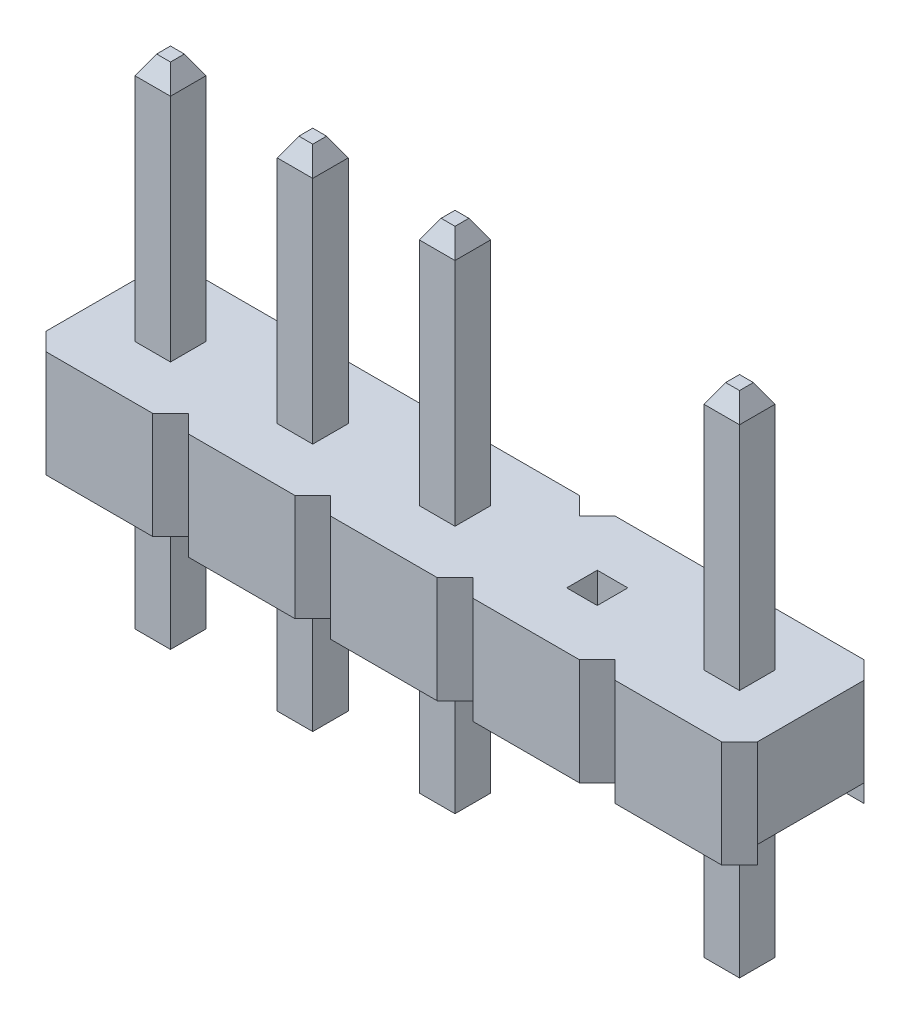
ISO-10303-21;
HEADER;
FILE_DESCRIPTION(('STEP AP214'),'2;1');
FILE_NAME('part.step','',(''),(''),'','','');
FILE_SCHEMA(('AUTOMOTIVE_DESIGN { 1 0 10303 214 1 1 1 1 }'));
ENDSEC;
DATA;
#1=APPLICATION_CONTEXT('core data for automotive mechanical design processes');
#2=APPLICATION_PROTOCOL_DEFINITION('international standard','automotive_design',2000,#1);
#3=PRODUCT_CONTEXT('',#1,'mechanical');
#4=PRODUCT('Part','Part','',(#3));
#5=PRODUCT_RELATED_PRODUCT_CATEGORY('part','',(#4));
#6=PRODUCT_DEFINITION_FORMATION('','',#4);
#7=PRODUCT_DEFINITION_CONTEXT('part definition',#1,'design');
#8=PRODUCT_DEFINITION('design','',#6,#7);
#9=PRODUCT_DEFINITION_SHAPE('','',#8);
#10=(LENGTH_UNIT() NAMED_UNIT(*) SI_UNIT(.MILLI.,.METRE.));
#11=(NAMED_UNIT(*) PLANE_ANGLE_UNIT() SI_UNIT($,.RADIAN.));
#12=(NAMED_UNIT(*) SI_UNIT($,.STERADIAN.) SOLID_ANGLE_UNIT());
#13=UNCERTAINTY_MEASURE_WITH_UNIT(LENGTH_MEASURE(1.E-05),#10,'distance_accuracy_value','');
#14=(GEOMETRIC_REPRESENTATION_CONTEXT(3) GLOBAL_UNCERTAINTY_ASSIGNED_CONTEXT((#13)) GLOBAL_UNIT_ASSIGNED_CONTEXT((#10,
#11,#12)) REPRESENTATION_CONTEXT('',''));
#15=CARTESIAN_POINT('',(0.,0.,0.));
#16=DIRECTION('',(0.,0.,1.));
#17=DIRECTION('',(1.,0.,0.));
#18=AXIS2_PLACEMENT_3D('',#15,#16,#17);
#19=CARTESIAN_POINT('',(10.25,3.5,-0.25));
#20=DIRECTION('',(1.,0.,0.));
#21=DIRECTION('',(0.,0.,-1.));
#22=AXIS2_PLACEMENT_3D('',#19,#20,#21);
#23=PLANE('',#22);
#24=DIRECTION('',(0.,0.,1.));
#25=VECTOR('',#24,1.);
#26=CARTESIAN_POINT('',(10.25,-3.5,-1.));
#27=LINE('',#26,#25);
#28=CARTESIAN_POINT('',(10.25,-3.5,-0.25));
#29=VERTEX_POINT('',#28);
#30=CARTESIAN_POINT('',(10.25,-3.5,0.25));
#31=VERTEX_POINT('',#30);
#32=EDGE_CURVE('P0_E165',#29,#31,#27,.T.);
#33=ORIENTED_EDGE('',*,*,#32,.F.);
#34=DIRECTION('',(0.,-1.,0.));
#35=VECTOR('',#34,1.);
#36=CARTESIAN_POINT('',(10.25,3.2358622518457,-0.25));
#37=LINE('',#36,#35);
#38=CARTESIAN_POINT('',(10.25,3.2358622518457,-0.25));
#39=VERTEX_POINT('',#38);
#40=EDGE_CURVE('P0_E71',#39,#29,#37,.T.);
#41=ORIENTED_EDGE('',*,*,#40,.F.);
#42=DIRECTION('',(0.,0.,1.));
#43=VECTOR('',#42,1.);
#44=CARTESIAN_POINT('',(10.25,3.2358622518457,-0.25));
#45=LINE('',#44,#43);
#46=CARTESIAN_POINT('',(10.25,3.2358622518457,0.25));
#47=VERTEX_POINT('',#46);
#48=EDGE_CURVE('P0_E149',#39,#47,#45,.T.);
#49=ORIENTED_EDGE('',*,*,#48,.T.);
#50=DIRECTION('',(0.,-1.,0.));
#51=VECTOR('',#50,1.);
#52=CARTESIAN_POINT('',(10.25,3.2358622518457,0.25));
#53=LINE('',#52,#51);
#54=EDGE_CURVE('P0_E56',#47,#31,#53,.T.);
#55=ORIENTED_EDGE('',*,*,#54,.T.);
#56=EDGE_LOOP('',(#33,#41,#49,#55));
#57=FACE_BOUND('',#56,.T.);
#58=ADVANCED_FACE('P0_F49',(#57),#23,.T.);
#59=CARTESIAN_POINT('',(10.25,3.5,0.25));
#60=DIRECTION('',(0.,0.,1.));
#61=DIRECTION('',(0.,-1.,0.));
#62=AXIS2_PLACEMENT_3D('',#59,#60,#61);
#63=PLANE('',#62);
#64=DIRECTION('',(-1.,0.,0.));
#65=VECTOR('',#64,1.);
#66=CARTESIAN_POINT('',(10.25,-3.5,0.25));
#67=LINE('',#66,#65);
#68=CARTESIAN_POINT('',(9.75,-3.5,0.25));
#69=VERTEX_POINT('',#68);
#70=EDGE_CURVE('P0_E142',#31,#69,#67,.T.);
#71=ORIENTED_EDGE('',*,*,#70,.F.);
#72=ORIENTED_EDGE('',*,*,#54,.F.);
#73=DIRECTION('',(-1.,0.,0.));
#74=VECTOR('',#73,1.);
#75=CARTESIAN_POINT('',(10.25,3.2358622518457,0.25));
#76=LINE('',#75,#74);
#77=CARTESIAN_POINT('',(9.75,3.2358622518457,0.25));
#78=VERTEX_POINT('',#77);
#79=EDGE_CURVE('P0_E131',#47,#78,#76,.T.);
#80=ORIENTED_EDGE('',*,*,#79,.T.);
#81=DIRECTION('',(0.,-1.,0.));
#82=VECTOR('',#81,1.);
#83=CARTESIAN_POINT('',(9.75,3.2358622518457,0.25));
#84=LINE('',#83,#82);
#85=EDGE_CURVE('P0_E94',#78,#69,#84,.T.);
#86=ORIENTED_EDGE('',*,*,#85,.T.);
#87=EDGE_LOOP('',(#71,#72,#80,#86));
#88=FACE_BOUND('',#87,.T.);
#89=ADVANCED_FACE('P0_F168',(#88),#63,.T.);
#90=CARTESIAN_POINT('',(9.75,3.5,0.25));
#91=DIRECTION('',(-1.,0.,0.));
#92=DIRECTION('',(0.,1.,0.));
#93=AXIS2_PLACEMENT_3D('',#90,#91,#92);
#94=PLANE('',#93);
#95=DIRECTION('',(0.,0.,-1.));
#96=VECTOR('',#95,1.);
#97=CARTESIAN_POINT('',(9.75,-3.5,0.25));
#98=LINE('',#97,#96);
#99=CARTESIAN_POINT('',(9.75,-3.5,-0.25));
#100=VERTEX_POINT('',#99);
#101=EDGE_CURVE('P0_E62',#69,#100,#98,.T.);
#102=ORIENTED_EDGE('',*,*,#101,.F.);
#103=ORIENTED_EDGE('',*,*,#85,.F.);
#104=DIRECTION('',(0.,0.,-1.));
#105=VECTOR('',#104,1.);
#106=CARTESIAN_POINT('',(9.75,3.2358622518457,0.25));
#107=LINE('',#106,#105);
#108=CARTESIAN_POINT('',(9.75,3.2358622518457,-0.25));
#109=VERTEX_POINT('',#108);
#110=EDGE_CURVE('P0_E114',#78,#109,#107,.T.);
#111=ORIENTED_EDGE('',*,*,#110,.T.);
#112=DIRECTION('',(0.,-1.,0.));
#113=VECTOR('',#112,1.);
#114=CARTESIAN_POINT('',(9.75,3.2358622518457,-0.25));
#115=LINE('',#114,#113);
#116=EDGE_CURVE('P0_E99',#109,#100,#115,.T.);
#117=ORIENTED_EDGE('',*,*,#116,.T.);
#118=EDGE_LOOP('',(#102,#103,#111,#117));
#119=FACE_BOUND('',#118,.T.);
#120=ADVANCED_FACE('P0_F115',(#119),#94,.T.);
#121=CARTESIAN_POINT('',(9.75,3.5,-0.25));
#122=DIRECTION('',(0.,0.,-1.));
#123=DIRECTION('',(-1.,0.,0.));
#124=AXIS2_PLACEMENT_3D('',#121,#122,#123);
#125=PLANE('',#124);
#126=DIRECTION('',(1.,0.,0.));
#127=VECTOR('',#126,1.);
#128=CARTESIAN_POINT('',(9.75,-3.5,-0.25));
#129=LINE('',#128,#127);
#130=EDGE_CURVE('P0_E12',#100,#29,#129,.T.);
#131=ORIENTED_EDGE('',*,*,#130,.F.);
#132=ORIENTED_EDGE('',*,*,#116,.F.);
#133=DIRECTION('',(1.,0.,0.));
#134=VECTOR('',#133,1.);
#135=CARTESIAN_POINT('',(9.75,3.2358622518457,-0.25));
#136=LINE('',#135,#134);
#137=EDGE_CURVE('P0_E102',#109,#39,#136,.T.);
#138=ORIENTED_EDGE('',*,*,#137,.T.);
#139=ORIENTED_EDGE('',*,*,#40,.T.);
#140=EDGE_LOOP('',(#131,#132,#138,#139));
#141=FACE_BOUND('',#140,.T.);
#142=ADVANCED_FACE('P0_F101',(#141),#125,.T.);
#143=CARTESIAN_POINT('',(9.75,3.5,-0.0975));
#144=DIRECTION('',(0.,0.500000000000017,-0.866025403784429));
#145=DIRECTION('',(-1.,0.,0.));
#146=AXIS2_PLACEMENT_3D('',#143,#144,#145);
#147=PLANE('',#146);
#148=DIRECTION('',(1.,0.,0.));
#149=VECTOR('',#148,1.);
#150=CARTESIAN_POINT('',(9.9025,3.5,-0.0975));
#151=LINE('',#150,#149);
#152=CARTESIAN_POINT('',(9.9025,3.5,-0.0975));
#153=VERTEX_POINT('',#152);
#154=CARTESIAN_POINT('',(10.0975,3.5,-0.0975));
#155=VERTEX_POINT('',#154);
#156=EDGE_CURVE('P0_E123',#153,#155,#151,.T.);
#157=ORIENTED_EDGE('',*,*,#156,.T.);
#158=DIRECTION('',(0.447213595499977,-0.774596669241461,-0.447213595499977));
#159=VECTOR('',#158,1.);
#160=CARTESIAN_POINT('',(10.0975,3.5,-0.0975));
#161=LINE('',#160,#159);
#162=EDGE_CURVE('P0_E111',#155,#39,#161,.T.);
#163=ORIENTED_EDGE('',*,*,#162,.T.);
#164=ORIENTED_EDGE('',*,*,#137,.F.);
#165=DIRECTION('',(-0.447213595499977,-0.774596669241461,-0.447213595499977));
#166=VECTOR('',#165,1.);
#167=CARTESIAN_POINT('',(9.9025,3.5,-0.0975));
#168=LINE('',#167,#166);
#169=EDGE_CURVE('P0_E109',#153,#109,#168,.T.);
#170=ORIENTED_EDGE('',*,*,#169,.F.);
#171=EDGE_LOOP('',(#157,#163,#164,#170));
#172=FACE_BOUND('',#171,.T.);
#173=ADVANCED_FACE('P0_F107',(#172),#147,.T.);
#174=CARTESIAN_POINT('',(10.0975,3.5,-0.25));
#175=DIRECTION('',(0.866025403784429,0.500000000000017,0.));
#176=DIRECTION('',(0.,0.,-1.));
#177=AXIS2_PLACEMENT_3D('',#174,#175,#176);
#178=PLANE('',#177);
#179=DIRECTION('',(0.,0.,1.));
#180=VECTOR('',#179,1.);
#181=CARTESIAN_POINT('',(10.0975,3.5,-0.0975));
#182=LINE('',#181,#180);
#183=CARTESIAN_POINT('',(10.0975,3.5,0.0975));
#184=VERTEX_POINT('',#183);
#185=EDGE_CURVE('P0_E125',#155,#184,#182,.T.);
#186=ORIENTED_EDGE('',*,*,#185,.T.);
#187=DIRECTION('',(0.447213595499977,-0.774596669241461,0.447213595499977));
#188=VECTOR('',#187,1.);
#189=CARTESIAN_POINT('',(10.0975,3.5,0.0975));
#190=LINE('',#189,#188);
#191=EDGE_CURVE('P0_E146',#184,#47,#190,.T.);
#192=ORIENTED_EDGE('',*,*,#191,.T.);
#193=ORIENTED_EDGE('',*,*,#48,.F.);
#194=ORIENTED_EDGE('',*,*,#162,.F.);
#195=EDGE_LOOP('',(#186,#192,#193,#194));
#196=FACE_BOUND('',#195,.T.);
#197=ADVANCED_FACE('P0_F169',(#196),#178,.T.);
#198=CARTESIAN_POINT('',(10.25,3.5,0.0975));
#199=DIRECTION('',(0.,0.500000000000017,0.866025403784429));
#200=DIRECTION('',(1.,0.,0.));
#201=AXIS2_PLACEMENT_3D('',#198,#199,#200);
#202=PLANE('',#201);
#203=DIRECTION('',(-1.,0.,0.));
#204=VECTOR('',#203,1.);
#205=CARTESIAN_POINT('',(10.0975,3.5,0.0975));
#206=LINE('',#205,#204);
#207=CARTESIAN_POINT('',(9.9025,3.5,0.0975));
#208=VERTEX_POINT('',#207);
#209=EDGE_CURVE('P0_E133',#184,#208,#206,.T.);
#210=ORIENTED_EDGE('',*,*,#209,.T.);
#211=DIRECTION('',(-0.447213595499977,-0.774596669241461,0.447213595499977));
#212=VECTOR('',#211,1.);
#213=CARTESIAN_POINT('',(9.9025,3.5,0.0975));
#214=LINE('',#213,#212);
#215=EDGE_CURVE('P0_E117',#208,#78,#214,.T.);
#216=ORIENTED_EDGE('',*,*,#215,.T.);
#217=ORIENTED_EDGE('',*,*,#79,.F.);
#218=ORIENTED_EDGE('',*,*,#191,.F.);
#219=EDGE_LOOP('',(#210,#216,#217,#218));
#220=FACE_BOUND('',#219,.T.);
#221=ADVANCED_FACE('P0_F157',(#220),#202,.T.);
#222=CARTESIAN_POINT('',(9.9025,3.5,0.25));
#223=DIRECTION('',(-0.866025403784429,0.500000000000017,0.));
#224=DIRECTION('',(0.,0.,1.));
#225=AXIS2_PLACEMENT_3D('',#222,#223,#224);
#226=PLANE('',#225);
#227=DIRECTION('',(0.,0.,-1.));
#228=VECTOR('',#227,1.);
#229=CARTESIAN_POINT('',(9.9025,3.5,0.0975));
#230=LINE('',#229,#228);
#231=EDGE_CURVE('P0_E122',#208,#153,#230,.T.);
#232=ORIENTED_EDGE('',*,*,#231,.T.);
#233=ORIENTED_EDGE('',*,*,#169,.T.);
#234=ORIENTED_EDGE('',*,*,#110,.F.);
#235=ORIENTED_EDGE('',*,*,#215,.F.);
#236=EDGE_LOOP('',(#232,#233,#234,#235));
#237=FACE_BOUND('',#236,.T.);
#238=ADVANCED_FACE('P0_F120',(#237),#226,.T.);
#239=CARTESIAN_POINT('',(10.,3.5,0.));
#240=DIRECTION('',(0.,-1.,0.));
#241=DIRECTION('',(0.,0.,1.));
#242=AXIS2_PLACEMENT_3D('',#239,#240,#241);
#243=PLANE('',#242);
#244=ORIENTED_EDGE('',*,*,#231,.F.);
#245=ORIENTED_EDGE('',*,*,#209,.F.);
#246=ORIENTED_EDGE('',*,*,#185,.F.);
#247=ORIENTED_EDGE('',*,*,#156,.F.);
#248=EDGE_LOOP('',(#244,#245,#246,#247));
#249=FACE_BOUND('',#248,.T.);
#250=ADVANCED_FACE('P0_F171',(#249),#243,.F.);
#251=CARTESIAN_POINT('',(1.75,-3.5,-1.));
#252=DIRECTION('',(0.,1.,0.));
#253=DIRECTION('',(-1.,0.,0.));
#254=AXIS2_PLACEMENT_3D('',#251,#252,#253);
#255=PLANE('',#254);
#256=ORIENTED_EDGE('',*,*,#70,.T.);
#257=ORIENTED_EDGE('',*,*,#101,.T.);
#258=ORIENTED_EDGE('',*,*,#130,.T.);
#259=ORIENTED_EDGE('',*,*,#32,.T.);
#260=EDGE_LOOP('',(#256,#257,#258,#259));
#261=FACE_BOUND('',#260,.T.);
#262=ADVANCED_FACE('P0_F167',(#261),#255,.F.);
#263=CLOSED_SHELL('',(#58,#89,#120,#142,#173,#197,#221,#238,#250,#262));
#264=MANIFOLD_SOLID_BREP('P0_B2',#263);
#265=CARTESIAN_POINT('',(6.25,3.5,-0.25));
#266=DIRECTION('',(1.,0.,0.));
#267=DIRECTION('',(0.,0.,-1.));
#268=AXIS2_PLACEMENT_3D('',#265,#266,#267);
#269=PLANE('',#268);
#270=DIRECTION('',(0.,0.,1.));
#271=VECTOR('',#270,1.);
#272=CARTESIAN_POINT('',(6.25,-3.5,-0.25));
#273=LINE('',#272,#271);
#274=CARTESIAN_POINT('',(6.25,-3.5,-0.25));
#275=VERTEX_POINT('',#274);
#276=CARTESIAN_POINT('',(6.25,-3.5,0.25));
#277=VERTEX_POINT('',#276);
#278=EDGE_CURVE('P0_E363',#275,#277,#273,.T.);
#279=ORIENTED_EDGE('',*,*,#278,.F.);
#280=DIRECTION('',(0.,-1.,0.));
#281=VECTOR('',#280,1.);
#282=CARTESIAN_POINT('',(6.25,3.2358622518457,-0.25));
#283=LINE('',#282,#281);
#284=CARTESIAN_POINT('',(6.25,3.2358622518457,-0.25));
#285=VERTEX_POINT('',#284);
#286=EDGE_CURVE('P0_E287',#285,#275,#283,.T.);
#287=ORIENTED_EDGE('',*,*,#286,.F.);
#288=DIRECTION('',(0.,0.,1.));
#289=VECTOR('',#288,1.);
#290=CARTESIAN_POINT('',(6.25,3.2358622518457,-0.25));
#291=LINE('',#290,#289);
#292=CARTESIAN_POINT('',(6.25,3.2358622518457,0.25));
#293=VERTEX_POINT('',#292);
#294=EDGE_CURVE('P0_E324',#285,#293,#291,.T.);
#295=ORIENTED_EDGE('',*,*,#294,.T.);
#296=DIRECTION('',(0.,-1.,0.));
#297=VECTOR('',#296,1.);
#298=CARTESIAN_POINT('',(6.25,3.2358622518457,0.25));
#299=LINE('',#298,#297);
#300=EDGE_CURVE('P0_E272',#293,#277,#299,.T.);
#301=ORIENTED_EDGE('',*,*,#300,.T.);
#302=EDGE_LOOP('',(#279,#287,#295,#301));
#303=FACE_BOUND('',#302,.T.);
#304=ADVANCED_FACE('P0_F264',(#303),#269,.T.);
#305=CARTESIAN_POINT('',(6.25,3.5,0.25));
#306=DIRECTION('',(0.,0.,1.));
#307=DIRECTION('',(0.,-1.,0.));
#308=AXIS2_PLACEMENT_3D('',#305,#306,#307);
#309=PLANE('',#308);
#310=DIRECTION('',(-1.,0.,0.));
#311=VECTOR('',#310,1.);
#312=CARTESIAN_POINT('',(6.25,-3.5,0.25));
#313=LINE('',#312,#311);
#314=CARTESIAN_POINT('',(5.75,-3.5,0.25));
#315=VERTEX_POINT('',#314);
#316=EDGE_CURVE('P0_E371',#277,#315,#313,.T.);
#317=ORIENTED_EDGE('',*,*,#316,.F.);
#318=ORIENTED_EDGE('',*,*,#300,.F.);
#319=DIRECTION('',(-1.,0.,0.));
#320=VECTOR('',#319,1.);
#321=CARTESIAN_POINT('',(6.25,3.2358622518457,0.25));
#322=LINE('',#321,#320);
#323=CARTESIAN_POINT('',(5.75,3.2358622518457,0.25));
#324=VERTEX_POINT('',#323);
#325=EDGE_CURVE('P0_E353',#293,#324,#322,.T.);
#326=ORIENTED_EDGE('',*,*,#325,.T.);
#327=DIRECTION('',(0.,-1.,0.));
#328=VECTOR('',#327,1.);
#329=CARTESIAN_POINT('',(5.75,3.2358622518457,0.25));
#330=LINE('',#329,#328);
#331=EDGE_CURVE('P0_E345',#324,#315,#330,.T.);
#332=ORIENTED_EDGE('',*,*,#331,.T.);
#333=EDGE_LOOP('',(#317,#318,#326,#332));
#334=FACE_BOUND('',#333,.T.);
#335=ADVANCED_FACE('P0_F369',(#334),#309,.T.);
#336=CARTESIAN_POINT('',(5.75,3.5,0.25));
#337=DIRECTION('',(-1.,0.,0.));
#338=DIRECTION('',(0.,1.,0.));
#339=AXIS2_PLACEMENT_3D('',#336,#337,#338);
#340=PLANE('',#339);
#341=DIRECTION('',(0.,0.,-1.));
#342=VECTOR('',#341,1.);
#343=CARTESIAN_POINT('',(5.75,-3.5,0.25));
#344=LINE('',#343,#342);
#345=CARTESIAN_POINT('',(5.75,-3.5,-0.25));
#346=VERTEX_POINT('',#345);
#347=EDGE_CURVE('P0_E278',#315,#346,#344,.T.);
#348=ORIENTED_EDGE('',*,*,#347,.F.);
#349=ORIENTED_EDGE('',*,*,#331,.F.);
#350=DIRECTION('',(0.,0.,-1.));
#351=VECTOR('',#350,1.);
#352=CARTESIAN_POINT('',(5.75,3.2358622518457,0.25));
#353=LINE('',#352,#351);
#354=CARTESIAN_POINT('',(5.75,3.2358622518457,-0.25));
#355=VERTEX_POINT('',#354);
#356=EDGE_CURVE('P0_E349',#324,#355,#353,.T.);
#357=ORIENTED_EDGE('',*,*,#356,.T.);
#358=DIRECTION('',(0.,-1.,0.));
#359=VECTOR('',#358,1.);
#360=CARTESIAN_POINT('',(5.75,3.2358622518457,-0.25));
#361=LINE('',#360,#359);
#362=EDGE_CURVE('P0_E348',#355,#346,#361,.T.);
#363=ORIENTED_EDGE('',*,*,#362,.T.);
#364=EDGE_LOOP('',(#348,#349,#357,#363));
#365=FACE_BOUND('',#364,.T.);
#366=ADVANCED_FACE('P0_F380',(#365),#340,.T.);
#367=CARTESIAN_POINT('',(5.75,3.5,-0.25));
#368=DIRECTION('',(0.,0.,-1.));
#369=DIRECTION('',(-1.,0.,0.));
#370=AXIS2_PLACEMENT_3D('',#367,#368,#369);
#371=PLANE('',#370);
#372=DIRECTION('',(1.,0.,0.));
#373=VECTOR('',#372,1.);
#374=CARTESIAN_POINT('',(5.75,-3.5,-0.25));
#375=LINE('',#374,#373);
#376=EDGE_CURVE('P0_E47',#346,#275,#375,.T.);
#377=ORIENTED_EDGE('',*,*,#376,.F.);
#378=ORIENTED_EDGE('',*,*,#362,.F.);
#379=DIRECTION('',(1.,0.,0.));
#380=VECTOR('',#379,1.);
#381=CARTESIAN_POINT('',(5.75,3.2358622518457,-0.25));
#382=LINE('',#381,#380);
#383=EDGE_CURVE('P0_E327',#355,#285,#382,.T.);
#384=ORIENTED_EDGE('',*,*,#383,.T.);
#385=ORIENTED_EDGE('',*,*,#286,.T.);
#386=EDGE_LOOP('',(#377,#378,#384,#385));
#387=FACE_BOUND('',#386,.T.);
#388=ADVANCED_FACE('P0_F382',(#387),#371,.T.);
#389=CARTESIAN_POINT('',(5.75,3.5,-0.0975));
#390=DIRECTION('',(0.,0.500000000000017,-0.866025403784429));
#391=DIRECTION('',(-1.,0.,0.));
#392=AXIS2_PLACEMENT_3D('',#389,#390,#391);
#393=PLANE('',#392);
#394=DIRECTION('',(1.,0.,0.));
#395=VECTOR('',#394,1.);
#396=CARTESIAN_POINT('',(5.9025,3.5,-0.0975));
#397=LINE('',#396,#395);
#398=CARTESIAN_POINT('',(5.9025,3.5,-0.0975));
#399=VERTEX_POINT('',#398);
#400=CARTESIAN_POINT('',(6.0975,3.5,-0.0975));
#401=VERTEX_POINT('',#400);
#402=EDGE_CURVE('P0_E330',#399,#401,#397,.T.);
#403=ORIENTED_EDGE('',*,*,#402,.T.);
#404=DIRECTION('',(0.447213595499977,-0.774596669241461,-0.447213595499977));
#405=VECTOR('',#404,1.);
#406=CARTESIAN_POINT('',(6.0975,3.5,-0.0975));
#407=LINE('',#406,#405);
#408=EDGE_CURVE('P0_E318',#401,#285,#407,.T.);
#409=ORIENTED_EDGE('',*,*,#408,.T.);
#410=ORIENTED_EDGE('',*,*,#383,.F.);
#411=DIRECTION('',(-0.447213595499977,-0.774596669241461,-0.447213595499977));
#412=VECTOR('',#411,1.);
#413=CARTESIAN_POINT('',(5.9025,3.5,-0.0975));
#414=LINE('',#413,#412);
#415=EDGE_CURVE('P0_E333',#399,#355,#414,.T.);
#416=ORIENTED_EDGE('',*,*,#415,.F.);
#417=EDGE_LOOP('',(#403,#409,#410,#416));
#418=FACE_BOUND('',#417,.T.);
#419=ADVANCED_FACE('P0_F331',(#418),#393,.T.);
#420=CARTESIAN_POINT('',(6.0975,3.5,-0.25));
#421=DIRECTION('',(0.866025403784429,0.500000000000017,0.));
#422=DIRECTION('',(0.,0.,-1.));
#423=AXIS2_PLACEMENT_3D('',#420,#421,#422);
#424=PLANE('',#423);
#425=DIRECTION('',(0.,0.,1.));
#426=VECTOR('',#425,1.);
#427=CARTESIAN_POINT('',(6.0975,3.5,-0.0975));
#428=LINE('',#427,#426);
#429=CARTESIAN_POINT('',(6.0975,3.5,0.0975));
#430=VERTEX_POINT('',#429);
#431=EDGE_CURVE('P0_E322',#401,#430,#428,.T.);
#432=ORIENTED_EDGE('',*,*,#431,.T.);
#433=DIRECTION('',(0.447213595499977,-0.774596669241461,0.447213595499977));
#434=VECTOR('',#433,1.);
#435=CARTESIAN_POINT('',(6.0975,3.5,0.0975));
#436=LINE('',#435,#434);
#437=EDGE_CURVE('P0_E312',#430,#293,#436,.T.);
#438=ORIENTED_EDGE('',*,*,#437,.T.);
#439=ORIENTED_EDGE('',*,*,#294,.F.);
#440=ORIENTED_EDGE('',*,*,#408,.F.);
#441=EDGE_LOOP('',(#432,#438,#439,#440));
#442=FACE_BOUND('',#441,.T.);
#443=ADVANCED_FACE('P0_F320',(#442),#424,.T.);
#444=CARTESIAN_POINT('',(6.25,3.5,0.0975));
#445=DIRECTION('',(0.,0.500000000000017,0.866025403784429));
#446=DIRECTION('',(1.,0.,0.));
#447=AXIS2_PLACEMENT_3D('',#444,#445,#446);
#448=PLANE('',#447);
#449=DIRECTION('',(-1.,0.,0.));
#450=VECTOR('',#449,1.);
#451=CARTESIAN_POINT('',(6.0975,3.5,0.0975));
#452=LINE('',#451,#450);
#453=CARTESIAN_POINT('',(5.9025,3.5,0.0975));
#454=VERTEX_POINT('',#453);
#455=EDGE_CURVE('P0_E338',#430,#454,#452,.T.);
#456=ORIENTED_EDGE('',*,*,#455,.T.);
#457=DIRECTION('',(-0.447213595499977,-0.774596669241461,0.447213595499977));
#458=VECTOR('',#457,1.);
#459=CARTESIAN_POINT('',(5.9025,3.5,0.0975));
#460=LINE('',#459,#458);
#461=EDGE_CURVE('P0_E352',#454,#324,#460,.T.);
#462=ORIENTED_EDGE('',*,*,#461,.T.);
#463=ORIENTED_EDGE('',*,*,#325,.F.);
#464=ORIENTED_EDGE('',*,*,#437,.F.);
#465=EDGE_LOOP('',(#456,#462,#463,#464));
#466=FACE_BOUND('',#465,.T.);
#467=ADVANCED_FACE('P0_F365',(#466),#448,.T.);
#468=CARTESIAN_POINT('',(5.9025,3.5,0.25));
#469=DIRECTION('',(-0.866025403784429,0.500000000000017,0.));
#470=DIRECTION('',(0.,0.,1.));
#471=AXIS2_PLACEMENT_3D('',#468,#469,#470);
#472=PLANE('',#471);
#473=DIRECTION('',(0.,0.,-1.));
#474=VECTOR('',#473,1.);
#475=CARTESIAN_POINT('',(5.9025,3.5,0.0975));
#476=LINE('',#475,#474);
#477=EDGE_CURVE('P0_E340',#454,#399,#476,.T.);
#478=ORIENTED_EDGE('',*,*,#477,.T.);
#479=ORIENTED_EDGE('',*,*,#415,.T.);
#480=ORIENTED_EDGE('',*,*,#356,.F.);
#481=ORIENTED_EDGE('',*,*,#461,.F.);
#482=EDGE_LOOP('',(#478,#479,#480,#481));
#483=FACE_BOUND('',#482,.T.);
#484=ADVANCED_FACE('P0_F402',(#483),#472,.T.);
#485=CARTESIAN_POINT('',(6.,3.5,0.));
#486=DIRECTION('',(0.,-1.,0.));
#487=DIRECTION('',(0.,0.,1.));
#488=AXIS2_PLACEMENT_3D('',#485,#486,#487);
#489=PLANE('',#488);
#490=ORIENTED_EDGE('',*,*,#477,.F.);
#491=ORIENTED_EDGE('',*,*,#455,.F.);
#492=ORIENTED_EDGE('',*,*,#431,.F.);
#493=ORIENTED_EDGE('',*,*,#402,.F.);
#494=EDGE_LOOP('',(#490,#491,#492,#493));
#495=FACE_BOUND('',#494,.T.);
#496=ADVANCED_FACE('P0_F266',(#495),#489,.F.);
#497=CARTESIAN_POINT('',(1.75,-3.5,-1.));
#498=DIRECTION('',(0.,1.,0.));
#499=DIRECTION('',(-1.,0.,0.));
#500=AXIS2_PLACEMENT_3D('',#497,#498,#499);
#501=PLANE('',#500);
#502=ORIENTED_EDGE('',*,*,#278,.T.);
#503=ORIENTED_EDGE('',*,*,#316,.T.);
#504=ORIENTED_EDGE('',*,*,#347,.T.);
#505=ORIENTED_EDGE('',*,*,#376,.T.);
#506=EDGE_LOOP('',(#502,#503,#504,#505));
#507=FACE_BOUND('',#506,.T.);
#508=ADVANCED_FACE('P0_F376',(#507),#501,.F.);
#509=CLOSED_SHELL('',(#304,#335,#366,#388,#419,#443,#467,#484,#496,#508));
#510=MANIFOLD_SOLID_BREP('P0_B6',#509);
#511=CARTESIAN_POINT('',(4.25,3.5,-0.25));
#512=DIRECTION('',(1.,0.,0.));
#513=DIRECTION('',(0.,0.,-1.));
#514=AXIS2_PLACEMENT_3D('',#511,#512,#513);
#515=PLANE('',#514);
#516=DIRECTION('',(0.,0.,1.));
#517=VECTOR('',#516,1.);
#518=CARTESIAN_POINT('',(4.25,-3.5,-0.25));
#519=LINE('',#518,#517);
#520=CARTESIAN_POINT('',(4.25,-3.5,-0.25));
#521=VERTEX_POINT('',#520);
#522=CARTESIAN_POINT('',(4.25,-3.5,0.25));
#523=VERTEX_POINT('',#522);
#524=EDGE_CURVE('P0_E530',#521,#523,#519,.T.);
#525=ORIENTED_EDGE('',*,*,#524,.F.);
#526=DIRECTION('',(0.,-1.,0.));
#527=VECTOR('',#526,1.);
#528=CARTESIAN_POINT('',(4.25,3.2358622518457,-0.25));
#529=LINE('',#528,#527);
#530=CARTESIAN_POINT('',(4.25,3.2358622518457,-0.25));
#531=VERTEX_POINT('',#530);
#532=EDGE_CURVE('P0_E500',#531,#521,#529,.T.);
#533=ORIENTED_EDGE('',*,*,#532,.F.);
#534=DIRECTION('',(0.,0.,1.));
#535=VECTOR('',#534,1.);
#536=CARTESIAN_POINT('',(4.25,3.2358622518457,-0.25));
#537=LINE('',#536,#535);
#538=CARTESIAN_POINT('',(4.25,3.2358622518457,0.25));
#539=VERTEX_POINT('',#538);
#540=EDGE_CURVE('P0_E556',#531,#539,#537,.T.);
#541=ORIENTED_EDGE('',*,*,#540,.T.);
#542=DIRECTION('',(0.,-1.,0.));
#543=VECTOR('',#542,1.);
#544=CARTESIAN_POINT('',(4.25,3.2358622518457,0.25));
#545=LINE('',#544,#543);
#546=EDGE_CURVE('P0_E486',#539,#523,#545,.T.);
#547=ORIENTED_EDGE('',*,*,#546,.T.);
#548=EDGE_LOOP('',(#525,#533,#541,#547));
#549=FACE_BOUND('',#548,.T.);
#550=ADVANCED_FACE('P0_F478',(#549),#515,.T.);
#551=CARTESIAN_POINT('',(4.25,3.5,0.25));
#552=DIRECTION('',(0.,0.,1.));
#553=DIRECTION('',(0.,-1.,0.));
#554=AXIS2_PLACEMENT_3D('',#551,#552,#553);
#555=PLANE('',#554);
#556=DIRECTION('',(-1.,0.,0.));
#557=VECTOR('',#556,1.);
#558=CARTESIAN_POINT('',(4.25,-3.5,0.25));
#559=LINE('',#558,#557);
#560=CARTESIAN_POINT('',(3.75,-3.5,0.25));
#561=VERTEX_POINT('',#560);
#562=EDGE_CURVE('P0_E536',#523,#561,#559,.T.);
#563=ORIENTED_EDGE('',*,*,#562,.F.);
#564=ORIENTED_EDGE('',*,*,#546,.F.);
#565=DIRECTION('',(-1.,0.,0.));
#566=VECTOR('',#565,1.);
#567=CARTESIAN_POINT('',(4.25,3.2358622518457,0.25));
#568=LINE('',#567,#566);
#569=CARTESIAN_POINT('',(3.75,3.2358622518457,0.25));
#570=VERTEX_POINT('',#569);
#571=EDGE_CURVE('P0_E557',#539,#570,#568,.T.);
#572=ORIENTED_EDGE('',*,*,#571,.T.);
#573=DIRECTION('',(0.,-1.,0.));
#574=VECTOR('',#573,1.);
#575=CARTESIAN_POINT('',(3.75,3.2358622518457,0.25));
#576=LINE('',#575,#574);
#577=EDGE_CURVE('P0_E544',#570,#561,#576,.T.);
#578=ORIENTED_EDGE('',*,*,#577,.T.);
#579=EDGE_LOOP('',(#563,#564,#572,#578));
#580=FACE_BOUND('',#579,.T.);
#581=ADVANCED_FACE('P0_F578',(#580),#555,.T.);
#582=CARTESIAN_POINT('',(3.75,3.5,0.25));
#583=DIRECTION('',(-1.,0.,0.));
#584=DIRECTION('',(0.,1.,0.));
#585=AXIS2_PLACEMENT_3D('',#582,#583,#584);
#586=PLANE('',#585);
#587=DIRECTION('',(0.,0.,-1.));
#588=VECTOR('',#587,1.);
#589=CARTESIAN_POINT('',(3.75,-3.5,0.25));
#590=LINE('',#589,#588);
#591=CARTESIAN_POINT('',(3.75,-3.5,-0.25));
#592=VERTEX_POINT('',#591);
#593=EDGE_CURVE('P0_E492',#561,#592,#590,.T.);
#594=ORIENTED_EDGE('',*,*,#593,.F.);
#595=ORIENTED_EDGE('',*,*,#577,.F.);
#596=DIRECTION('',(0.,0.,-1.));
#597=VECTOR('',#596,1.);
#598=CARTESIAN_POINT('',(3.75,3.2358622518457,0.25));
#599=LINE('',#598,#597);
#600=CARTESIAN_POINT('',(3.75,3.2358622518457,-0.25));
#601=VERTEX_POINT('',#600);
#602=EDGE_CURVE('P0_E560',#570,#601,#599,.T.);
#603=ORIENTED_EDGE('',*,*,#602,.T.);
#604=DIRECTION('',(0.,-1.,0.));
#605=VECTOR('',#604,1.);
#606=CARTESIAN_POINT('',(3.75,3.2358622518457,-0.25));
#607=LINE('',#606,#605);
#608=EDGE_CURVE('P0_E542',#601,#592,#607,.T.);
#609=ORIENTED_EDGE('',*,*,#608,.T.);
#610=EDGE_LOOP('',(#594,#595,#603,#609));
#611=FACE_BOUND('',#610,.T.);
#612=ADVANCED_FACE('P0_F592',(#611),#586,.T.);
#613=CARTESIAN_POINT('',(3.75,3.5,-0.25));
#614=DIRECTION('',(0.,0.,-1.));
#615=DIRECTION('',(-1.,0.,0.));
#616=AXIS2_PLACEMENT_3D('',#613,#614,#615);
#617=PLANE('',#616);
#618=DIRECTION('',(1.,0.,0.));
#619=VECTOR('',#618,1.);
#620=CARTESIAN_POINT('',(3.75,-3.5,-0.25));
#621=LINE('',#620,#619);
#622=EDGE_CURVE('P0_E262',#592,#521,#621,.T.);
#623=ORIENTED_EDGE('',*,*,#622,.F.);
#624=ORIENTED_EDGE('',*,*,#608,.F.);
#625=DIRECTION('',(1.,0.,0.));
#626=VECTOR('',#625,1.);
#627=CARTESIAN_POINT('',(3.75,3.2358622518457,-0.25));
#628=LINE('',#627,#626);
#629=EDGE_CURVE('P0_E540',#601,#531,#628,.T.);
#630=ORIENTED_EDGE('',*,*,#629,.T.);
#631=ORIENTED_EDGE('',*,*,#532,.T.);
#632=EDGE_LOOP('',(#623,#624,#630,#631));
#633=FACE_BOUND('',#632,.T.);
#634=ADVANCED_FACE('P0_F538',(#633),#617,.T.);
#635=CARTESIAN_POINT('',(3.75,3.5,-0.0975));
#636=DIRECTION('',(0.,0.500000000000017,-0.866025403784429));
#637=DIRECTION('',(-1.,0.,0.));
#638=AXIS2_PLACEMENT_3D('',#635,#636,#637);
#639=PLANE('',#638);
#640=DIRECTION('',(1.,0.,0.));
#641=VECTOR('',#640,1.);
#642=CARTESIAN_POINT('',(3.9025,3.5,-0.0975));
#643=LINE('',#642,#641);
#644=CARTESIAN_POINT('',(3.9025,3.5,-0.0975));
#645=VERTEX_POINT('',#644);
#646=CARTESIAN_POINT('',(4.0975,3.5,-0.0975));
#647=VERTEX_POINT('',#646);
#648=EDGE_CURVE('P0_E561',#645,#647,#643,.T.);
#649=ORIENTED_EDGE('',*,*,#648,.T.);
#650=DIRECTION('',(0.447213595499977,-0.774596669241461,-0.447213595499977));
#651=VECTOR('',#650,1.);
#652=CARTESIAN_POINT('',(4.0975,3.5,-0.0975));
#653=LINE('',#652,#651);
#654=EDGE_CURVE('P0_E546',#647,#531,#653,.T.);
#655=ORIENTED_EDGE('',*,*,#654,.T.);
#656=ORIENTED_EDGE('',*,*,#629,.F.);
#657=DIRECTION('',(-0.447213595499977,-0.774596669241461,-0.447213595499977));
#658=VECTOR('',#657,1.);
#659=CARTESIAN_POINT('',(3.9025,3.5,-0.0975));
#660=LINE('',#659,#658);
#661=EDGE_CURVE('P0_E558',#645,#601,#660,.T.);
#662=ORIENTED_EDGE('',*,*,#661,.F.);
#663=EDGE_LOOP('',(#649,#655,#656,#662));
#664=FACE_BOUND('',#663,.T.);
#665=ADVANCED_FACE('P0_F480',(#664),#639,.T.);
#666=CARTESIAN_POINT('',(4.0975,3.5,-0.25));
#667=DIRECTION('',(0.866025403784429,0.500000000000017,0.));
#668=DIRECTION('',(0.,0.,-1.));
#669=AXIS2_PLACEMENT_3D('',#666,#667,#668);
#670=PLANE('',#669);
#671=DIRECTION('',(0.,0.,1.));
#672=VECTOR('',#671,1.);
#673=CARTESIAN_POINT('',(4.0975,3.5,-0.0975));
#674=LINE('',#673,#672);
#675=CARTESIAN_POINT('',(4.0975,3.5,0.0975));
#676=VERTEX_POINT('',#675);
#677=EDGE_CURVE('P0_E565',#647,#676,#674,.T.);
#678=ORIENTED_EDGE('',*,*,#677,.T.);
#679=DIRECTION('',(0.447213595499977,-0.774596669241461,0.447213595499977));
#680=VECTOR('',#679,1.);
#681=CARTESIAN_POINT('',(4.0975,3.5,0.0975));
#682=LINE('',#681,#680);
#683=EDGE_CURVE('P0_E553',#676,#539,#682,.T.);
#684=ORIENTED_EDGE('',*,*,#683,.T.);
#685=ORIENTED_EDGE('',*,*,#540,.F.);
#686=ORIENTED_EDGE('',*,*,#654,.F.);
#687=EDGE_LOOP('',(#678,#684,#685,#686));
#688=FACE_BOUND('',#687,.T.);
#689=ADVANCED_FACE('P0_F598',(#688),#670,.T.);
#690=CARTESIAN_POINT('',(4.25,3.5,0.0975));
#691=DIRECTION('',(0.,0.500000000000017,0.866025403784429));
#692=DIRECTION('',(1.,0.,0.));
#693=AXIS2_PLACEMENT_3D('',#690,#691,#692);
#694=PLANE('',#693);
#695=DIRECTION('',(-1.,0.,0.));
#696=VECTOR('',#695,1.);
#697=CARTESIAN_POINT('',(4.0975,3.5,0.0975));
#698=LINE('',#697,#696);
#699=CARTESIAN_POINT('',(3.9025,3.5,0.0975));
#700=VERTEX_POINT('',#699);
#701=EDGE_CURVE('P0_E563',#676,#700,#698,.T.);
#702=ORIENTED_EDGE('',*,*,#701,.T.);
#703=DIRECTION('',(-0.447213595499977,-0.774596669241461,0.447213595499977));
#704=VECTOR('',#703,1.);
#705=CARTESIAN_POINT('',(3.9025,3.5,0.0975));
#706=LINE('',#705,#704);
#707=EDGE_CURVE('P0_E573',#700,#570,#706,.T.);
#708=ORIENTED_EDGE('',*,*,#707,.T.);
#709=ORIENTED_EDGE('',*,*,#571,.F.);
#710=ORIENTED_EDGE('',*,*,#683,.F.);
#711=EDGE_LOOP('',(#702,#708,#709,#710));
#712=FACE_BOUND('',#711,.T.);
#713=ADVANCED_FACE('P0_F581',(#712),#694,.T.);
#714=CARTESIAN_POINT('',(3.9025,3.5,0.25));
#715=DIRECTION('',(-0.866025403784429,0.500000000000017,0.));
#716=DIRECTION('',(0.,0.,1.));
#717=AXIS2_PLACEMENT_3D('',#714,#715,#716);
#718=PLANE('',#717);
#719=DIRECTION('',(0.,0.,-1.));
#720=VECTOR('',#719,1.);
#721=CARTESIAN_POINT('',(3.9025,3.5,0.0975));
#722=LINE('',#721,#720);
#723=EDGE_CURVE('P0_E535',#700,#645,#722,.T.);
#724=ORIENTED_EDGE('',*,*,#723,.T.);
#725=ORIENTED_EDGE('',*,*,#661,.T.);
#726=ORIENTED_EDGE('',*,*,#602,.F.);
#727=ORIENTED_EDGE('',*,*,#707,.F.);
#728=EDGE_LOOP('',(#724,#725,#726,#727));
#729=FACE_BOUND('',#728,.T.);
#730=ADVANCED_FACE('P0_F587',(#729),#718,.T.);
#731=CARTESIAN_POINT('',(4.,3.5,0.));
#732=DIRECTION('',(0.,-1.,0.));
#733=DIRECTION('',(0.,0.,1.));
#734=AXIS2_PLACEMENT_3D('',#731,#732,#733);
#735=PLANE('',#734);
#736=ORIENTED_EDGE('',*,*,#723,.F.);
#737=ORIENTED_EDGE('',*,*,#701,.F.);
#738=ORIENTED_EDGE('',*,*,#677,.F.);
#739=ORIENTED_EDGE('',*,*,#648,.F.);
#740=EDGE_LOOP('',(#736,#737,#738,#739));
#741=FACE_BOUND('',#740,.T.);
#742=ADVANCED_FACE('P0_F600',(#741),#735,.F.);
#743=CARTESIAN_POINT('',(1.75,-3.5,-1.));
#744=DIRECTION('',(0.,1.,0.));
#745=DIRECTION('',(-1.,0.,0.));
#746=AXIS2_PLACEMENT_3D('',#743,#744,#745);
#747=PLANE('',#746);
#748=ORIENTED_EDGE('',*,*,#524,.T.);
#749=ORIENTED_EDGE('',*,*,#562,.T.);
#750=ORIENTED_EDGE('',*,*,#593,.T.);
#751=ORIENTED_EDGE('',*,*,#622,.T.);
#752=EDGE_LOOP('',(#748,#749,#750,#751));
#753=FACE_BOUND('',#752,.T.);
#754=ADVANCED_FACE('P0_F529',(#753),#747,.F.);
#755=CLOSED_SHELL('',(#550,#581,#612,#634,#665,#689,#713,#730,#742,#754));
#756=MANIFOLD_SOLID_BREP('P0_B41',#755);
#757=CARTESIAN_POINT('',(2.25,3.5,-0.25));
#758=DIRECTION('',(1.,0.,0.));
#759=DIRECTION('',(0.,0.,-1.));
#760=AXIS2_PLACEMENT_3D('',#757,#758,#759);
#761=PLANE('',#760);
#762=DIRECTION('',(0.,0.,1.));
#763=VECTOR('',#762,1.);
#764=CARTESIAN_POINT('',(2.25,-3.5,-0.25));
#765=LINE('',#764,#763);
#766=CARTESIAN_POINT('',(2.25,-3.5,-0.25));
#767=VERTEX_POINT('',#766);
#768=CARTESIAN_POINT('',(2.25,-3.5,0.25));
#769=VERTEX_POINT('',#768);
#770=EDGE_CURVE('P0_E738',#767,#769,#765,.T.);
#771=ORIENTED_EDGE('',*,*,#770,.F.);
#772=DIRECTION('',(0.,-1.,0.));
#773=VECTOR('',#772,1.);
#774=CARTESIAN_POINT('',(2.25,3.2358622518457,-0.25));
#775=LINE('',#774,#773);
#776=CARTESIAN_POINT('',(2.25,3.2358622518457,-0.25));
#777=VERTEX_POINT('',#776);
#778=EDGE_CURVE('P0_E706',#777,#767,#775,.T.);
#779=ORIENTED_EDGE('',*,*,#778,.F.);
#780=DIRECTION('',(0.,0.,1.));
#781=VECTOR('',#780,1.);
#782=CARTESIAN_POINT('',(2.25,3.2358622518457,-0.25));
#783=LINE('',#782,#781);
#784=CARTESIAN_POINT('',(2.25,3.2358622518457,0.25));
#785=VERTEX_POINT('',#784);
#786=EDGE_CURVE('P0_E771',#777,#785,#783,.T.);
#787=ORIENTED_EDGE('',*,*,#786,.T.);
#788=DIRECTION('',(0.,-1.,0.));
#789=VECTOR('',#788,1.);
#790=CARTESIAN_POINT('',(2.25,3.2358622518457,0.25));
#791=LINE('',#790,#789);
#792=EDGE_CURVE('P0_E691',#785,#769,#791,.T.);
#793=ORIENTED_EDGE('',*,*,#792,.T.);
#794=EDGE_LOOP('',(#771,#779,#787,#793));
#795=FACE_BOUND('',#794,.T.);
#796=ADVANCED_FACE('P0_F683',(#795),#761,.T.);
#797=CARTESIAN_POINT('',(2.25,3.5,0.25));
#798=DIRECTION('',(0.,0.,1.));
#799=DIRECTION('',(0.,-1.,0.));
#800=AXIS2_PLACEMENT_3D('',#797,#798,#799);
#801=PLANE('',#800);
#802=DIRECTION('',(-1.,0.,0.));
#803=VECTOR('',#802,1.);
#804=CARTESIAN_POINT('',(2.25,-3.5,0.25));
#805=LINE('',#804,#803);
#806=CARTESIAN_POINT('',(1.75,-3.5,0.25));
#807=VERTEX_POINT('',#806);
#808=EDGE_CURVE('P0_E742',#769,#807,#805,.T.);
#809=ORIENTED_EDGE('',*,*,#808,.F.);
#810=ORIENTED_EDGE('',*,*,#792,.F.);
#811=DIRECTION('',(-1.,0.,0.));
#812=VECTOR('',#811,1.);
#813=CARTESIAN_POINT('',(2.25,3.2358622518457,0.25));
#814=LINE('',#813,#812);
#815=CARTESIAN_POINT('',(1.75,3.2358622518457,0.25));
#816=VERTEX_POINT('',#815);
#817=EDGE_CURVE('P0_E758',#785,#816,#814,.T.);
#818=ORIENTED_EDGE('',*,*,#817,.T.);
#819=DIRECTION('',(0.,-1.,0.));
#820=VECTOR('',#819,1.);
#821=CARTESIAN_POINT('',(1.75,3.2358622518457,0.25));
#822=LINE('',#821,#820);
#823=EDGE_CURVE('P0_E752',#816,#807,#822,.T.);
#824=ORIENTED_EDGE('',*,*,#823,.T.);
#825=EDGE_LOOP('',(#809,#810,#818,#824));
#826=FACE_BOUND('',#825,.T.);
#827=ADVANCED_FACE('P0_F756',(#826),#801,.T.);
#828=CARTESIAN_POINT('',(1.75,3.5,0.25));
#829=DIRECTION('',(-1.,0.,0.));
#830=DIRECTION('',(0.,1.,0.));
#831=AXIS2_PLACEMENT_3D('',#828,#829,#830);
#832=PLANE('',#831);
#833=DIRECTION('',(0.,0.,1.));
#834=VECTOR('',#833,1.);
#835=CARTESIAN_POINT('',(1.75,-3.5,-1.));
#836=LINE('',#835,#834);
#837=CARTESIAN_POINT('',(1.75,-3.5,-0.25));
#838=VERTEX_POINT('',#837);
#839=EDGE_CURVE('P0_E697',#838,#807,#836,.T.);
#840=ORIENTED_EDGE('',*,*,#839,.T.);
#841=ORIENTED_EDGE('',*,*,#823,.F.);
#842=DIRECTION('',(0.,0.,-1.));
#843=VECTOR('',#842,1.);
#844=CARTESIAN_POINT('',(1.75,3.2358622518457,0.25));
#845=LINE('',#844,#843);
#846=CARTESIAN_POINT('',(1.75,3.2358622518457,-0.25));
#847=VERTEX_POINT('',#846);
#848=EDGE_CURVE('P0_E776',#816,#847,#845,.T.);
#849=ORIENTED_EDGE('',*,*,#848,.T.);
#850=DIRECTION('',(0.,-1.,0.));
#851=VECTOR('',#850,1.);
#852=CARTESIAN_POINT('',(1.75,3.2358622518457,-0.25));
#853=LINE('',#852,#851);
#854=EDGE_CURVE('P0_E754',#847,#838,#853,.T.);
#855=ORIENTED_EDGE('',*,*,#854,.T.);
#856=EDGE_LOOP('',(#840,#841,#849,#855));
#857=FACE_BOUND('',#856,.T.);
#858=ADVANCED_FACE('P0_F685',(#857),#832,.T.);
#859=CARTESIAN_POINT('',(1.75,3.5,-0.25));
#860=DIRECTION('',(0.,0.,-1.));
#861=DIRECTION('',(-1.,0.,0.));
#862=AXIS2_PLACEMENT_3D('',#859,#860,#861);
#863=PLANE('',#862);
#864=DIRECTION('',(1.,0.,0.));
#865=VECTOR('',#864,1.);
#866=CARTESIAN_POINT('',(1.75,-3.5,-0.25));
#867=LINE('',#866,#865);
#868=EDGE_CURVE('P0_E476',#838,#767,#867,.T.);
#869=ORIENTED_EDGE('',*,*,#868,.F.);
#870=ORIENTED_EDGE('',*,*,#854,.F.);
#871=DIRECTION('',(1.,0.,0.));
#872=VECTOR('',#871,1.);
#873=CARTESIAN_POINT('',(1.75,3.2358622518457,-0.25));
#874=LINE('',#873,#872);
#875=EDGE_CURVE('P0_E786',#847,#777,#874,.T.);
#876=ORIENTED_EDGE('',*,*,#875,.T.);
#877=ORIENTED_EDGE('',*,*,#778,.T.);
#878=EDGE_LOOP('',(#869,#870,#876,#877));
#879=FACE_BOUND('',#878,.T.);
#880=ADVANCED_FACE('P0_F802',(#879),#863,.T.);
#881=CARTESIAN_POINT('',(1.75,3.5,-0.0975));
#882=DIRECTION('',(0.,0.500000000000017,-0.866025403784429));
#883=DIRECTION('',(-1.,0.,0.));
#884=AXIS2_PLACEMENT_3D('',#881,#882,#883);
#885=PLANE('',#884);
#886=DIRECTION('',(1.,0.,0.));
#887=VECTOR('',#886,1.);
#888=CARTESIAN_POINT('',(1.9025,3.5,-0.0975));
#889=LINE('',#888,#887);
#890=CARTESIAN_POINT('',(1.9025,3.5,-0.0975));
#891=VERTEX_POINT('',#890);
#892=CARTESIAN_POINT('',(2.0975,3.5,-0.0975));
#893=VERTEX_POINT('',#892);
#894=EDGE_CURVE('P0_E767',#891,#893,#889,.T.);
#895=ORIENTED_EDGE('',*,*,#894,.T.);
#896=DIRECTION('',(0.447213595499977,-0.774596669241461,-0.447213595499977));
#897=VECTOR('',#896,1.);
#898=CARTESIAN_POINT('',(2.0975,3.5,-0.0975));
#899=LINE('',#898,#897);
#900=EDGE_CURVE('P0_E774',#893,#777,#899,.T.);
#901=ORIENTED_EDGE('',*,*,#900,.T.);
#902=ORIENTED_EDGE('',*,*,#875,.F.);
#903=DIRECTION('',(-0.447213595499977,-0.774596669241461,-0.447213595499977));
#904=VECTOR('',#903,1.);
#905=CARTESIAN_POINT('',(1.9025,3.5,-0.0975));
#906=LINE('',#905,#904);
#907=EDGE_CURVE('P0_E781',#891,#847,#906,.T.);
#908=ORIENTED_EDGE('',*,*,#907,.F.);
#909=EDGE_LOOP('',(#895,#901,#902,#908));
#910=FACE_BOUND('',#909,.T.);
#911=ADVANCED_FACE('P0_F793',(#910),#885,.T.);
#912=CARTESIAN_POINT('',(2.0975,3.5,-0.25));
#913=DIRECTION('',(0.866025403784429,0.500000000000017,0.));
#914=DIRECTION('',(0.,0.,-1.));
#915=AXIS2_PLACEMENT_3D('',#912,#913,#914);
#916=PLANE('',#915);
#917=DIRECTION('',(0.,0.,1.));
#918=VECTOR('',#917,1.);
#919=CARTESIAN_POINT('',(2.0975,3.5,-0.0975));
#920=LINE('',#919,#918);
#921=CARTESIAN_POINT('',(2.0975,3.5,0.0975));
#922=VERTEX_POINT('',#921);
#923=EDGE_CURVE('P0_E765',#893,#922,#920,.T.);
#924=ORIENTED_EDGE('',*,*,#923,.T.);
#925=DIRECTION('',(0.447213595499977,-0.774596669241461,0.447213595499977));
#926=VECTOR('',#925,1.);
#927=CARTESIAN_POINT('',(2.0975,3.5,0.0975));
#928=LINE('',#927,#926);
#929=EDGE_CURVE('P0_E769',#922,#785,#928,.T.);
#930=ORIENTED_EDGE('',*,*,#929,.T.);
#931=ORIENTED_EDGE('',*,*,#786,.F.);
#932=ORIENTED_EDGE('',*,*,#900,.F.);
#933=EDGE_LOOP('',(#924,#930,#931,#932));
#934=FACE_BOUND('',#933,.T.);
#935=ADVANCED_FACE('P0_F799',(#934),#916,.T.);
#936=CARTESIAN_POINT('',(2.25,3.5,0.0975));
#937=DIRECTION('',(0.,0.500000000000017,0.866025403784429));
#938=DIRECTION('',(1.,0.,0.));
#939=AXIS2_PLACEMENT_3D('',#936,#937,#938);
#940=PLANE('',#939);
#941=DIRECTION('',(-1.,0.,0.));
#942=VECTOR('',#941,1.);
#943=CARTESIAN_POINT('',(2.0975,3.5,0.0975));
#944=LINE('',#943,#942);
#945=CARTESIAN_POINT('',(1.9025,3.5,0.0975));
#946=VERTEX_POINT('',#945);
#947=EDGE_CURVE('P0_E768',#922,#946,#944,.T.);
#948=ORIENTED_EDGE('',*,*,#947,.T.);
#949=DIRECTION('',(-0.447213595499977,-0.774596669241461,0.447213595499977));
#950=VECTOR('',#949,1.);
#951=CARTESIAN_POINT('',(1.9025,3.5,0.0975));
#952=LINE('',#951,#950);
#953=EDGE_CURVE('P0_E734',#946,#816,#952,.T.);
#954=ORIENTED_EDGE('',*,*,#953,.T.);
#955=ORIENTED_EDGE('',*,*,#817,.F.);
#956=ORIENTED_EDGE('',*,*,#929,.F.);
#957=EDGE_LOOP('',(#948,#954,#955,#956));
#958=FACE_BOUND('',#957,.T.);
#959=ADVANCED_FACE('P0_F805',(#958),#940,.T.);
#960=CARTESIAN_POINT('',(1.9025,3.5,0.25));
#961=DIRECTION('',(-0.866025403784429,0.500000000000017,0.));
#962=DIRECTION('',(0.,0.,1.));
#963=AXIS2_PLACEMENT_3D('',#960,#961,#962);
#964=PLANE('',#963);
#965=DIRECTION('',(0.,0.,-1.));
#966=VECTOR('',#965,1.);
#967=CARTESIAN_POINT('',(1.9025,3.5,0.0975));
#968=LINE('',#967,#966);
#969=EDGE_CURVE('P0_E747',#946,#891,#968,.T.);
#970=ORIENTED_EDGE('',*,*,#969,.T.);
#971=ORIENTED_EDGE('',*,*,#907,.T.);
#972=ORIENTED_EDGE('',*,*,#848,.F.);
#973=ORIENTED_EDGE('',*,*,#953,.F.);
#974=EDGE_LOOP('',(#970,#971,#972,#973));
#975=FACE_BOUND('',#974,.T.);
#976=ADVANCED_FACE('P0_F803',(#975),#964,.T.);
#977=CARTESIAN_POINT('',(2.,3.5,0.));
#978=DIRECTION('',(0.,-1.,0.));
#979=DIRECTION('',(0.,0.,1.));
#980=AXIS2_PLACEMENT_3D('',#977,#978,#979);
#981=PLANE('',#980);
#982=ORIENTED_EDGE('',*,*,#969,.F.);
#983=ORIENTED_EDGE('',*,*,#947,.F.);
#984=ORIENTED_EDGE('',*,*,#923,.F.);
#985=ORIENTED_EDGE('',*,*,#894,.F.);
#986=EDGE_LOOP('',(#982,#983,#984,#985));
#987=FACE_BOUND('',#986,.T.);
#988=ADVANCED_FACE('P0_F798',(#987),#981,.F.);
#989=CARTESIAN_POINT('',(1.75,-3.5,-1.));
#990=DIRECTION('',(0.,1.,0.));
#991=DIRECTION('',(-1.,0.,0.));
#992=AXIS2_PLACEMENT_3D('',#989,#990,#991);
#993=PLANE('',#992);
#994=ORIENTED_EDGE('',*,*,#808,.T.);
#995=ORIENTED_EDGE('',*,*,#839,.F.);
#996=ORIENTED_EDGE('',*,*,#868,.T.);
#997=ORIENTED_EDGE('',*,*,#770,.T.);
#998=EDGE_LOOP('',(#994,#995,#996,#997));
#999=FACE_BOUND('',#998,.T.);
#1000=ADVANCED_FACE('P0_F743',(#999),#993,.F.);
#1001=CLOSED_SHELL('',(#796,#827,#858,#880,#911,#935,#959,#976,#988,#1000));
#1002=MANIFOLD_SOLID_BREP('P0_B256',#1001);
#1003=CARTESIAN_POINT('',(0.,0.,0.));
#1004=DIRECTION('',(0.,-1.,0.));
#1005=DIRECTION('',(0.,0.,-1.));
#1006=AXIS2_PLACEMENT_3D('',#1003,#1004,#1005);
#1007=PLANE('',#1006);
#1008=DIRECTION('',(1.,0.,0.));
#1009=VECTOR('',#1008,1.);
#1010=CARTESIAN_POINT('',(9.785,0.,0.215));
#1011=LINE('',#1010,#1009);
#1012=CARTESIAN_POINT('',(9.785,0.,0.215));
#1013=VERTEX_POINT('',#1012);
#1014=CARTESIAN_POINT('',(10.215,0.,0.215));
#1015=VERTEX_POINT('',#1014);
#1016=EDGE_CURVE('P1_E713',#1013,#1015,#1011,.T.);
#1017=ORIENTED_EDGE('',*,*,#1016,.F.);
#1018=DIRECTION('',(0.,0.,1.));
#1019=VECTOR('',#1018,1.);
#1020=CARTESIAN_POINT('',(9.785,0.,-0.215));
#1021=LINE('',#1020,#1019);
#1022=CARTESIAN_POINT('',(9.785,0.,-0.215));
#1023=VERTEX_POINT('',#1022);
#1024=EDGE_CURVE('P1_E1041',#1023,#1013,#1021,.T.);
#1025=ORIENTED_EDGE('',*,*,#1024,.F.);
#1026=DIRECTION('',(-1.,0.,0.));
#1027=VECTOR('',#1026,1.);
#1028=CARTESIAN_POINT('',(10.215,0.,-0.215));
#1029=LINE('',#1028,#1027);
#1030=CARTESIAN_POINT('',(10.215,0.,-0.215));
#1031=VERTEX_POINT('',#1030);
#1032=EDGE_CURVE('P1_E787',#1031,#1023,#1029,.T.);
#1033=ORIENTED_EDGE('',*,*,#1032,.F.);
#1034=DIRECTION('',(0.,0.,-1.));
#1035=VECTOR('',#1034,1.);
#1036=CARTESIAN_POINT('',(10.215,0.,0.215));
#1037=LINE('',#1036,#1035);
#1038=EDGE_CURVE('P1_E1031',#1015,#1031,#1037,.T.);
#1039=ORIENTED_EDGE('',*,*,#1038,.F.);
#1040=EDGE_LOOP('',(#1017,#1025,#1033,#1039));
#1041=FACE_BOUND('',#1040,.T.);
#1042=DIRECTION('',(1.,0.,0.));
#1043=VECTOR('',#1042,1.);
#1044=CARTESIAN_POINT('',(1.785,0.,0.215));
#1045=LINE('',#1044,#1043);
#1046=CARTESIAN_POINT('',(1.785,0.,0.215));
#1047=VERTEX_POINT('',#1046);
#1048=CARTESIAN_POINT('',(2.215,0.,0.215));
#1049=VERTEX_POINT('',#1048);
#1050=EDGE_CURVE('P1_E760',#1047,#1049,#1045,.T.);
#1051=ORIENTED_EDGE('',*,*,#1050,.F.);
#1052=DIRECTION('',(0.,0.,1.));
#1053=VECTOR('',#1052,1.);
#1054=CARTESIAN_POINT('',(1.785,0.,-0.215));
#1055=LINE('',#1054,#1053);
#1056=CARTESIAN_POINT('',(1.785,0.,-0.215));
#1057=VERTEX_POINT('',#1056);
#1058=EDGE_CURVE('P1_E989',#1057,#1047,#1055,.T.);
#1059=ORIENTED_EDGE('',*,*,#1058,.F.);
#1060=DIRECTION('',(-1.,0.,0.));
#1061=VECTOR('',#1060,1.);
#1062=CARTESIAN_POINT('',(2.215,0.,-0.215));
#1063=LINE('',#1062,#1061);
#1064=CARTESIAN_POINT('',(2.215,0.,-0.215));
#1065=VERTEX_POINT('',#1064);
#1066=EDGE_CURVE('P1_E1088',#1065,#1057,#1063,.T.);
#1067=ORIENTED_EDGE('',*,*,#1066,.F.);
#1068=DIRECTION('',(0.,0.,-1.));
#1069=VECTOR('',#1068,1.);
#1070=CARTESIAN_POINT('',(2.215,0.,0.215));
#1071=LINE('',#1070,#1069);
#1072=EDGE_CURVE('P1_E716',#1049,#1065,#1071,.T.);
#1073=ORIENTED_EDGE('',*,*,#1072,.F.);
#1074=EDGE_LOOP('',(#1051,#1059,#1067,#1073));
#1075=FACE_BOUND('',#1074,.T.);
#1076=DIRECTION('',(1.,0.,0.));
#1077=VECTOR('',#1076,1.);
#1078=CARTESIAN_POINT('',(7.785,0.,0.215));
#1079=LINE('',#1078,#1077);
#1080=CARTESIAN_POINT('',(7.785,0.,0.215));
#1081=VERTEX_POINT('',#1080);
#1082=CARTESIAN_POINT('',(8.215,0.,0.215));
#1083=VERTEX_POINT('',#1082);
#1084=EDGE_CURVE('P1_E959',#1081,#1083,#1079,.T.);
#1085=ORIENTED_EDGE('',*,*,#1084,.F.);
#1086=DIRECTION('',(0.,0.,1.));
#1087=VECTOR('',#1086,1.);
#1088=CARTESIAN_POINT('',(7.785,0.,-0.215));
#1089=LINE('',#1088,#1087);
#1090=CARTESIAN_POINT('',(7.785,0.,-0.215));
#1091=VERTEX_POINT('',#1090);
#1092=EDGE_CURVE('P1_E1048',#1091,#1081,#1089,.T.);
#1093=ORIENTED_EDGE('',*,*,#1092,.F.);
#1094=DIRECTION('',(-1.,0.,0.));
#1095=VECTOR('',#1094,1.);
#1096=CARTESIAN_POINT('',(8.215,0.,-0.215));
#1097=LINE('',#1096,#1095);
#1098=CARTESIAN_POINT('',(8.215,0.,-0.215));
#1099=VERTEX_POINT('',#1098);
#1100=EDGE_CURVE('P1_E831',#1099,#1091,#1097,.T.);
#1101=ORIENTED_EDGE('',*,*,#1100,.F.);
#1102=DIRECTION('',(0.,0.,-1.));
#1103=VECTOR('',#1102,1.);
#1104=CARTESIAN_POINT('',(8.215,0.,0.215));
#1105=LINE('',#1104,#1103);
#1106=EDGE_CURVE('P1_E763',#1083,#1099,#1105,.T.);
#1107=ORIENTED_EDGE('',*,*,#1106,.F.);
#1108=EDGE_LOOP('',(#1085,#1093,#1101,#1107));
#1109=FACE_BOUND('',#1108,.T.);
#1110=DIRECTION('',(1.,0.,0.));
#1111=VECTOR('',#1110,1.);
#1112=CARTESIAN_POINT('',(5.785,0.,0.215));
#1113=LINE('',#1112,#1111);
#1114=CARTESIAN_POINT('',(5.785,0.,0.215));
#1115=VERTEX_POINT('',#1114);
#1116=CARTESIAN_POINT('',(6.215,0.,0.215));
#1117=VERTEX_POINT('',#1116);
#1118=EDGE_CURVE('P1_E682',#1115,#1117,#1113,.T.);
#1119=ORIENTED_EDGE('',*,*,#1118,.F.);
#1120=DIRECTION('',(0.,0.,1.));
#1121=VECTOR('',#1120,1.);
#1122=CARTESIAN_POINT('',(5.785,0.,-0.215));
#1123=LINE('',#1122,#1121);
#1124=CARTESIAN_POINT('',(5.785,0.,-0.215));
#1125=VERTEX_POINT('',#1124);
#1126=EDGE_CURVE('P1_E952',#1125,#1115,#1123,.T.);
#1127=ORIENTED_EDGE('',*,*,#1126,.F.);
#1128=DIRECTION('',(-1.,0.,0.));
#1129=VECTOR('',#1128,1.);
#1130=CARTESIAN_POINT('',(6.215,0.,-0.215));
#1131=LINE('',#1130,#1129);
#1132=CARTESIAN_POINT('',(6.215,0.,-0.215));
#1133=VERTEX_POINT('',#1132);
#1134=EDGE_CURVE('P1_E794',#1133,#1125,#1131,.T.);
#1135=ORIENTED_EDGE('',*,*,#1134,.F.);
#1136=DIRECTION('',(0.,0.,-1.));
#1137=VECTOR('',#1136,1.);
#1138=CARTESIAN_POINT('',(6.215,0.,0.215));
#1139=LINE('',#1138,#1137);
#1140=EDGE_CURVE('P1_E956',#1117,#1133,#1139,.T.);
#1141=ORIENTED_EDGE('',*,*,#1140,.F.);
#1142=EDGE_LOOP('',(#1119,#1127,#1135,#1141));
#1143=FACE_BOUND('',#1142,.T.);
#1144=DIRECTION('',(1.,0.,0.));
#1145=VECTOR('',#1144,1.);
#1146=CARTESIAN_POINT('',(3.785,0.,0.215));
#1147=LINE('',#1146,#1145);
#1148=CARTESIAN_POINT('',(3.785,0.,0.215));
#1149=VERTEX_POINT('',#1148);
#1150=CARTESIAN_POINT('',(4.215,0.,0.215));
#1151=VERTEX_POINT('',#1150);
#1152=EDGE_CURVE('P1_E582',#1149,#1151,#1147,.T.);
#1153=ORIENTED_EDGE('',*,*,#1152,.F.);
#1154=DIRECTION('',(0.,0.,1.));
#1155=VECTOR('',#1154,1.);
#1156=CARTESIAN_POINT('',(3.785,0.,-0.215));
#1157=LINE('',#1156,#1155);
#1158=CARTESIAN_POINT('',(3.785,0.,-0.215));
#1159=VERTEX_POINT('',#1158);
#1160=EDGE_CURVE('P1_E585',#1159,#1149,#1157,.T.);
#1161=ORIENTED_EDGE('',*,*,#1160,.F.);
#1162=DIRECTION('',(-1.,0.,0.));
#1163=VECTOR('',#1162,1.);
#1164=CARTESIAN_POINT('',(4.215,0.,-0.215));
#1165=LINE('',#1164,#1163);
#1166=CARTESIAN_POINT('',(4.215,0.,-0.215));
#1167=VERTEX_POINT('',#1166);
#1168=EDGE_CURVE('P1_E609',#1167,#1159,#1165,.T.);
#1169=ORIENTED_EDGE('',*,*,#1168,.F.);
#1170=DIRECTION('',(0.,0.,-1.));
#1171=VECTOR('',#1170,1.);
#1172=CARTESIAN_POINT('',(4.215,0.,0.215));
#1173=LINE('',#1172,#1171);
#1174=EDGE_CURVE('P1_E586',#1151,#1167,#1173,.T.);
#1175=ORIENTED_EDGE('',*,*,#1174,.F.);
#1176=EDGE_LOOP('',(#1153,#1161,#1169,#1175));
#1177=FACE_BOUND('',#1176,.T.);
#1178=DIRECTION('',(-0.707106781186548,0.,-0.707106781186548));
#1179=VECTOR('',#1178,1.);
#1180=CARTESIAN_POINT('',(9.,0.,-0.75));
#1181=LINE('',#1180,#1179);
#1182=CARTESIAN_POINT('',(9.,0.,-0.75));
#1183=VERTEX_POINT('',#1182);
#1184=CARTESIAN_POINT('',(8.75,0.,-1.));
#1185=VERTEX_POINT('',#1184);
#1186=EDGE_CURVE('P1_E11',#1183,#1185,#1181,.T.);
#1187=ORIENTED_EDGE('',*,*,#1186,.T.);
#1188=DIRECTION('',(1.,0.,0.));
#1189=VECTOR('',#1188,1.);
#1190=CARTESIAN_POINT('',(7.25,0.,-1.));
#1191=LINE('',#1190,#1189);
#1192=CARTESIAN_POINT('',(7.25,0.,-1.));
#1193=VERTEX_POINT('',#1192);
#1194=EDGE_CURVE('P1_E683',#1193,#1185,#1191,.T.);
#1195=ORIENTED_EDGE('',*,*,#1194,.F.);
#1196=DIRECTION('',(-0.707106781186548,0.,0.707106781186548));
#1197=VECTOR('',#1196,1.);
#1198=CARTESIAN_POINT('',(7.25,0.,-1.));
#1199=LINE('',#1198,#1197);
#1200=CARTESIAN_POINT('',(7.,0.,-0.75));
#1201=VERTEX_POINT('',#1200);
#1202=EDGE_CURVE('P1_E1030',#1193,#1201,#1199,.T.);
#1203=ORIENTED_EDGE('',*,*,#1202,.T.);
#1204=DIRECTION('',(-0.707106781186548,0.,-0.707106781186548));
#1205=VECTOR('',#1204,1.);
#1206=CARTESIAN_POINT('',(7.,0.,-0.75));
#1207=LINE('',#1206,#1205);
#1208=CARTESIAN_POINT('',(6.75,0.,-1.));
#1209=VERTEX_POINT('',#1208);
#1210=EDGE_CURVE('P1_E673',#1201,#1209,#1207,.T.);
#1211=ORIENTED_EDGE('',*,*,#1210,.T.);
#1212=DIRECTION('',(1.,0.,0.));
#1213=VECTOR('',#1212,1.);
#1214=CARTESIAN_POINT('',(5.25,0.,-1.));
#1215=LINE('',#1214,#1213);
#1216=CARTESIAN_POINT('',(5.25,0.,-1.));
#1217=VERTEX_POINT('',#1216);
#1218=EDGE_CURVE('P1_E679',#1217,#1209,#1215,.T.);
#1219=ORIENTED_EDGE('',*,*,#1218,.F.);
#1220=DIRECTION('',(-0.707106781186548,0.,0.707106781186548));
#1221=VECTOR('',#1220,1.);
#1222=CARTESIAN_POINT('',(5.25,0.,-1.));
#1223=LINE('',#1222,#1221);
#1224=CARTESIAN_POINT('',(5.,0.,-0.75));
#1225=VERTEX_POINT('',#1224);
#1226=EDGE_CURVE('P1_E1026',#1217,#1225,#1223,.T.);
#1227=ORIENTED_EDGE('',*,*,#1226,.T.);
#1228=DIRECTION('',(-0.707106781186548,0.,-0.707106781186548));
#1229=VECTOR('',#1228,1.);
#1230=CARTESIAN_POINT('',(5.,0.,-0.75));
#1231=LINE('',#1230,#1229);
#1232=CARTESIAN_POINT('',(4.75,0.,-1.));
#1233=VERTEX_POINT('',#1232);
#1234=EDGE_CURVE('P1_E1023',#1225,#1233,#1231,.T.);
#1235=ORIENTED_EDGE('',*,*,#1234,.T.);
#1236=DIRECTION('',(1.,0.,0.));
#1237=VECTOR('',#1236,1.);
#1238=CARTESIAN_POINT('',(3.25,0.,-1.));
#1239=LINE('',#1238,#1237);
#1240=CARTESIAN_POINT('',(3.25,0.,-1.));
#1241=VERTEX_POINT('',#1240);
#1242=EDGE_CURVE('P1_E915',#1241,#1233,#1239,.T.);
#1243=ORIENTED_EDGE('',*,*,#1242,.F.);
#1244=DIRECTION('',(-0.707106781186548,0.,0.707106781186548));
#1245=VECTOR('',#1244,1.);
#1246=CARTESIAN_POINT('',(3.25,0.,-1.));
#1247=LINE('',#1246,#1245);
#1248=CARTESIAN_POINT('',(3.,0.,-0.75));
#1249=VERTEX_POINT('',#1248);
#1250=EDGE_CURVE('P1_E936',#1241,#1249,#1247,.T.);
#1251=ORIENTED_EDGE('',*,*,#1250,.T.);
#1252=DIRECTION('',(-0.707106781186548,0.,-0.707106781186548));
#1253=VECTOR('',#1252,1.);
#1254=CARTESIAN_POINT('',(3.,0.,-0.75));
#1255=LINE('',#1254,#1253);
#1256=CARTESIAN_POINT('',(2.75,0.,-1.));
#1257=VERTEX_POINT('',#1256);
#1258=EDGE_CURVE('P1_E629',#1249,#1257,#1255,.T.);
#1259=ORIENTED_EDGE('',*,*,#1258,.T.);
#1260=DIRECTION('',(1.,0.,0.));
#1261=VECTOR('',#1260,1.);
#1262=CARTESIAN_POINT('',(1.25,0.,-1.));
#1263=LINE('',#1262,#1261);
#1264=CARTESIAN_POINT('',(1.25,0.,-1.));
#1265=VERTEX_POINT('',#1264);
#1266=EDGE_CURVE('P1_E637',#1265,#1257,#1263,.T.);
#1267=ORIENTED_EDGE('',*,*,#1266,.F.);
#1268=DIRECTION('',(-0.707106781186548,0.,0.707106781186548));
#1269=VECTOR('',#1268,1.);
#1270=CARTESIAN_POINT('',(1.25,0.,-1.));
#1271=LINE('',#1270,#1269);
#1272=CARTESIAN_POINT('',(1.,0.,-0.75));
#1273=VERTEX_POINT('',#1272);
#1274=EDGE_CURVE('P1_E1176',#1265,#1273,#1271,.T.);
#1275=ORIENTED_EDGE('',*,*,#1274,.T.);
#1276=DIRECTION('',(0.,0.,-1.));
#1277=VECTOR('',#1276,1.);
#1278=CARTESIAN_POINT('',(1.,0.,0.75));
#1279=LINE('',#1278,#1277);
#1280=CARTESIAN_POINT('',(1.,0.,0.75));
#1281=VERTEX_POINT('',#1280);
#1282=EDGE_CURVE('P1_E884',#1281,#1273,#1279,.T.);
#1283=ORIENTED_EDGE('',*,*,#1282,.F.);
#1284=DIRECTION('',(0.707106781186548,0.,0.707106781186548));
#1285=VECTOR('',#1284,1.);
#1286=CARTESIAN_POINT('',(1.,0.,0.75));
#1287=LINE('',#1286,#1285);
#1288=CARTESIAN_POINT('',(1.25,0.,1.));
#1289=VERTEX_POINT('',#1288);
#1290=EDGE_CURVE('P1_E881',#1281,#1289,#1287,.T.);
#1291=ORIENTED_EDGE('',*,*,#1290,.T.);
#1292=DIRECTION('',(-1.,0.,0.));
#1293=VECTOR('',#1292,1.);
#1294=CARTESIAN_POINT('',(2.75,0.,1.));
#1295=LINE('',#1294,#1293);
#1296=CARTESIAN_POINT('',(2.75,0.,1.));
#1297=VERTEX_POINT('',#1296);
#1298=EDGE_CURVE('P1_E660',#1297,#1289,#1295,.T.);
#1299=ORIENTED_EDGE('',*,*,#1298,.F.);
#1300=DIRECTION('',(0.707106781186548,0.,-0.707106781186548));
#1301=VECTOR('',#1300,1.);
#1302=CARTESIAN_POINT('',(2.75,0.,1.));
#1303=LINE('',#1302,#1301);
#1304=CARTESIAN_POINT('',(3.,0.,0.75));
#1305=VERTEX_POINT('',#1304);
#1306=EDGE_CURVE('P1_E736',#1297,#1305,#1303,.T.);
#1307=ORIENTED_EDGE('',*,*,#1306,.T.);
#1308=DIRECTION('',(0.707106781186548,0.,0.707106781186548));
#1309=VECTOR('',#1308,1.);
#1310=CARTESIAN_POINT('',(3.,0.,0.75));
#1311=LINE('',#1310,#1309);
#1312=CARTESIAN_POINT('',(3.25,0.,1.));
#1313=VERTEX_POINT('',#1312);
#1314=EDGE_CURVE('P1_E737',#1305,#1313,#1311,.T.);
#1315=ORIENTED_EDGE('',*,*,#1314,.T.);
#1316=DIRECTION('',(-1.,0.,0.));
#1317=VECTOR('',#1316,1.);
#1318=CARTESIAN_POINT('',(4.75,0.,1.));
#1319=LINE('',#1318,#1317);
#1320=CARTESIAN_POINT('',(4.75,0.,1.));
#1321=VERTEX_POINT('',#1320);
#1322=EDGE_CURVE('P1_E863',#1321,#1313,#1319,.T.);
#1323=ORIENTED_EDGE('',*,*,#1322,.F.);
#1324=DIRECTION('',(0.707106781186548,0.,-0.707106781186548));
#1325=VECTOR('',#1324,1.);
#1326=CARTESIAN_POINT('',(4.75,0.,1.));
#1327=LINE('',#1326,#1325);
#1328=CARTESIAN_POINT('',(5.,0.,0.75));
#1329=VERTEX_POINT('',#1328);
#1330=EDGE_CURVE('P1_E864',#1321,#1329,#1327,.T.);
#1331=ORIENTED_EDGE('',*,*,#1330,.T.);
#1332=DIRECTION('',(0.707106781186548,0.,0.707106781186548));
#1333=VECTOR('',#1332,1.);
#1334=CARTESIAN_POINT('',(5.,0.,0.75));
#1335=LINE('',#1334,#1333);
#1336=CARTESIAN_POINT('',(5.25,0.,1.));
#1337=VERTEX_POINT('',#1336);
#1338=EDGE_CURVE('P1_E721',#1329,#1337,#1335,.T.);
#1339=ORIENTED_EDGE('',*,*,#1338,.T.);
#1340=DIRECTION('',(-1.,0.,0.));
#1341=VECTOR('',#1340,1.);
#1342=CARTESIAN_POINT('',(6.75,0.,1.));
#1343=LINE('',#1342,#1341);
#1344=CARTESIAN_POINT('',(6.75,0.,1.));
#1345=VERTEX_POINT('',#1344);
#1346=EDGE_CURVE('P1_E722',#1345,#1337,#1343,.T.);
#1347=ORIENTED_EDGE('',*,*,#1346,.F.);
#1348=DIRECTION('',(0.707106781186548,0.,-0.707106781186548));
#1349=VECTOR('',#1348,1.);
#1350=CARTESIAN_POINT('',(6.75,0.,1.));
#1351=LINE('',#1350,#1349);
#1352=CARTESIAN_POINT('',(7.,0.,0.75));
#1353=VERTEX_POINT('',#1352);
#1354=EDGE_CURVE('P1_E738',#1345,#1353,#1351,.T.);
#1355=ORIENTED_EDGE('',*,*,#1354,.T.);
#1356=DIRECTION('',(0.707106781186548,0.,0.707106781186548));
#1357=VECTOR('',#1356,1.);
#1358=CARTESIAN_POINT('',(7.,0.,0.75));
#1359=LINE('',#1358,#1357);
#1360=CARTESIAN_POINT('',(7.25,0.,1.));
#1361=VERTEX_POINT('',#1360);
#1362=EDGE_CURVE('P1_E921',#1353,#1361,#1359,.T.);
#1363=ORIENTED_EDGE('',*,*,#1362,.T.);
#1364=DIRECTION('',(-1.,0.,0.));
#1365=VECTOR('',#1364,1.);
#1366=CARTESIAN_POINT('',(8.75,0.,1.));
#1367=LINE('',#1366,#1365);
#1368=CARTESIAN_POINT('',(8.75,0.,1.));
#1369=VERTEX_POINT('',#1368);
#1370=EDGE_CURVE('P1_E922',#1369,#1361,#1367,.T.);
#1371=ORIENTED_EDGE('',*,*,#1370,.F.);
#1372=DIRECTION('',(0.707106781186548,0.,-0.707106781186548));
#1373=VECTOR('',#1372,1.);
#1374=CARTESIAN_POINT('',(8.75,0.,1.));
#1375=LINE('',#1374,#1373);
#1376=CARTESIAN_POINT('',(9.,0.,0.75));
#1377=VERTEX_POINT('',#1376);
#1378=EDGE_CURVE('P1_E694',#1369,#1377,#1375,.T.);
#1379=ORIENTED_EDGE('',*,*,#1378,.T.);
#1380=DIRECTION('',(0.707106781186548,0.,0.707106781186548));
#1381=VECTOR('',#1380,1.);
#1382=CARTESIAN_POINT('',(9.,0.,0.75));
#1383=LINE('',#1382,#1381);
#1384=CARTESIAN_POINT('',(9.25,0.,1.));
#1385=VERTEX_POINT('',#1384);
#1386=EDGE_CURVE('P1_E695',#1377,#1385,#1383,.T.);
#1387=ORIENTED_EDGE('',*,*,#1386,.T.);
#1388=DIRECTION('',(-1.,0.,0.));
#1389=VECTOR('',#1388,1.);
#1390=CARTESIAN_POINT('',(10.75,0.,1.));
#1391=LINE('',#1390,#1389);
#1392=CARTESIAN_POINT('',(10.75,0.,1.));
#1393=VERTEX_POINT('',#1392);
#1394=EDGE_CURVE('P1_E797',#1393,#1385,#1391,.T.);
#1395=ORIENTED_EDGE('',*,*,#1394,.F.);
#1396=DIRECTION('',(0.707106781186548,0.,-0.707106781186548));
#1397=VECTOR('',#1396,1.);
#1398=CARTESIAN_POINT('',(10.75,0.,1.));
#1399=LINE('',#1398,#1397);
#1400=CARTESIAN_POINT('',(11.,0.,0.75));
#1401=VERTEX_POINT('',#1400);
#1402=EDGE_CURVE('P1_E798',#1393,#1401,#1399,.T.);
#1403=ORIENTED_EDGE('',*,*,#1402,.T.);
#1404=DIRECTION('',(0.,0.,1.));
#1405=VECTOR('',#1404,1.);
#1406=CARTESIAN_POINT('',(11.,0.,-0.75));
#1407=LINE('',#1406,#1405);
#1408=CARTESIAN_POINT('',(11.,0.,-0.75));
#1409=VERTEX_POINT('',#1408);
#1410=EDGE_CURVE('P1_E654',#1409,#1401,#1407,.T.);
#1411=ORIENTED_EDGE('',*,*,#1410,.F.);
#1412=DIRECTION('',(-0.707106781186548,0.,-0.707106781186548));
#1413=VECTOR('',#1412,1.);
#1414=CARTESIAN_POINT('',(11.,0.,-0.75));
#1415=LINE('',#1414,#1413);
#1416=CARTESIAN_POINT('',(10.75,0.,-1.));
#1417=VERTEX_POINT('',#1416);
#1418=EDGE_CURVE('P1_E1074',#1409,#1417,#1415,.T.);
#1419=ORIENTED_EDGE('',*,*,#1418,.T.);
#1420=DIRECTION('',(1.,0.,0.));
#1421=VECTOR('',#1420,1.);
#1422=CARTESIAN_POINT('',(9.25,0.,-1.));
#1423=LINE('',#1422,#1421);
#1424=CARTESIAN_POINT('',(9.25,0.,-1.));
#1425=VERTEX_POINT('',#1424);
#1426=EDGE_CURVE('P1_E642',#1425,#1417,#1423,.T.);
#1427=ORIENTED_EDGE('',*,*,#1426,.F.);
#1428=DIRECTION('',(-0.707106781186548,0.,0.707106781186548));
#1429=VECTOR('',#1428,1.);
#1430=CARTESIAN_POINT('',(9.25,0.,-1.));
#1431=LINE('',#1430,#1429);
#1432=EDGE_CURVE('P1_E1129',#1425,#1183,#1431,.T.);
#1433=ORIENTED_EDGE('',*,*,#1432,.T.);
#1434=EDGE_LOOP('',(#1187,#1195,#1203,#1211,#1219,#1227,#1235,#1243,#1251,#1259,#1267,#1275,
#1283,#1291,#1299,#1307,#1315,#1323,#1331,#1339,#1347,#1355,#1363,#1371,#1379,#1387,#1395,#1403,
#1411,#1419,#1427,#1433));
#1435=FACE_BOUND('',#1434,.T.);
#1436=ADVANCED_FACE('P1_F16',(#1041,#1075,#1109,#1143,#1177,#1435),#1007,.F.);
#1437=CARTESIAN_POINT('',(9.,0.,-0.75));
#1438=DIRECTION('',(0.707106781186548,0.,-0.707106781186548));
#1439=DIRECTION('',(0.,-1.,0.));
#1440=AXIS2_PLACEMENT_3D('',#1437,#1438,#1439);
#1441=PLANE('',#1440);
#1442=DIRECTION('',(0.,-1.,0.));
#1443=VECTOR('',#1442,1.);
#1444=CARTESIAN_POINT('',(9.,0.,-0.75));
#1445=LINE('',#1444,#1443);
#1446=CARTESIAN_POINT('',(9.,-1.25,-0.75));
#1447=VERTEX_POINT('',#1446);
#1448=EDGE_CURVE('P1_E590',#1183,#1447,#1445,.T.);
#1449=ORIENTED_EDGE('',*,*,#1448,.T.);
#1450=DIRECTION('',(0.,1.,0.));
#1451=VECTOR('',#1450,1.);
#1452=CARTESIAN_POINT('',(9.,-1.5,-0.75));
#1453=LINE('',#1452,#1451);
#1454=CARTESIAN_POINT('',(9.,-1.5,-0.75));
#1455=VERTEX_POINT('',#1454);
#1456=EDGE_CURVE('P1_E711',#1455,#1447,#1453,.T.);
#1457=ORIENTED_EDGE('',*,*,#1456,.F.);
#1458=DIRECTION('',(-0.707106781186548,0.,-0.707106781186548));
#1459=VECTOR('',#1458,1.);
#1460=CARTESIAN_POINT('',(9.,-1.5,-0.75));
#1461=LINE('',#1460,#1459);
#1462=CARTESIAN_POINT('',(8.75,-1.5,-1.));
#1463=VERTEX_POINT('',#1462);
#1464=EDGE_CURVE('P1_E712',#1455,#1463,#1461,.T.);
#1465=ORIENTED_EDGE('',*,*,#1464,.T.);
#1466=DIRECTION('',(0.,-1.,0.));
#1467=VECTOR('',#1466,1.);
#1468=CARTESIAN_POINT('',(8.75,0.,-1.));
#1469=LINE('',#1468,#1467);
#1470=EDGE_CURVE('P1_E27',#1185,#1463,#1469,.T.);
#1471=ORIENTED_EDGE('',*,*,#1470,.F.);
#1472=ORIENTED_EDGE('',*,*,#1186,.F.);
#1473=EDGE_LOOP('',(#1449,#1457,#1465,#1471,#1472));
#1474=FACE_BOUND('',#1473,.T.);
#1475=ADVANCED_FACE('P1_F1354',(#1474),#1441,.T.);
#1476=CARTESIAN_POINT('',(7.,0.,-1.));
#1477=DIRECTION('',(0.,0.,-1.));
#1478=DIRECTION('',(0.,-1.,0.));
#1479=AXIS2_PLACEMENT_3D('',#1476,#1477,#1478);
#1480=PLANE('',#1479);
#1481=ORIENTED_EDGE('',*,*,#1194,.T.);
#1482=ORIENTED_EDGE('',*,*,#1470,.T.);
#1483=DIRECTION('',(1.,0.,0.));
#1484=VECTOR('',#1483,1.);
#1485=CARTESIAN_POINT('',(7.25,-1.5,-1.));
#1486=LINE('',#1485,#1484);
#1487=CARTESIAN_POINT('',(7.25,-1.5,-1.));
#1488=VERTEX_POINT('',#1487);
#1489=EDGE_CURVE('P1_E1112',#1488,#1463,#1486,.T.);
#1490=ORIENTED_EDGE('',*,*,#1489,.F.);
#1491=DIRECTION('',(0.,-1.,0.));
#1492=VECTOR('',#1491,1.);
#1493=CARTESIAN_POINT('',(7.25,0.,-1.));
#1494=LINE('',#1493,#1492);
#1495=EDGE_CURVE('P1_E687',#1193,#1488,#1494,.T.);
#1496=ORIENTED_EDGE('',*,*,#1495,.F.);
#1497=EDGE_LOOP('',(#1481,#1482,#1490,#1496));
#1498=FACE_BOUND('',#1497,.T.);
#1499=ADVANCED_FACE('P1_F1349',(#1498),#1480,.T.);
#1500=CARTESIAN_POINT('',(7.25,0.,-1.));
#1501=DIRECTION('',(-0.707106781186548,0.,-0.707106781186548));
#1502=DIRECTION('',(-0.707106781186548,0.,0.707106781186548));
#1503=AXIS2_PLACEMENT_3D('',#1500,#1501,#1502);
#1504=PLANE('',#1503);
#1505=DIRECTION('',(0.,1.,0.));
#1506=VECTOR('',#1505,1.);
#1507=CARTESIAN_POINT('',(7.,-1.5,-0.75));
#1508=LINE('',#1507,#1506);
#1509=CARTESIAN_POINT('',(7.,-1.5,-0.75));
#1510=VERTEX_POINT('',#1509);
#1511=CARTESIAN_POINT('',(7.,-1.25,-0.75));
#1512=VERTEX_POINT('',#1511);
#1513=EDGE_CURVE('P1_E707',#1510,#1512,#1508,.T.);
#1514=ORIENTED_EDGE('',*,*,#1513,.T.);
#1515=DIRECTION('',(0.,-1.,0.));
#1516=VECTOR('',#1515,1.);
#1517=CARTESIAN_POINT('',(7.,0.,-0.75));
#1518=LINE('',#1517,#1516);
#1519=EDGE_CURVE('P1_E670',#1201,#1512,#1518,.T.);
#1520=ORIENTED_EDGE('',*,*,#1519,.F.);
#1521=ORIENTED_EDGE('',*,*,#1202,.F.);
#1522=ORIENTED_EDGE('',*,*,#1495,.T.);
#1523=DIRECTION('',(-0.707106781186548,0.,0.707106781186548));
#1524=VECTOR('',#1523,1.);
#1525=CARTESIAN_POINT('',(7.25,-1.5,-1.));
#1526=LINE('',#1525,#1524);
#1527=EDGE_CURVE('P1_E1109',#1488,#1510,#1526,.T.);
#1528=ORIENTED_EDGE('',*,*,#1527,.T.);
#1529=EDGE_LOOP('',(#1514,#1520,#1521,#1522,#1528));
#1530=FACE_BOUND('',#1529,.T.);
#1531=ADVANCED_FACE('P1_F1327',(#1530),#1504,.T.);
#1532=CARTESIAN_POINT('',(7.,0.,-0.75));
#1533=DIRECTION('',(0.707106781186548,0.,-0.707106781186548));
#1534=DIRECTION('',(0.,-1.,0.));
#1535=AXIS2_PLACEMENT_3D('',#1532,#1533,#1534);
#1536=PLANE('',#1535);
#1537=ORIENTED_EDGE('',*,*,#1519,.T.);
#1538=DIRECTION('',(0.,1.,0.));
#1539=VECTOR('',#1538,1.);
#1540=CARTESIAN_POINT('',(7.,-1.5,-0.75));
#1541=LINE('',#1540,#1539);
#1542=CARTESIAN_POINT('',(7.,-1.5,-0.75));
#1543=VERTEX_POINT('',#1542);
#1544=EDGE_CURVE('P1_E982',#1543,#1512,#1541,.T.);
#1545=ORIENTED_EDGE('',*,*,#1544,.F.);
#1546=DIRECTION('',(-0.707106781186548,0.,-0.707106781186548));
#1547=VECTOR('',#1546,1.);
#1548=CARTESIAN_POINT('',(7.,-1.5,-0.75));
#1549=LINE('',#1548,#1547);
#1550=CARTESIAN_POINT('',(6.75,-1.5,-1.));
#1551=VERTEX_POINT('',#1550);
#1552=EDGE_CURVE('P1_E669',#1543,#1551,#1549,.T.);
#1553=ORIENTED_EDGE('',*,*,#1552,.T.);
#1554=DIRECTION('',(0.,-1.,0.));
#1555=VECTOR('',#1554,1.);
#1556=CARTESIAN_POINT('',(6.75,0.,-1.));
#1557=LINE('',#1556,#1555);
#1558=EDGE_CURVE('P1_E674',#1209,#1551,#1557,.T.);
#1559=ORIENTED_EDGE('',*,*,#1558,.F.);
#1560=ORIENTED_EDGE('',*,*,#1210,.F.);
#1561=EDGE_LOOP('',(#1537,#1545,#1553,#1559,#1560));
#1562=FACE_BOUND('',#1561,.T.);
#1563=ADVANCED_FACE('P1_F1322',(#1562),#1536,.T.);
#1564=CARTESIAN_POINT('',(5.,0.,-1.));
#1565=DIRECTION('',(0.,0.,-1.));
#1566=DIRECTION('',(0.,-1.,0.));
#1567=AXIS2_PLACEMENT_3D('',#1564,#1565,#1566);
#1568=PLANE('',#1567);
#1569=ORIENTED_EDGE('',*,*,#1218,.T.);
#1570=ORIENTED_EDGE('',*,*,#1558,.T.);
#1571=DIRECTION('',(1.,0.,0.));
#1572=VECTOR('',#1571,1.);
#1573=CARTESIAN_POINT('',(5.25,-1.5,-1.));
#1574=LINE('',#1573,#1572);
#1575=CARTESIAN_POINT('',(5.25,-1.5,-1.));
#1576=VERTEX_POINT('',#1575);
#1577=EDGE_CURVE('P1_E665',#1576,#1551,#1574,.T.);
#1578=ORIENTED_EDGE('',*,*,#1577,.F.);
#1579=DIRECTION('',(0.,-1.,0.));
#1580=VECTOR('',#1579,1.);
#1581=CARTESIAN_POINT('',(5.25,0.,-1.));
#1582=LINE('',#1581,#1580);
#1583=EDGE_CURVE('P1_E1118',#1217,#1576,#1582,.T.);
#1584=ORIENTED_EDGE('',*,*,#1583,.F.);
#1585=EDGE_LOOP('',(#1569,#1570,#1578,#1584));
#1586=FACE_BOUND('',#1585,.T.);
#1587=ADVANCED_FACE('P1_F1342',(#1586),#1568,.T.);
#1588=CARTESIAN_POINT('',(5.25,0.,-1.));
#1589=DIRECTION('',(-0.707106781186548,0.,-0.707106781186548));
#1590=DIRECTION('',(-0.707106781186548,0.,0.707106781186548));
#1591=AXIS2_PLACEMENT_3D('',#1588,#1589,#1590);
#1592=PLANE('',#1591);
#1593=DIRECTION('',(0.,1.,0.));
#1594=VECTOR('',#1593,1.);
#1595=CARTESIAN_POINT('',(5.,-1.5,-0.75));
#1596=LINE('',#1595,#1594);
#1597=CARTESIAN_POINT('',(5.,-1.5,-0.75));
#1598=VERTEX_POINT('',#1597);
#1599=CARTESIAN_POINT('',(5.,-1.25,-0.75));
#1600=VERTEX_POINT('',#1599);
#1601=EDGE_CURVE('P1_E745',#1598,#1600,#1596,.T.);
#1602=ORIENTED_EDGE('',*,*,#1601,.T.);
#1603=DIRECTION('',(0.,-1.,0.));
#1604=VECTOR('',#1603,1.);
#1605=CARTESIAN_POINT('',(5.,0.,-0.75));
#1606=LINE('',#1605,#1604);
#1607=EDGE_CURVE('P1_E1027',#1225,#1600,#1606,.T.);
#1608=ORIENTED_EDGE('',*,*,#1607,.F.);
#1609=ORIENTED_EDGE('',*,*,#1226,.F.);
#1610=ORIENTED_EDGE('',*,*,#1583,.T.);
#1611=DIRECTION('',(-0.707106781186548,0.,0.707106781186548));
#1612=VECTOR('',#1611,1.);
#1613=CARTESIAN_POINT('',(5.25,-1.5,-1.));
#1614=LINE('',#1613,#1612);
#1615=EDGE_CURVE('P1_E624',#1576,#1598,#1614,.T.);
#1616=ORIENTED_EDGE('',*,*,#1615,.T.);
#1617=EDGE_LOOP('',(#1602,#1608,#1609,#1610,#1616));
#1618=FACE_BOUND('',#1617,.T.);
#1619=ADVANCED_FACE('P1_F1495',(#1618),#1592,.T.);
#1620=CARTESIAN_POINT('',(5.,0.,-0.75));
#1621=DIRECTION('',(0.707106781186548,0.,-0.707106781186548));
#1622=DIRECTION('',(0.,-1.,0.));
#1623=AXIS2_PLACEMENT_3D('',#1620,#1621,#1622);
#1624=PLANE('',#1623);
#1625=ORIENTED_EDGE('',*,*,#1607,.T.);
#1626=DIRECTION('',(0.,1.,0.));
#1627=VECTOR('',#1626,1.);
#1628=CARTESIAN_POINT('',(5.,-1.5,-0.75));
#1629=LINE('',#1628,#1627);
#1630=CARTESIAN_POINT('',(5.,-1.5,-0.75));
#1631=VERTEX_POINT('',#1630);
#1632=EDGE_CURVE('P1_E625',#1631,#1600,#1629,.T.);
#1633=ORIENTED_EDGE('',*,*,#1632,.F.);
#1634=DIRECTION('',(-0.707106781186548,0.,-0.707106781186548));
#1635=VECTOR('',#1634,1.);
#1636=CARTESIAN_POINT('',(5.,-1.5,-0.75));
#1637=LINE('',#1636,#1635);
#1638=CARTESIAN_POINT('',(4.75,-1.5,-1.));
#1639=VERTEX_POINT('',#1638);
#1640=EDGE_CURVE('P1_E1017',#1631,#1639,#1637,.T.);
#1641=ORIENTED_EDGE('',*,*,#1640,.T.);
#1642=DIRECTION('',(0.,-1.,0.));
#1643=VECTOR('',#1642,1.);
#1644=CARTESIAN_POINT('',(4.75,0.,-1.));
#1645=LINE('',#1644,#1643);
#1646=EDGE_CURVE('P1_E402',#1233,#1639,#1645,.T.);
#1647=ORIENTED_EDGE('',*,*,#1646,.F.);
#1648=ORIENTED_EDGE('',*,*,#1234,.F.);
#1649=EDGE_LOOP('',(#1625,#1633,#1641,#1647,#1648));
#1650=FACE_BOUND('',#1649,.T.);
#1651=ADVANCED_FACE('P1_F1491',(#1650),#1624,.T.);
#1652=CARTESIAN_POINT('',(3.,0.,-1.));
#1653=DIRECTION('',(0.,0.,-1.));
#1654=DIRECTION('',(0.,-1.,0.));
#1655=AXIS2_PLACEMENT_3D('',#1652,#1653,#1654);
#1656=PLANE('',#1655);
#1657=ORIENTED_EDGE('',*,*,#1242,.T.);
#1658=ORIENTED_EDGE('',*,*,#1646,.T.);
#1659=DIRECTION('',(1.,0.,0.));
#1660=VECTOR('',#1659,1.);
#1661=CARTESIAN_POINT('',(3.25,-1.5,-1.));
#1662=LINE('',#1661,#1660);
#1663=CARTESIAN_POINT('',(3.25,-1.5,-1.));
#1664=VERTEX_POINT('',#1663);
#1665=EDGE_CURVE('P1_E1013',#1664,#1639,#1662,.T.);
#1666=ORIENTED_EDGE('',*,*,#1665,.F.);
#1667=DIRECTION('',(0.,-1.,0.));
#1668=VECTOR('',#1667,1.);
#1669=CARTESIAN_POINT('',(3.25,0.,-1.));
#1670=LINE('',#1669,#1668);
#1671=EDGE_CURVE('P1_E418',#1241,#1664,#1670,.T.);
#1672=ORIENTED_EDGE('',*,*,#1671,.F.);
#1673=EDGE_LOOP('',(#1657,#1658,#1666,#1672));
#1674=FACE_BOUND('',#1673,.T.);
#1675=ADVANCED_FACE('P1_F1494',(#1674),#1656,.T.);
#1676=CARTESIAN_POINT('',(3.25,0.,-1.));
#1677=DIRECTION('',(-0.707106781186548,0.,-0.707106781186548));
#1678=DIRECTION('',(-0.707106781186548,0.,0.707106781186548));
#1679=AXIS2_PLACEMENT_3D('',#1676,#1677,#1678);
#1680=PLANE('',#1679);
#1681=DIRECTION('',(0.,1.,0.));
#1682=VECTOR('',#1681,1.);
#1683=CARTESIAN_POINT('',(3.,-1.5,-0.75));
#1684=LINE('',#1683,#1682);
#1685=CARTESIAN_POINT('',(3.,-1.5,-0.75));
#1686=VERTEX_POINT('',#1685);
#1687=CARTESIAN_POINT('',(3.,-1.25,-0.75));
#1688=VERTEX_POINT('',#1687);
#1689=EDGE_CURVE('P1_E768',#1686,#1688,#1684,.T.);
#1690=ORIENTED_EDGE('',*,*,#1689,.T.);
#1691=DIRECTION('',(0.,-1.,0.));
#1692=VECTOR('',#1691,1.);
#1693=CARTESIAN_POINT('',(3.,0.,-0.75));
#1694=LINE('',#1693,#1692);
#1695=EDGE_CURVE('P1_E626',#1249,#1688,#1694,.T.);
#1696=ORIENTED_EDGE('',*,*,#1695,.F.);
#1697=ORIENTED_EDGE('',*,*,#1250,.F.);
#1698=ORIENTED_EDGE('',*,*,#1671,.T.);
#1699=DIRECTION('',(-0.707106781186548,0.,0.707106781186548));
#1700=VECTOR('',#1699,1.);
#1701=CARTESIAN_POINT('',(3.25,-1.5,-1.));
#1702=LINE('',#1701,#1700);
#1703=EDGE_CURVE('P1_E1010',#1664,#1686,#1702,.T.);
#1704=ORIENTED_EDGE('',*,*,#1703,.T.);
#1705=EDGE_LOOP('',(#1690,#1696,#1697,#1698,#1704));
#1706=FACE_BOUND('',#1705,.T.);
#1707=ADVANCED_FACE('P1_F1547',(#1706),#1680,.T.);
#1708=CARTESIAN_POINT('',(3.,0.,-0.75));
#1709=DIRECTION('',(0.707106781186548,0.,-0.707106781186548));
#1710=DIRECTION('',(0.,-1.,0.));
#1711=AXIS2_PLACEMENT_3D('',#1708,#1709,#1710);
#1712=PLANE('',#1711);
#1713=ORIENTED_EDGE('',*,*,#1695,.T.);
#1714=DIRECTION('',(0.,1.,0.));
#1715=VECTOR('',#1714,1.);
#1716=CARTESIAN_POINT('',(3.,-1.5,-0.75));
#1717=LINE('',#1716,#1715);
#1718=CARTESIAN_POINT('',(3.,-1.5,-0.75));
#1719=VERTEX_POINT('',#1718);
#1720=EDGE_CURVE('P1_E648',#1719,#1688,#1717,.T.);
#1721=ORIENTED_EDGE('',*,*,#1720,.F.);
#1722=DIRECTION('',(-0.707106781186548,0.,-0.707106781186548));
#1723=VECTOR('',#1722,1.);
#1724=CARTESIAN_POINT('',(3.,-1.5,-0.75));
#1725=LINE('',#1724,#1723);
#1726=CARTESIAN_POINT('',(2.75,-1.5,-1.));
#1727=VERTEX_POINT('',#1726);
#1728=EDGE_CURVE('P1_E928',#1719,#1727,#1725,.T.);
#1729=ORIENTED_EDGE('',*,*,#1728,.T.);
#1730=DIRECTION('',(0.,-1.,0.));
#1731=VECTOR('',#1730,1.);
#1732=CARTESIAN_POINT('',(2.75,0.,-1.));
#1733=LINE('',#1732,#1731);
#1734=EDGE_CURVE('P1_E630',#1257,#1727,#1733,.T.);
#1735=ORIENTED_EDGE('',*,*,#1734,.F.);
#1736=ORIENTED_EDGE('',*,*,#1258,.F.);
#1737=EDGE_LOOP('',(#1713,#1721,#1729,#1735,#1736));
#1738=FACE_BOUND('',#1737,.T.);
#1739=ADVANCED_FACE('P1_F1532',(#1738),#1712,.T.);
#1740=CARTESIAN_POINT('',(1.,0.,-1.));
#1741=DIRECTION('',(0.,0.,-1.));
#1742=DIRECTION('',(0.,-1.,0.));
#1743=AXIS2_PLACEMENT_3D('',#1740,#1741,#1742);
#1744=PLANE('',#1743);
#1745=ORIENTED_EDGE('',*,*,#1266,.T.);
#1746=ORIENTED_EDGE('',*,*,#1734,.T.);
#1747=DIRECTION('',(1.,0.,0.));
#1748=VECTOR('',#1747,1.);
#1749=CARTESIAN_POINT('',(1.25,-1.5,-1.));
#1750=LINE('',#1749,#1748);
#1751=CARTESIAN_POINT('',(1.25,-1.5,-1.));
#1752=VERTEX_POINT('',#1751);
#1753=EDGE_CURVE('P1_E980',#1752,#1727,#1750,.T.);
#1754=ORIENTED_EDGE('',*,*,#1753,.F.);
#1755=DIRECTION('',(0.,-1.,0.));
#1756=VECTOR('',#1755,1.);
#1757=CARTESIAN_POINT('',(1.25,0.,-1.));
#1758=LINE('',#1757,#1756);
#1759=EDGE_CURVE('P1_E641',#1265,#1752,#1758,.T.);
#1760=ORIENTED_EDGE('',*,*,#1759,.F.);
#1761=EDGE_LOOP('',(#1745,#1746,#1754,#1760));
#1762=FACE_BOUND('',#1761,.T.);
#1763=ADVANCED_FACE('P1_F1489',(#1762),#1744,.T.);
#1764=CARTESIAN_POINT('',(1.25,0.,-1.));
#1765=DIRECTION('',(-0.707106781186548,0.,-0.707106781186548));
#1766=DIRECTION('',(-0.707106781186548,0.,0.707106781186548));
#1767=AXIS2_PLACEMENT_3D('',#1764,#1765,#1766);
#1768=PLANE('',#1767);
#1769=DIRECTION('',(0.,-1.,0.));
#1770=VECTOR('',#1769,1.);
#1771=CARTESIAN_POINT('',(1.,0.,-0.75));
#1772=LINE('',#1771,#1770);
#1773=CARTESIAN_POINT('',(1.,-1.25,-0.75));
#1774=VERTEX_POINT('',#1773);
#1775=EDGE_CURVE('P1_E1173',#1273,#1774,#1772,.T.);
#1776=ORIENTED_EDGE('',*,*,#1775,.F.);
#1777=ORIENTED_EDGE('',*,*,#1274,.F.);
#1778=ORIENTED_EDGE('',*,*,#1759,.T.);
#1779=DIRECTION('',(-0.707106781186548,0.,0.707106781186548));
#1780=VECTOR('',#1779,1.);
#1781=CARTESIAN_POINT('',(1.25,-1.5,-1.));
#1782=LINE('',#1781,#1780);
#1783=CARTESIAN_POINT('',(1.,-1.5,-0.75));
#1784=VERTEX_POINT('',#1783);
#1785=EDGE_CURVE('P1_E976',#1752,#1784,#1782,.T.);
#1786=ORIENTED_EDGE('',*,*,#1785,.T.);
#1787=DIRECTION('',(0.,1.,0.));
#1788=VECTOR('',#1787,1.);
#1789=CARTESIAN_POINT('',(1.,-1.5,-0.75));
#1790=LINE('',#1789,#1788);
#1791=EDGE_CURVE('P1_E653',#1784,#1774,#1790,.T.);
#1792=ORIENTED_EDGE('',*,*,#1791,.T.);
#1793=EDGE_LOOP('',(#1776,#1777,#1778,#1786,#1792));
#1794=FACE_BOUND('',#1793,.T.);
#1795=ADVANCED_FACE('P1_F1486',(#1794),#1768,.T.);
#1796=CARTESIAN_POINT('',(1.,0.,1.));
#1797=DIRECTION('',(-1.,0.,0.));
#1798=DIRECTION('',(0.,0.,1.));
#1799=AXIS2_PLACEMENT_3D('',#1796,#1797,#1798);
#1800=PLANE('',#1799);
#1801=DIRECTION('',(0.,0.,1.));
#1802=VECTOR('',#1801,1.);
#1803=CARTESIAN_POINT('',(1.,-1.25,-0.75));
#1804=LINE('',#1803,#1802);
#1805=CARTESIAN_POINT('',(1.,-1.25,0.75));
#1806=VERTEX_POINT('',#1805);
#1807=EDGE_CURVE('P1_E943',#1774,#1806,#1804,.T.);
#1808=ORIENTED_EDGE('',*,*,#1807,.T.);
#1809=DIRECTION('',(0.,-1.,0.));
#1810=VECTOR('',#1809,1.);
#1811=CARTESIAN_POINT('',(1.,0.,0.75));
#1812=LINE('',#1811,#1810);
#1813=EDGE_CURVE('P1_E777',#1281,#1806,#1812,.T.);
#1814=ORIENTED_EDGE('',*,*,#1813,.F.);
#1815=ORIENTED_EDGE('',*,*,#1282,.T.);
#1816=ORIENTED_EDGE('',*,*,#1775,.T.);
#1817=EDGE_LOOP('',(#1808,#1814,#1815,#1816));
#1818=FACE_BOUND('',#1817,.T.);
#1819=ADVANCED_FACE('P1_F1461',(#1818),#1800,.T.);
#1820=CARTESIAN_POINT('',(1.,0.,0.75));
#1821=DIRECTION('',(-0.707106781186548,0.,0.707106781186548));
#1822=DIRECTION('',(0.,1.,0.));
#1823=AXIS2_PLACEMENT_3D('',#1820,#1821,#1822);
#1824=PLANE('',#1823);
#1825=ORIENTED_EDGE('',*,*,#1813,.T.);
#1826=DIRECTION('',(0.,1.,0.));
#1827=VECTOR('',#1826,1.);
#1828=CARTESIAN_POINT('',(1.,-1.5,0.75));
#1829=LINE('',#1828,#1827);
#1830=CARTESIAN_POINT('',(1.,-1.5,0.75));
#1831=VERTEX_POINT('',#1830);
#1832=EDGE_CURVE('P1_E457',#1831,#1806,#1829,.T.);
#1833=ORIENTED_EDGE('',*,*,#1832,.F.);
#1834=DIRECTION('',(0.707106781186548,0.,0.707106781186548));
#1835=VECTOR('',#1834,1.);
#1836=CARTESIAN_POINT('',(1.,-1.5,0.75));
#1837=LINE('',#1836,#1835);
#1838=CARTESIAN_POINT('',(1.25,-1.5,1.));
#1839=VERTEX_POINT('',#1838);
#1840=EDGE_CURVE('P1_E898',#1831,#1839,#1837,.T.);
#1841=ORIENTED_EDGE('',*,*,#1840,.T.);
#1842=DIRECTION('',(0.,-1.,0.));
#1843=VECTOR('',#1842,1.);
#1844=CARTESIAN_POINT('',(1.25,0.,1.));
#1845=LINE('',#1844,#1843);
#1846=EDGE_CURVE('P1_E664',#1289,#1839,#1845,.T.);
#1847=ORIENTED_EDGE('',*,*,#1846,.F.);
#1848=ORIENTED_EDGE('',*,*,#1290,.F.);
#1849=EDGE_LOOP('',(#1825,#1833,#1841,#1847,#1848));
#1850=FACE_BOUND('',#1849,.T.);
#1851=ADVANCED_FACE('P1_F1446',(#1850),#1824,.T.);
#1852=CARTESIAN_POINT('',(3.,0.,1.));
#1853=DIRECTION('',(0.,0.,1.));
#1854=DIRECTION('',(1.,0.,0.));
#1855=AXIS2_PLACEMENT_3D('',#1852,#1853,#1854);
#1856=PLANE('',#1855);
#1857=ORIENTED_EDGE('',*,*,#1298,.T.);
#1858=ORIENTED_EDGE('',*,*,#1846,.T.);
#1859=DIRECTION('',(-1.,0.,0.));
#1860=VECTOR('',#1859,1.);
#1861=CARTESIAN_POINT('',(2.75,-1.5,1.));
#1862=LINE('',#1861,#1860);
#1863=CARTESIAN_POINT('',(2.75,-1.5,1.));
#1864=VERTEX_POINT('',#1863);
#1865=EDGE_CURVE('P1_E855',#1864,#1839,#1862,.T.);
#1866=ORIENTED_EDGE('',*,*,#1865,.F.);
#1867=DIRECTION('',(0.,-1.,0.));
#1868=VECTOR('',#1867,1.);
#1869=CARTESIAN_POINT('',(2.75,0.,1.));
#1870=LINE('',#1869,#1868);
#1871=EDGE_CURVE('P1_E469',#1297,#1864,#1870,.T.);
#1872=ORIENTED_EDGE('',*,*,#1871,.F.);
#1873=EDGE_LOOP('',(#1857,#1858,#1866,#1872));
#1874=FACE_BOUND('',#1873,.T.);
#1875=ADVANCED_FACE('P1_F1450',(#1874),#1856,.T.);
#1876=CARTESIAN_POINT('',(2.75,0.,1.));
#1877=DIRECTION('',(0.707106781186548,0.,0.707106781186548));
#1878=DIRECTION('',(0.,-1.,0.));
#1879=AXIS2_PLACEMENT_3D('',#1876,#1877,#1878);
#1880=PLANE('',#1879);
#1881=DIRECTION('',(0.,-1.,0.));
#1882=VECTOR('',#1881,1.);
#1883=CARTESIAN_POINT('',(3.,0.,0.75));
#1884=LINE('',#1883,#1882);
#1885=CARTESIAN_POINT('',(3.,-1.25,0.75));
#1886=VERTEX_POINT('',#1885);
#1887=EDGE_CURVE('P1_E733',#1305,#1886,#1884,.T.);
#1888=ORIENTED_EDGE('',*,*,#1887,.F.);
#1889=ORIENTED_EDGE('',*,*,#1306,.F.);
#1890=ORIENTED_EDGE('',*,*,#1871,.T.);
#1891=DIRECTION('',(0.707106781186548,0.,-0.707106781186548));
#1892=VECTOR('',#1891,1.);
#1893=CARTESIAN_POINT('',(2.75,-1.5,1.));
#1894=LINE('',#1893,#1892);
#1895=CARTESIAN_POINT('',(3.,-1.5,0.75));
#1896=VERTEX_POINT('',#1895);
#1897=EDGE_CURVE('P1_E868',#1864,#1896,#1894,.T.);
#1898=ORIENTED_EDGE('',*,*,#1897,.T.);
#1899=DIRECTION('',(0.,-1.,0.));
#1900=VECTOR('',#1899,1.);
#1901=CARTESIAN_POINT('',(3.,-1.25,0.75));
#1902=LINE('',#1901,#1900);
#1903=EDGE_CURVE('P1_E944',#1886,#1896,#1902,.T.);
#1904=ORIENTED_EDGE('',*,*,#1903,.F.);
#1905=EDGE_LOOP('',(#1888,#1889,#1890,#1898,#1904));
#1906=FACE_BOUND('',#1905,.T.);
#1907=ADVANCED_FACE('P1_F1437',(#1906),#1880,.T.);
#1908=CARTESIAN_POINT('',(3.,0.,0.75));
#1909=DIRECTION('',(-0.707106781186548,0.,0.707106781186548));
#1910=DIRECTION('',(0.,1.,0.));
#1911=AXIS2_PLACEMENT_3D('',#1908,#1909,#1910);
#1912=PLANE('',#1911);
#1913=DIRECTION('',(0.,-1.,0.));
#1914=VECTOR('',#1913,1.);
#1915=CARTESIAN_POINT('',(3.,-1.25,0.75));
#1916=LINE('',#1915,#1914);
#1917=CARTESIAN_POINT('',(3.,-1.5,0.75));
#1918=VERTEX_POINT('',#1917);
#1919=EDGE_CURVE('P1_E857',#1886,#1918,#1916,.T.);
#1920=ORIENTED_EDGE('',*,*,#1919,.T.);
#1921=DIRECTION('',(0.707106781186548,0.,0.707106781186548));
#1922=VECTOR('',#1921,1.);
#1923=CARTESIAN_POINT('',(3.,-1.5,0.75));
#1924=LINE('',#1923,#1922);
#1925=CARTESIAN_POINT('',(3.25,-1.5,1.));
#1926=VERTEX_POINT('',#1925);
#1927=EDGE_CURVE('P1_E828',#1918,#1926,#1924,.T.);
#1928=ORIENTED_EDGE('',*,*,#1927,.T.);
#1929=DIRECTION('',(0.,-1.,0.));
#1930=VECTOR('',#1929,1.);
#1931=CARTESIAN_POINT('',(3.25,0.,1.));
#1932=LINE('',#1931,#1930);
#1933=EDGE_CURVE('P1_E867',#1313,#1926,#1932,.T.);
#1934=ORIENTED_EDGE('',*,*,#1933,.F.);
#1935=ORIENTED_EDGE('',*,*,#1314,.F.);
#1936=ORIENTED_EDGE('',*,*,#1887,.T.);
#1937=EDGE_LOOP('',(#1920,#1928,#1934,#1935,#1936));
#1938=FACE_BOUND('',#1937,.T.);
#1939=ADVANCED_FACE('P1_F1425',(#1938),#1912,.T.);
#1940=CARTESIAN_POINT('',(5.,0.,1.));
#1941=DIRECTION('',(0.,0.,1.));
#1942=DIRECTION('',(1.,0.,0.));
#1943=AXIS2_PLACEMENT_3D('',#1940,#1941,#1942);
#1944=PLANE('',#1943);
#1945=ORIENTED_EDGE('',*,*,#1322,.T.);
#1946=ORIENTED_EDGE('',*,*,#1933,.T.);
#1947=DIRECTION('',(-1.,0.,0.));
#1948=VECTOR('',#1947,1.);
#1949=CARTESIAN_POINT('',(4.75,-1.5,1.));
#1950=LINE('',#1949,#1948);
#1951=CARTESIAN_POINT('',(4.75,-1.5,1.));
#1952=VERTEX_POINT('',#1951);
#1953=EDGE_CURVE('P1_E998',#1952,#1926,#1950,.T.);
#1954=ORIENTED_EDGE('',*,*,#1953,.F.);
#1955=DIRECTION('',(0.,-1.,0.));
#1956=VECTOR('',#1955,1.);
#1957=CARTESIAN_POINT('',(4.75,0.,1.));
#1958=LINE('',#1957,#1956);
#1959=EDGE_CURVE('P1_E860',#1321,#1952,#1958,.T.);
#1960=ORIENTED_EDGE('',*,*,#1959,.F.);
#1961=EDGE_LOOP('',(#1945,#1946,#1954,#1960));
#1962=FACE_BOUND('',#1961,.T.);
#1963=ADVANCED_FACE('P1_F1435',(#1962),#1944,.T.);
#1964=CARTESIAN_POINT('',(4.75,0.,1.));
#1965=DIRECTION('',(0.707106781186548,0.,0.707106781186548));
#1966=DIRECTION('',(0.,-1.,0.));
#1967=AXIS2_PLACEMENT_3D('',#1964,#1965,#1966);
#1968=PLANE('',#1967);
#1969=DIRECTION('',(0.,-1.,0.));
#1970=VECTOR('',#1969,1.);
#1971=CARTESIAN_POINT('',(5.,0.,0.75));
#1972=LINE('',#1971,#1970);
#1973=CARTESIAN_POINT('',(5.,-1.25,0.75));
#1974=VERTEX_POINT('',#1973);
#1975=EDGE_CURVE('P1_E1079',#1329,#1974,#1972,.T.);
#1976=ORIENTED_EDGE('',*,*,#1975,.F.);
#1977=ORIENTED_EDGE('',*,*,#1330,.F.);
#1978=ORIENTED_EDGE('',*,*,#1959,.T.);
#1979=DIRECTION('',(0.707106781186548,0.,-0.707106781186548));
#1980=VECTOR('',#1979,1.);
#1981=CARTESIAN_POINT('',(4.75,-1.5,1.));
#1982=LINE('',#1981,#1980);
#1983=CARTESIAN_POINT('',(5.,-1.5,0.75));
#1984=VERTEX_POINT('',#1983);
#1985=EDGE_CURVE('P1_E1002',#1952,#1984,#1982,.T.);
#1986=ORIENTED_EDGE('',*,*,#1985,.T.);
#1987=DIRECTION('',(0.,-1.,0.));
#1988=VECTOR('',#1987,1.);
#1989=CARTESIAN_POINT('',(5.,-1.25,0.75));
#1990=LINE('',#1989,#1988);
#1991=EDGE_CURVE('P1_E827',#1974,#1984,#1990,.T.);
#1992=ORIENTED_EDGE('',*,*,#1991,.F.);
#1993=EDGE_LOOP('',(#1976,#1977,#1978,#1986,#1992));
#1994=FACE_BOUND('',#1993,.T.);
#1995=ADVANCED_FACE('P1_F1481',(#1994),#1968,.T.);
#1996=CARTESIAN_POINT('',(5.,0.,0.75));
#1997=DIRECTION('',(-0.707106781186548,0.,0.707106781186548));
#1998=DIRECTION('',(0.,1.,0.));
#1999=AXIS2_PLACEMENT_3D('',#1996,#1997,#1998);
#2000=PLANE('',#1999);
#2001=DIRECTION('',(0.,-1.,0.));
#2002=VECTOR('',#2001,1.);
#2003=CARTESIAN_POINT('',(5.,-1.25,0.75));
#2004=LINE('',#2003,#2002);
#2005=CARTESIAN_POINT('',(5.,-1.5,0.75));
#2006=VERTEX_POINT('',#2005);
#2007=EDGE_CURVE('P1_E889',#1974,#2006,#2004,.T.);
#2008=ORIENTED_EDGE('',*,*,#2007,.T.);
#2009=DIRECTION('',(0.707106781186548,0.,0.707106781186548));
#2010=VECTOR('',#2009,1.);
#2011=CARTESIAN_POINT('',(5.,-1.5,0.75));
#2012=LINE('',#2011,#2010);
#2013=CARTESIAN_POINT('',(5.25,-1.5,1.));
#2014=VERTEX_POINT('',#2013);
#2015=EDGE_CURVE('P1_E748',#2006,#2014,#2012,.T.);
#2016=ORIENTED_EDGE('',*,*,#2015,.T.);
#2017=DIRECTION('',(0.,-1.,0.));
#2018=VECTOR('',#2017,1.);
#2019=CARTESIAN_POINT('',(5.25,0.,1.));
#2020=LINE('',#2019,#2018);
#2021=EDGE_CURVE('P1_E718',#1337,#2014,#2020,.T.);
#2022=ORIENTED_EDGE('',*,*,#2021,.F.);
#2023=ORIENTED_EDGE('',*,*,#1338,.F.);
#2024=ORIENTED_EDGE('',*,*,#1975,.T.);
#2025=EDGE_LOOP('',(#2008,#2016,#2022,#2023,#2024));
#2026=FACE_BOUND('',#2025,.T.);
#2027=ADVANCED_FACE('P1_F1607',(#2026),#2000,.T.);
#2028=CARTESIAN_POINT('',(7.,0.,1.));
#2029=DIRECTION('',(0.,0.,1.));
#2030=DIRECTION('',(1.,0.,0.));
#2031=AXIS2_PLACEMENT_3D('',#2028,#2029,#2030);
#2032=PLANE('',#2031);
#2033=ORIENTED_EDGE('',*,*,#1346,.T.);
#2034=ORIENTED_EDGE('',*,*,#2021,.T.);
#2035=DIRECTION('',(-1.,0.,0.));
#2036=VECTOR('',#2035,1.);
#2037=CARTESIAN_POINT('',(6.75,-1.5,1.));
#2038=LINE('',#2037,#2036);
#2039=CARTESIAN_POINT('',(6.75,-1.5,1.));
#2040=VERTEX_POINT('',#2039);
#2041=EDGE_CURVE('P1_E753',#2040,#2014,#2038,.T.);
#2042=ORIENTED_EDGE('',*,*,#2041,.F.);
#2043=DIRECTION('',(0.,-1.,0.));
#2044=VECTOR('',#2043,1.);
#2045=CARTESIAN_POINT('',(6.75,0.,1.));
#2046=LINE('',#2045,#2044);
#2047=EDGE_CURVE('P1_E726',#1345,#2040,#2046,.T.);
#2048=ORIENTED_EDGE('',*,*,#2047,.F.);
#2049=EDGE_LOOP('',(#2033,#2034,#2042,#2048));
#2050=FACE_BOUND('',#2049,.T.);
#2051=ADVANCED_FACE('P1_F1475',(#2050),#2032,.T.);
#2052=CARTESIAN_POINT('',(6.75,0.,1.));
#2053=DIRECTION('',(0.707106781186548,0.,0.707106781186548));
#2054=DIRECTION('',(0.,-1.,0.));
#2055=AXIS2_PLACEMENT_3D('',#2052,#2053,#2054);
#2056=PLANE('',#2055);
#2057=DIRECTION('',(0.,-1.,0.));
#2058=VECTOR('',#2057,1.);
#2059=CARTESIAN_POINT('',(7.,0.,0.75));
#2060=LINE('',#2059,#2058);
#2061=CARTESIAN_POINT('',(7.,-1.25,0.75));
#2062=VERTEX_POINT('',#2061);
#2063=EDGE_CURVE('P1_E741',#1353,#2062,#2060,.T.);
#2064=ORIENTED_EDGE('',*,*,#2063,.F.);
#2065=ORIENTED_EDGE('',*,*,#1354,.F.);
#2066=ORIENTED_EDGE('',*,*,#2047,.T.);
#2067=DIRECTION('',(0.707106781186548,0.,-0.707106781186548));
#2068=VECTOR('',#2067,1.);
#2069=CARTESIAN_POINT('',(6.75,-1.5,1.));
#2070=LINE('',#2069,#2068);
#2071=CARTESIAN_POINT('',(7.,-1.5,0.75));
#2072=VERTEX_POINT('',#2071);
#2073=EDGE_CURVE('P1_E949',#2040,#2072,#2070,.T.);
#2074=ORIENTED_EDGE('',*,*,#2073,.T.);
#2075=DIRECTION('',(0.,-1.,0.));
#2076=VECTOR('',#2075,1.);
#2077=CARTESIAN_POINT('',(7.,-1.25,0.75));
#2078=LINE('',#2077,#2076);
#2079=EDGE_CURVE('P1_E893',#2062,#2072,#2078,.T.);
#2080=ORIENTED_EDGE('',*,*,#2079,.F.);
#2081=EDGE_LOOP('',(#2064,#2065,#2066,#2074,#2080));
#2082=FACE_BOUND('',#2081,.T.);
#2083=ADVANCED_FACE('P1_F1412',(#2082),#2056,.T.);
#2084=CARTESIAN_POINT('',(7.,0.,0.75));
#2085=DIRECTION('',(-0.707106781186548,0.,0.707106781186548));
#2086=DIRECTION('',(0.,1.,0.));
#2087=AXIS2_PLACEMENT_3D('',#2084,#2085,#2086);
#2088=PLANE('',#2087);
#2089=DIRECTION('',(0.,-1.,0.));
#2090=VECTOR('',#2089,1.);
#2091=CARTESIAN_POINT('',(7.,-1.25,0.75));
#2092=LINE('',#2091,#2090);
#2093=CARTESIAN_POINT('',(7.,-1.5,0.75));
#2094=VERTEX_POINT('',#2093);
#2095=EDGE_CURVE('P1_E731',#2062,#2094,#2092,.T.);
#2096=ORIENTED_EDGE('',*,*,#2095,.T.);
#2097=DIRECTION('',(0.707106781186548,0.,0.707106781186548));
#2098=VECTOR('',#2097,1.);
#2099=CARTESIAN_POINT('',(7.,-1.5,0.75));
#2100=LINE('',#2099,#2098);
#2101=CARTESIAN_POINT('',(7.25,-1.5,1.));
#2102=VERTEX_POINT('',#2101);
#2103=EDGE_CURVE('P1_E1053',#2094,#2102,#2100,.T.);
#2104=ORIENTED_EDGE('',*,*,#2103,.T.);
#2105=DIRECTION('',(0.,-1.,0.));
#2106=VECTOR('',#2105,1.);
#2107=CARTESIAN_POINT('',(7.25,0.,1.));
#2108=LINE('',#2107,#2106);
#2109=EDGE_CURVE('P1_E918',#1361,#2102,#2108,.T.);
#2110=ORIENTED_EDGE('',*,*,#2109,.F.);
#2111=ORIENTED_EDGE('',*,*,#1362,.F.);
#2112=ORIENTED_EDGE('',*,*,#2063,.T.);
#2113=EDGE_LOOP('',(#2096,#2104,#2110,#2111,#2112));
#2114=FACE_BOUND('',#2113,.T.);
#2115=ADVANCED_FACE('P1_F1400',(#2114),#2088,.T.);
#2116=CARTESIAN_POINT('',(9.,0.,1.));
#2117=DIRECTION('',(0.,0.,1.));
#2118=DIRECTION('',(1.,0.,0.));
#2119=AXIS2_PLACEMENT_3D('',#2116,#2117,#2118);
#2120=PLANE('',#2119);
#2121=ORIENTED_EDGE('',*,*,#1370,.T.);
#2122=ORIENTED_EDGE('',*,*,#2109,.T.);
#2123=DIRECTION('',(-1.,0.,0.));
#2124=VECTOR('',#2123,1.);
#2125=CARTESIAN_POINT('',(8.75,-1.5,1.));
#2126=LINE('',#2125,#2124);
#2127=CARTESIAN_POINT('',(8.75,-1.5,1.));
#2128=VERTEX_POINT('',#2127);
#2129=EDGE_CURVE('P1_E773',#2128,#2102,#2126,.T.);
#2130=ORIENTED_EDGE('',*,*,#2129,.F.);
#2131=DIRECTION('',(0.,-1.,0.));
#2132=VECTOR('',#2131,1.);
#2133=CARTESIAN_POINT('',(8.75,0.,1.));
#2134=LINE('',#2133,#2132);
#2135=EDGE_CURVE('P1_E997',#1369,#2128,#2134,.T.);
#2136=ORIENTED_EDGE('',*,*,#2135,.F.);
#2137=EDGE_LOOP('',(#2121,#2122,#2130,#2136));
#2138=FACE_BOUND('',#2137,.T.);
#2139=ADVANCED_FACE('P1_F1408',(#2138),#2120,.T.);
#2140=CARTESIAN_POINT('',(8.75,0.,1.));
#2141=DIRECTION('',(0.707106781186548,0.,0.707106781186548));
#2142=DIRECTION('',(0.,-1.,0.));
#2143=AXIS2_PLACEMENT_3D('',#2140,#2141,#2142);
#2144=PLANE('',#2143);
#2145=DIRECTION('',(0.,-1.,0.));
#2146=VECTOR('',#2145,1.);
#2147=CARTESIAN_POINT('',(9.,0.,0.75));
#2148=LINE('',#2147,#2146);
#2149=CARTESIAN_POINT('',(9.,-1.25,0.75));
#2150=VERTEX_POINT('',#2149);
#2151=EDGE_CURVE('P1_E691',#1377,#2150,#2148,.T.);
#2152=ORIENTED_EDGE('',*,*,#2151,.F.);
#2153=ORIENTED_EDGE('',*,*,#1378,.F.);
#2154=ORIENTED_EDGE('',*,*,#2135,.T.);
#2155=DIRECTION('',(0.707106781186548,0.,-0.707106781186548));
#2156=VECTOR('',#2155,1.);
#2157=CARTESIAN_POINT('',(8.75,-1.5,1.));
#2158=LINE('',#2157,#2156);
#2159=CARTESIAN_POINT('',(9.,-1.5,0.75));
#2160=VERTEX_POINT('',#2159);
#2161=EDGE_CURVE('P1_E769',#2128,#2160,#2158,.T.);
#2162=ORIENTED_EDGE('',*,*,#2161,.T.);
#2163=DIRECTION('',(0.,1.,0.));
#2164=VECTOR('',#2163,1.);
#2165=CARTESIAN_POINT('',(9.,-1.5,0.75));
#2166=LINE('',#2165,#2164);
#2167=EDGE_CURVE('P1_E727',#2160,#2150,#2166,.T.);
#2168=ORIENTED_EDGE('',*,*,#2167,.T.);
#2169=EDGE_LOOP('',(#2152,#2153,#2154,#2162,#2168));
#2170=FACE_BOUND('',#2169,.T.);
#2171=ADVANCED_FACE('P1_F1394',(#2170),#2144,.T.);
#2172=CARTESIAN_POINT('',(9.,0.,0.75));
#2173=DIRECTION('',(-0.707106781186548,0.,0.707106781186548));
#2174=DIRECTION('',(0.,1.,0.));
#2175=AXIS2_PLACEMENT_3D('',#2172,#2173,#2174);
#2176=PLANE('',#2175);
#2177=DIRECTION('',(0.,1.,0.));
#2178=VECTOR('',#2177,1.);
#2179=CARTESIAN_POINT('',(9.,-1.5,0.75));
#2180=LINE('',#2179,#2178);
#2181=CARTESIAN_POINT('',(9.,-1.5,0.75));
#2182=VERTEX_POINT('',#2181);
#2183=EDGE_CURVE('P1_E759',#2182,#2150,#2180,.T.);
#2184=ORIENTED_EDGE('',*,*,#2183,.F.);
#2185=DIRECTION('',(0.707106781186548,0.,0.707106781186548));
#2186=VECTOR('',#2185,1.);
#2187=CARTESIAN_POINT('',(9.,-1.5,0.75));
#2188=LINE('',#2187,#2186);
#2189=CARTESIAN_POINT('',(9.25,-1.5,1.));
#2190=VERTEX_POINT('',#2189);
#2191=EDGE_CURVE('P1_E888',#2182,#2190,#2188,.T.);
#2192=ORIENTED_EDGE('',*,*,#2191,.T.);
#2193=DIRECTION('',(0.,-1.,0.));
#2194=VECTOR('',#2193,1.);
#2195=CARTESIAN_POINT('',(9.25,0.,1.));
#2196=LINE('',#2195,#2194);
#2197=EDGE_CURVE('P1_E931',#1385,#2190,#2196,.T.);
#2198=ORIENTED_EDGE('',*,*,#2197,.F.);
#2199=ORIENTED_EDGE('',*,*,#1386,.F.);
#2200=ORIENTED_EDGE('',*,*,#2151,.T.);
#2201=EDGE_LOOP('',(#2184,#2192,#2198,#2199,#2200));
#2202=FACE_BOUND('',#2201,.T.);
#2203=ADVANCED_FACE('P1_F1381',(#2202),#2176,.T.);
#2204=CARTESIAN_POINT('',(11.,0.,1.));
#2205=DIRECTION('',(0.,0.,1.));
#2206=DIRECTION('',(1.,0.,0.));
#2207=AXIS2_PLACEMENT_3D('',#2204,#2205,#2206);
#2208=PLANE('',#2207);
#2209=ORIENTED_EDGE('',*,*,#1394,.T.);
#2210=ORIENTED_EDGE('',*,*,#2197,.T.);
#2211=DIRECTION('',(-1.,0.,0.));
#2212=VECTOR('',#2211,1.);
#2213=CARTESIAN_POINT('',(10.75,-1.5,1.));
#2214=LINE('',#2213,#2212);
#2215=CARTESIAN_POINT('',(10.75,-1.5,1.));
#2216=VERTEX_POINT('',#2215);
#2217=EDGE_CURVE('P1_E875',#2216,#2190,#2214,.T.);
#2218=ORIENTED_EDGE('',*,*,#2217,.F.);
#2219=DIRECTION('',(0.,-1.,0.));
#2220=VECTOR('',#2219,1.);
#2221=CARTESIAN_POINT('',(10.75,0.,1.));
#2222=LINE('',#2221,#2220);
#2223=EDGE_CURVE('P1_E795',#1393,#2216,#2222,.T.);
#2224=ORIENTED_EDGE('',*,*,#2223,.F.);
#2225=EDGE_LOOP('',(#2209,#2210,#2218,#2224));
#2226=FACE_BOUND('',#2225,.T.);
#2227=ADVANCED_FACE('P1_F1390',(#2226),#2208,.T.);
#2228=CARTESIAN_POINT('',(10.75,0.,1.));
#2229=DIRECTION('',(0.707106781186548,0.,0.707106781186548));
#2230=DIRECTION('',(0.,-1.,0.));
#2231=AXIS2_PLACEMENT_3D('',#2228,#2229,#2230);
#2232=PLANE('',#2231);
#2233=DIRECTION('',(0.,1.,0.));
#2234=VECTOR('',#2233,1.);
#2235=CARTESIAN_POINT('',(11.,-1.5,0.75));
#2236=LINE('',#2235,#2234);
#2237=CARTESIAN_POINT('',(11.,-1.5,0.75));
#2238=VERTEX_POINT('',#2237);
#2239=CARTESIAN_POINT('',(11.,-1.25,0.75));
#2240=VERTEX_POINT('',#2239);
#2241=EDGE_CURVE('P1_E758',#2238,#2240,#2236,.T.);
#2242=ORIENTED_EDGE('',*,*,#2241,.T.);
#2243=DIRECTION('',(0.,-1.,0.));
#2244=VECTOR('',#2243,1.);
#2245=CARTESIAN_POINT('',(11.,0.,0.75));
#2246=LINE('',#2245,#2244);
#2247=EDGE_CURVE('P1_E658',#1401,#2240,#2246,.T.);
#2248=ORIENTED_EDGE('',*,*,#2247,.F.);
#2249=ORIENTED_EDGE('',*,*,#1402,.F.);
#2250=ORIENTED_EDGE('',*,*,#2223,.T.);
#2251=DIRECTION('',(0.707106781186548,0.,-0.707106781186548));
#2252=VECTOR('',#2251,1.);
#2253=CARTESIAN_POINT('',(10.75,-1.5,1.));
#2254=LINE('',#2253,#2252);
#2255=EDGE_CURVE('P1_E871',#2216,#2238,#2254,.T.);
#2256=ORIENTED_EDGE('',*,*,#2255,.T.);
#2257=EDGE_LOOP('',(#2242,#2248,#2249,#2250,#2256));
#2258=FACE_BOUND('',#2257,.T.);
#2259=ADVANCED_FACE('P1_F1373',(#2258),#2232,.T.);
#2260=CARTESIAN_POINT('',(11.,0.,-1.));
#2261=DIRECTION('',(1.,0.,0.));
#2262=DIRECTION('',(0.,1.,0.));
#2263=AXIS2_PLACEMENT_3D('',#2260,#2261,#2262);
#2264=PLANE('',#2263);
#2265=DIRECTION('',(0.,0.,1.));
#2266=VECTOR('',#2265,1.);
#2267=CARTESIAN_POINT('',(11.,-1.25,-0.75));
#2268=LINE('',#2267,#2266);
#2269=CARTESIAN_POINT('',(11.,-1.25,-0.75));
#2270=VERTEX_POINT('',#2269);
#2271=EDGE_CURVE('P1_E880',#2270,#2240,#2268,.T.);
#2272=ORIENTED_EDGE('',*,*,#2271,.F.);
#2273=DIRECTION('',(0.,-1.,0.));
#2274=VECTOR('',#2273,1.);
#2275=CARTESIAN_POINT('',(11.,0.,-0.75));
#2276=LINE('',#2275,#2274);
#2277=EDGE_CURVE('P1_E659',#1409,#2270,#2276,.T.);
#2278=ORIENTED_EDGE('',*,*,#2277,.F.);
#2279=ORIENTED_EDGE('',*,*,#1410,.T.);
#2280=ORIENTED_EDGE('',*,*,#2247,.T.);
#2281=EDGE_LOOP('',(#2272,#2278,#2279,#2280));
#2282=FACE_BOUND('',#2281,.T.);
#2283=ADVANCED_FACE('P1_F1369',(#2282),#2264,.T.);
#2284=CARTESIAN_POINT('',(11.,0.,-0.75));
#2285=DIRECTION('',(0.707106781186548,0.,-0.707106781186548));
#2286=DIRECTION('',(0.,-1.,0.));
#2287=AXIS2_PLACEMENT_3D('',#2284,#2285,#2286);
#2288=PLANE('',#2287);
#2289=DIRECTION('',(0.,1.,0.));
#2290=VECTOR('',#2289,1.);
#2291=CARTESIAN_POINT('',(11.,-1.5,-0.75));
#2292=LINE('',#2291,#2290);
#2293=CARTESIAN_POINT('',(11.,-1.5,-0.75));
#2294=VERTEX_POINT('',#2293);
#2295=EDGE_CURVE('P1_E696',#2294,#2270,#2292,.T.);
#2296=ORIENTED_EDGE('',*,*,#2295,.F.);
#2297=DIRECTION('',(-0.707106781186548,0.,-0.707106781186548));
#2298=VECTOR('',#2297,1.);
#2299=CARTESIAN_POINT('',(11.,-1.5,-0.75));
#2300=LINE('',#2299,#2298);
#2301=CARTESIAN_POINT('',(10.75,-1.5,-1.));
#2302=VERTEX_POINT('',#2301);
#2303=EDGE_CURVE('P1_E701',#2294,#2302,#2300,.T.);
#2304=ORIENTED_EDGE('',*,*,#2303,.T.);
#2305=DIRECTION('',(0.,-1.,0.));
#2306=VECTOR('',#2305,1.);
#2307=CARTESIAN_POINT('',(10.75,0.,-1.));
#2308=LINE('',#2307,#2306);
#2309=EDGE_CURVE('P1_E646',#1417,#2302,#2308,.T.);
#2310=ORIENTED_EDGE('',*,*,#2309,.F.);
#2311=ORIENTED_EDGE('',*,*,#1418,.F.);
#2312=ORIENTED_EDGE('',*,*,#2277,.T.);
#2313=EDGE_LOOP('',(#2296,#2304,#2310,#2311,#2312));
#2314=FACE_BOUND('',#2313,.T.);
#2315=ADVANCED_FACE('P1_F1365',(#2314),#2288,.T.);
#2316=CARTESIAN_POINT('',(9.,0.,-1.));
#2317=DIRECTION('',(0.,0.,-1.));
#2318=DIRECTION('',(0.,-1.,0.));
#2319=AXIS2_PLACEMENT_3D('',#2316,#2317,#2318);
#2320=PLANE('',#2319);
#2321=ORIENTED_EDGE('',*,*,#1426,.T.);
#2322=ORIENTED_EDGE('',*,*,#2309,.T.);
#2323=DIRECTION('',(1.,0.,0.));
#2324=VECTOR('',#2323,1.);
#2325=CARTESIAN_POINT('',(9.25,-1.5,-1.));
#2326=LINE('',#2325,#2324);
#2327=CARTESIAN_POINT('',(9.25,-1.5,-1.));
#2328=VERTEX_POINT('',#2327);
#2329=EDGE_CURVE('P1_E20',#2328,#2302,#2326,.T.);
#2330=ORIENTED_EDGE('',*,*,#2329,.F.);
#2331=DIRECTION('',(0.,-1.,0.));
#2332=VECTOR('',#2331,1.);
#2333=CARTESIAN_POINT('',(9.25,0.,-1.));
#2334=LINE('',#2333,#2332);
#2335=EDGE_CURVE('P1_E647',#1425,#2328,#2334,.T.);
#2336=ORIENTED_EDGE('',*,*,#2335,.F.);
#2337=EDGE_LOOP('',(#2321,#2322,#2330,#2336));
#2338=FACE_BOUND('',#2337,.T.);
#2339=ADVANCED_FACE('P1_F1359',(#2338),#2320,.T.);
#2340=CARTESIAN_POINT('',(9.25,0.,-1.));
#2341=DIRECTION('',(-0.707106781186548,0.,-0.707106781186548));
#2342=DIRECTION('',(-0.707106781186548,0.,0.707106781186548));
#2343=AXIS2_PLACEMENT_3D('',#2340,#2341,#2342);
#2344=PLANE('',#2343);
#2345=DIRECTION('',(0.,1.,0.));
#2346=VECTOR('',#2345,1.);
#2347=CARTESIAN_POINT('',(9.,-1.5,-0.75));
#2348=LINE('',#2347,#2346);
#2349=CARTESIAN_POINT('',(9.,-1.5,-0.75));
#2350=VERTEX_POINT('',#2349);
#2351=EDGE_CURVE('P1_E897',#2350,#1447,#2348,.T.);
#2352=ORIENTED_EDGE('',*,*,#2351,.T.);
#2353=ORIENTED_EDGE('',*,*,#1448,.F.);
#2354=ORIENTED_EDGE('',*,*,#1432,.F.);
#2355=ORIENTED_EDGE('',*,*,#2335,.T.);
#2356=DIRECTION('',(-0.707106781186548,0.,0.707106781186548));
#2357=VECTOR('',#2356,1.);
#2358=CARTESIAN_POINT('',(9.25,-1.5,-1.));
#2359=LINE('',#2358,#2357);
#2360=EDGE_CURVE('P1_E702',#2328,#2350,#2359,.T.);
#2361=ORIENTED_EDGE('',*,*,#2360,.T.);
#2362=EDGE_LOOP('',(#2352,#2353,#2354,#2355,#2361));
#2363=FACE_BOUND('',#2362,.T.);
#2364=ADVANCED_FACE('P1_F1297',(#2363),#2344,.T.);
#2365=CARTESIAN_POINT('',(3.785,0.,0.215));
#2366=DIRECTION('',(0.,0.,1.));
#2367=DIRECTION('',(1.,0.,0.));
#2368=AXIS2_PLACEMENT_3D('',#2365,#2366,#2367);
#2369=PLANE('',#2368);
#2370=ORIENTED_EDGE('',*,*,#1152,.T.);
#2371=DIRECTION('',(0.,-1.,0.));
#2372=VECTOR('',#2371,1.);
#2373=CARTESIAN_POINT('',(4.215,0.,0.215));
#2374=LINE('',#2373,#2372);
#2375=CARTESIAN_POINT('',(4.215,-1.25,0.215));
#2376=VERTEX_POINT('',#2375);
#2377=EDGE_CURVE('P1_E613',#1151,#2376,#2374,.T.);
#2378=ORIENTED_EDGE('',*,*,#2377,.T.);
#2379=DIRECTION('',(1.,0.,0.));
#2380=VECTOR('',#2379,1.);
#2381=CARTESIAN_POINT('',(3.785,-1.25,0.215));
#2382=LINE('',#2381,#2380);
#2383=CARTESIAN_POINT('',(3.785,-1.25,0.215));
#2384=VERTEX_POINT('',#2383);
#2385=EDGE_CURVE('P1_E597',#2384,#2376,#2382,.T.);
#2386=ORIENTED_EDGE('',*,*,#2385,.F.);
#2387=DIRECTION('',(0.,-1.,0.));
#2388=VECTOR('',#2387,1.);
#2389=CARTESIAN_POINT('',(3.785,0.,0.215));
#2390=LINE('',#2389,#2388);
#2391=EDGE_CURVE('P1_E591',#1149,#2384,#2390,.T.);
#2392=ORIENTED_EDGE('',*,*,#2391,.F.);
#2393=EDGE_LOOP('',(#2370,#2378,#2386,#2392));
#2394=FACE_BOUND('',#2393,.T.);
#2395=ADVANCED_FACE('P1_F595',(#2394),#2369,.F.);
#2396=CARTESIAN_POINT('',(3.785,0.,-0.215));
#2397=DIRECTION('',(-1.,0.,0.));
#2398=DIRECTION('',(0.,0.,1.));
#2399=AXIS2_PLACEMENT_3D('',#2396,#2397,#2398);
#2400=PLANE('',#2399);
#2401=ORIENTED_EDGE('',*,*,#1160,.T.);
#2402=ORIENTED_EDGE('',*,*,#2391,.T.);
#2403=DIRECTION('',(0.,0.,1.));
#2404=VECTOR('',#2403,1.);
#2405=CARTESIAN_POINT('',(3.785,-1.25,-0.215));
#2406=LINE('',#2405,#2404);
#2407=CARTESIAN_POINT('',(3.785,-1.25,-0.215));
#2408=VERTEX_POINT('',#2407);
#2409=EDGE_CURVE('P1_E906',#2408,#2384,#2406,.T.);
#2410=ORIENTED_EDGE('',*,*,#2409,.F.);
#2411=DIRECTION('',(0.,-1.,0.));
#2412=VECTOR('',#2411,1.);
#2413=CARTESIAN_POINT('',(3.785,0.,-0.215));
#2414=LINE('',#2413,#2412);
#2415=EDGE_CURVE('P1_E574',#1159,#2408,#2414,.T.);
#2416=ORIENTED_EDGE('',*,*,#2415,.F.);
#2417=EDGE_LOOP('',(#2401,#2402,#2410,#2416));
#2418=FACE_BOUND('',#2417,.T.);
#2419=ADVANCED_FACE('P1_F602',(#2418),#2400,.F.);
#2420=CARTESIAN_POINT('',(4.215,0.,-0.215));
#2421=DIRECTION('',(0.,0.,-1.));
#2422=DIRECTION('',(0.,-1.,0.));
#2423=AXIS2_PLACEMENT_3D('',#2420,#2421,#2422);
#2424=PLANE('',#2423);
#2425=ORIENTED_EDGE('',*,*,#1168,.T.);
#2426=ORIENTED_EDGE('',*,*,#2415,.T.);
#2427=DIRECTION('',(-1.,0.,0.));
#2428=VECTOR('',#2427,1.);
#2429=CARTESIAN_POINT('',(4.215,-1.25,-0.215));
#2430=LINE('',#2429,#2428);
#2431=CARTESIAN_POINT('',(4.215,-1.25,-0.215));
#2432=VERTEX_POINT('',#2431);
#2433=EDGE_CURVE('P1_E902',#2432,#2408,#2430,.T.);
#2434=ORIENTED_EDGE('',*,*,#2433,.F.);
#2435=DIRECTION('',(0.,-1.,0.));
#2436=VECTOR('',#2435,1.);
#2437=CARTESIAN_POINT('',(4.215,0.,-0.215));
#2438=LINE('',#2437,#2436);
#2439=EDGE_CURVE('P1_E563',#1167,#2432,#2438,.T.);
#2440=ORIENTED_EDGE('',*,*,#2439,.F.);
#2441=EDGE_LOOP('',(#2425,#2426,#2434,#2440));
#2442=FACE_BOUND('',#2441,.T.);
#2443=ADVANCED_FACE('P1_F1522',(#2442),#2424,.F.);
#2444=CARTESIAN_POINT('',(4.215,0.,0.215));
#2445=DIRECTION('',(1.,0.,0.));
#2446=DIRECTION('',(0.,1.,0.));
#2447=AXIS2_PLACEMENT_3D('',#2444,#2445,#2446);
#2448=PLANE('',#2447);
#2449=ORIENTED_EDGE('',*,*,#1174,.T.);
#2450=ORIENTED_EDGE('',*,*,#2439,.T.);
#2451=DIRECTION('',(0.,0.,-1.));
#2452=VECTOR('',#2451,1.);
#2453=CARTESIAN_POINT('',(4.215,-1.25,0.215));
#2454=LINE('',#2453,#2452);
#2455=EDGE_CURVE('P1_E879',#2376,#2432,#2454,.T.);
#2456=ORIENTED_EDGE('',*,*,#2455,.F.);
#2457=ORIENTED_EDGE('',*,*,#2377,.F.);
#2458=EDGE_LOOP('',(#2449,#2450,#2456,#2457));
#2459=FACE_BOUND('',#2458,.T.);
#2460=ADVANCED_FACE('P1_F1518',(#2459),#2448,.F.);
#2461=CARTESIAN_POINT('',(5.785,0.,0.215));
#2462=DIRECTION('',(0.,0.,1.));
#2463=DIRECTION('',(1.,0.,0.));
#2464=AXIS2_PLACEMENT_3D('',#2461,#2462,#2463);
#2465=PLANE('',#2464);
#2466=ORIENTED_EDGE('',*,*,#1118,.T.);
#2467=DIRECTION('',(0.,-1.,0.));
#2468=VECTOR('',#2467,1.);
#2469=CARTESIAN_POINT('',(6.215,0.,0.215));
#2470=LINE('',#2469,#2468);
#2471=CARTESIAN_POINT('',(6.215,-1.25,0.215));
#2472=VERTEX_POINT('',#2471);
#2473=EDGE_CURVE('P1_E791',#1117,#2472,#2470,.T.);
#2474=ORIENTED_EDGE('',*,*,#2473,.T.);
#2475=DIRECTION('',(1.,0.,0.));
#2476=VECTOR('',#2475,1.);
#2477=CARTESIAN_POINT('',(5.785,-1.25,0.215));
#2478=LINE('',#2477,#2476);
#2479=CARTESIAN_POINT('',(5.785,-1.25,0.215));
#2480=VERTEX_POINT('',#2479);
#2481=EDGE_CURVE('P1_E914',#2480,#2472,#2478,.T.);
#2482=ORIENTED_EDGE('',*,*,#2481,.F.);
#2483=DIRECTION('',(0.,-1.,0.));
#2484=VECTOR('',#2483,1.);
#2485=CARTESIAN_POINT('',(5.785,0.,0.215));
#2486=LINE('',#2485,#2484);
#2487=EDGE_CURVE('P1_E993',#1115,#2480,#2486,.T.);
#2488=ORIENTED_EDGE('',*,*,#2487,.F.);
#2489=EDGE_LOOP('',(#2466,#2474,#2482,#2488));
#2490=FACE_BOUND('',#2489,.T.);
#2491=ADVANCED_FACE('P1_F1521',(#2490),#2465,.F.);
#2492=CARTESIAN_POINT('',(5.785,0.,-0.215));
#2493=DIRECTION('',(-1.,0.,0.));
#2494=DIRECTION('',(0.,0.,1.));
#2495=AXIS2_PLACEMENT_3D('',#2492,#2493,#2494);
#2496=PLANE('',#2495);
#2497=ORIENTED_EDGE('',*,*,#1126,.T.);
#2498=ORIENTED_EDGE('',*,*,#2487,.T.);
#2499=DIRECTION('',(0.,0.,1.));
#2500=VECTOR('',#2499,1.);
#2501=CARTESIAN_POINT('',(5.785,-1.25,-0.215));
#2502=LINE('',#2501,#2500);
#2503=CARTESIAN_POINT('',(5.785,-1.25,-0.215));
#2504=VERTEX_POINT('',#2503);
#2505=EDGE_CURVE('P1_E1036',#2504,#2480,#2502,.T.);
#2506=ORIENTED_EDGE('',*,*,#2505,.F.);
#2507=DIRECTION('',(0.,-1.,0.));
#2508=VECTOR('',#2507,1.);
#2509=CARTESIAN_POINT('',(5.785,0.,-0.215));
#2510=LINE('',#2509,#2508);
#2511=EDGE_CURVE('P1_E189',#1125,#2504,#2510,.T.);
#2512=ORIENTED_EDGE('',*,*,#2511,.F.);
#2513=EDGE_LOOP('',(#2497,#2498,#2506,#2512));
#2514=FACE_BOUND('',#2513,.T.);
#2515=ADVANCED_FACE('P1_F1503',(#2514),#2496,.F.);
#2516=CARTESIAN_POINT('',(6.215,0.,-0.215));
#2517=DIRECTION('',(0.,0.,-1.));
#2518=DIRECTION('',(0.,-1.,0.));
#2519=AXIS2_PLACEMENT_3D('',#2516,#2517,#2518);
#2520=PLANE('',#2519);
#2521=ORIENTED_EDGE('',*,*,#1134,.T.);
#2522=ORIENTED_EDGE('',*,*,#2511,.T.);
#2523=DIRECTION('',(-1.,0.,0.));
#2524=VECTOR('',#2523,1.);
#2525=CARTESIAN_POINT('',(6.215,-1.25,-0.215));
#2526=LINE('',#2525,#2524);
#2527=CARTESIAN_POINT('',(6.215,-1.25,-0.215));
#2528=VERTEX_POINT('',#2527);
#2529=EDGE_CURVE('P1_E913',#2528,#2504,#2526,.T.);
#2530=ORIENTED_EDGE('',*,*,#2529,.F.);
#2531=DIRECTION('',(0.,-1.,0.));
#2532=VECTOR('',#2531,1.);
#2533=CARTESIAN_POINT('',(6.215,0.,-0.215));
#2534=LINE('',#2533,#2532);
#2535=EDGE_CURVE('P1_E202',#1133,#2528,#2534,.T.);
#2536=ORIENTED_EDGE('',*,*,#2535,.F.);
#2537=EDGE_LOOP('',(#2521,#2522,#2530,#2536));
#2538=FACE_BOUND('',#2537,.T.);
#2539=ADVANCED_FACE('P1_F1499',(#2538),#2520,.F.);
#2540=CARTESIAN_POINT('',(6.215,0.,0.215));
#2541=DIRECTION('',(1.,0.,0.));
#2542=DIRECTION('',(0.,1.,0.));
#2543=AXIS2_PLACEMENT_3D('',#2540,#2541,#2542);
#2544=PLANE('',#2543);
#2545=ORIENTED_EDGE('',*,*,#1140,.T.);
#2546=ORIENTED_EDGE('',*,*,#2535,.T.);
#2547=DIRECTION('',(0.,0.,-1.));
#2548=VECTOR('',#2547,1.);
#2549=CARTESIAN_POINT('',(6.215,-1.25,0.215));
#2550=LINE('',#2549,#2548);
#2551=EDGE_CURVE('P1_E909',#2472,#2528,#2550,.T.);
#2552=ORIENTED_EDGE('',*,*,#2551,.F.);
#2553=ORIENTED_EDGE('',*,*,#2473,.F.);
#2554=EDGE_LOOP('',(#2545,#2546,#2552,#2553));
#2555=FACE_BOUND('',#2554,.T.);
#2556=ADVANCED_FACE('P1_F1502',(#2555),#2544,.F.);
#2557=CARTESIAN_POINT('',(7.785,0.,0.215));
#2558=DIRECTION('',(0.,0.,1.));
#2559=DIRECTION('',(1.,0.,0.));
#2560=AXIS2_PLACEMENT_3D('',#2557,#2558,#2559);
#2561=PLANE('',#2560);
#2562=ORIENTED_EDGE('',*,*,#1084,.T.);
#2563=DIRECTION('',(0.,-1.,0.));
#2564=VECTOR('',#2563,1.);
#2565=CARTESIAN_POINT('',(8.215,0.,0.215));
#2566=LINE('',#2565,#2564);
#2567=CARTESIAN_POINT('',(8.215,-1.25,0.215));
#2568=VERTEX_POINT('',#2567);
#2569=EDGE_CURVE('P1_E829',#1083,#2568,#2566,.T.);
#2570=ORIENTED_EDGE('',*,*,#2569,.T.);
#2571=DIRECTION('',(1.,0.,0.));
#2572=VECTOR('',#2571,1.);
#2573=CARTESIAN_POINT('',(7.785,-1.25,0.215));
#2574=LINE('',#2573,#2572);
#2575=CARTESIAN_POINT('',(7.785,-1.25,0.215));
#2576=VERTEX_POINT('',#2575);
#2577=EDGE_CURVE('P1_E1040',#2576,#2568,#2574,.T.);
#2578=ORIENTED_EDGE('',*,*,#2577,.F.);
#2579=DIRECTION('',(0.,-1.,0.));
#2580=VECTOR('',#2579,1.);
#2581=CARTESIAN_POINT('',(7.785,0.,0.215));
#2582=LINE('',#2581,#2580);
#2583=EDGE_CURVE('P1_E1045',#1081,#2576,#2582,.T.);
#2584=ORIENTED_EDGE('',*,*,#2583,.F.);
#2585=EDGE_LOOP('',(#2562,#2570,#2578,#2584));
#2586=FACE_BOUND('',#2585,.T.);
#2587=ADVANCED_FACE('P1_F1555',(#2586),#2561,.F.);
#2588=CARTESIAN_POINT('',(7.785,0.,-0.215));
#2589=DIRECTION('',(-1.,0.,0.));
#2590=DIRECTION('',(0.,0.,1.));
#2591=AXIS2_PLACEMENT_3D('',#2588,#2589,#2590);
#2592=PLANE('',#2591);
#2593=ORIENTED_EDGE('',*,*,#1092,.T.);
#2594=ORIENTED_EDGE('',*,*,#2583,.T.);
#2595=DIRECTION('',(0.,0.,1.));
#2596=VECTOR('',#2595,1.);
#2597=CARTESIAN_POINT('',(7.785,-1.25,-0.215));
#2598=LINE('',#2597,#2596);
#2599=CARTESIAN_POINT('',(7.785,-1.25,-0.215));
#2600=VERTEX_POINT('',#2599);
#2601=EDGE_CURVE('P1_E615',#2600,#2576,#2598,.T.);
#2602=ORIENTED_EDGE('',*,*,#2601,.F.);
#2603=DIRECTION('',(0.,-1.,0.));
#2604=VECTOR('',#2603,1.);
#2605=CARTESIAN_POINT('',(7.785,0.,-0.215));
#2606=LINE('',#2605,#2604);
#2607=EDGE_CURVE('P1_E840',#1091,#2600,#2606,.T.);
#2608=ORIENTED_EDGE('',*,*,#2607,.F.);
#2609=EDGE_LOOP('',(#2593,#2594,#2602,#2608));
#2610=FACE_BOUND('',#2609,.T.);
#2611=ADVANCED_FACE('P1_F1586',(#2610),#2592,.F.);
#2612=CARTESIAN_POINT('',(8.215,0.,-0.215));
#2613=DIRECTION('',(0.,0.,-1.));
#2614=DIRECTION('',(0.,-1.,0.));
#2615=AXIS2_PLACEMENT_3D('',#2612,#2613,#2614);
#2616=PLANE('',#2615);
#2617=ORIENTED_EDGE('',*,*,#1100,.T.);
#2618=ORIENTED_EDGE('',*,*,#2607,.T.);
#2619=DIRECTION('',(-1.,0.,0.));
#2620=VECTOR('',#2619,1.);
#2621=CARTESIAN_POINT('',(8.215,-1.25,-0.215));
#2622=LINE('',#2621,#2620);
#2623=CARTESIAN_POINT('',(8.215,-1.25,-0.215));
#2624=VERTEX_POINT('',#2623);
#2625=EDGE_CURVE('P1_E619',#2624,#2600,#2622,.T.);
#2626=ORIENTED_EDGE('',*,*,#2625,.F.);
#2627=DIRECTION('',(0.,-1.,0.));
#2628=VECTOR('',#2627,1.);
#2629=CARTESIAN_POINT('',(8.215,0.,-0.215));
#2630=LINE('',#2629,#2628);
#2631=EDGE_CURVE('P1_E832',#1099,#2624,#2630,.T.);
#2632=ORIENTED_EDGE('',*,*,#2631,.F.);
#2633=EDGE_LOOP('',(#2617,#2618,#2626,#2632));
#2634=FACE_BOUND('',#2633,.T.);
#2635=ADVANCED_FACE('P1_F1529',(#2634),#2616,.F.);
#2636=CARTESIAN_POINT('',(8.215,0.,0.215));
#2637=DIRECTION('',(1.,0.,0.));
#2638=DIRECTION('',(0.,1.,0.));
#2639=AXIS2_PLACEMENT_3D('',#2636,#2637,#2638);
#2640=PLANE('',#2639);
#2641=ORIENTED_EDGE('',*,*,#1106,.T.);
#2642=ORIENTED_EDGE('',*,*,#2631,.T.);
#2643=DIRECTION('',(0.,0.,-1.));
#2644=VECTOR('',#2643,1.);
#2645=CARTESIAN_POINT('',(8.215,-1.25,0.215));
#2646=LINE('',#2645,#2644);
#2647=EDGE_CURVE('P1_E1133',#2568,#2624,#2646,.T.);
#2648=ORIENTED_EDGE('',*,*,#2647,.F.);
#2649=ORIENTED_EDGE('',*,*,#2569,.F.);
#2650=EDGE_LOOP('',(#2641,#2642,#2648,#2649));
#2651=FACE_BOUND('',#2650,.T.);
#2652=ADVANCED_FACE('P1_F1525',(#2651),#2640,.F.);
#2653=CARTESIAN_POINT('',(1.785,0.,0.215));
#2654=DIRECTION('',(0.,0.,1.));
#2655=DIRECTION('',(1.,0.,0.));
#2656=AXIS2_PLACEMENT_3D('',#2653,#2654,#2655);
#2657=PLANE('',#2656);
#2658=ORIENTED_EDGE('',*,*,#1050,.T.);
#2659=DIRECTION('',(0.,-1.,0.));
#2660=VECTOR('',#2659,1.);
#2661=CARTESIAN_POINT('',(2.215,0.,0.215));
#2662=LINE('',#2661,#2660);
#2663=CARTESIAN_POINT('',(2.215,-1.25,0.215));
#2664=VERTEX_POINT('',#2663);
#2665=EDGE_CURVE('P1_E783',#1049,#2664,#2662,.T.);
#2666=ORIENTED_EDGE('',*,*,#2665,.T.);
#2667=DIRECTION('',(1.,0.,0.));
#2668=VECTOR('',#2667,1.);
#2669=CARTESIAN_POINT('',(1.785,-1.25,0.215));
#2670=LINE('',#2669,#2668);
#2671=CARTESIAN_POINT('',(1.785,-1.25,0.215));
#2672=VERTEX_POINT('',#2671);
#2673=EDGE_CURVE('P1_E618',#2672,#2664,#2670,.T.);
#2674=ORIENTED_EDGE('',*,*,#2673,.F.);
#2675=DIRECTION('',(0.,-1.,0.));
#2676=VECTOR('',#2675,1.);
#2677=CARTESIAN_POINT('',(1.785,0.,0.215));
#2678=LINE('',#2677,#2676);
#2679=EDGE_CURVE('P1_E764',#1047,#2672,#2678,.T.);
#2680=ORIENTED_EDGE('',*,*,#2679,.F.);
#2681=EDGE_LOOP('',(#2658,#2666,#2674,#2680));
#2682=FACE_BOUND('',#2681,.T.);
#2683=ADVANCED_FACE('P1_F1528',(#2682),#2657,.F.);
#2684=CARTESIAN_POINT('',(1.785,0.,-0.215));
#2685=DIRECTION('',(-1.,0.,0.));
#2686=DIRECTION('',(0.,0.,1.));
#2687=AXIS2_PLACEMENT_3D('',#2684,#2685,#2686);
#2688=PLANE('',#2687);
#2689=ORIENTED_EDGE('',*,*,#1058,.T.);
#2690=ORIENTED_EDGE('',*,*,#2679,.T.);
#2691=DIRECTION('',(0.,0.,1.));
#2692=VECTOR('',#2691,1.);
#2693=CARTESIAN_POINT('',(1.785,-1.25,-0.215));
#2694=LINE('',#2693,#2692);
#2695=CARTESIAN_POINT('',(1.785,-1.25,-0.215));
#2696=VERTEX_POINT('',#2695);
#2697=EDGE_CURVE('P1_E801',#2696,#2672,#2694,.T.);
#2698=ORIENTED_EDGE('',*,*,#2697,.F.);
#2699=DIRECTION('',(0.,-1.,0.));
#2700=VECTOR('',#2699,1.);
#2701=CARTESIAN_POINT('',(1.785,0.,-0.215));
#2702=LINE('',#2701,#2700);
#2703=EDGE_CURVE('P1_E1092',#1057,#2696,#2702,.T.);
#2704=ORIENTED_EDGE('',*,*,#2703,.F.);
#2705=EDGE_LOOP('',(#2689,#2690,#2698,#2704));
#2706=FACE_BOUND('',#2705,.T.);
#2707=ADVANCED_FACE('P1_F1583',(#2706),#2688,.F.);
#2708=CARTESIAN_POINT('',(2.215,0.,-0.215));
#2709=DIRECTION('',(0.,0.,-1.));
#2710=DIRECTION('',(0.,-1.,0.));
#2711=AXIS2_PLACEMENT_3D('',#2708,#2709,#2710);
#2712=PLANE('',#2711);
#2713=ORIENTED_EDGE('',*,*,#1066,.T.);
#2714=ORIENTED_EDGE('',*,*,#2703,.T.);
#2715=DIRECTION('',(-1.,0.,0.));
#2716=VECTOR('',#2715,1.);
#2717=CARTESIAN_POINT('',(2.215,-1.25,-0.215));
#2718=LINE('',#2717,#2716);
#2719=CARTESIAN_POINT('',(2.215,-1.25,-0.215));
#2720=VERTEX_POINT('',#2719);
#2721=EDGE_CURVE('P1_E809',#2720,#2696,#2718,.T.);
#2722=ORIENTED_EDGE('',*,*,#2721,.F.);
#2723=DIRECTION('',(0.,-1.,0.));
#2724=VECTOR('',#2723,1.);
#2725=CARTESIAN_POINT('',(2.215,0.,-0.215));
#2726=LINE('',#2725,#2724);
#2727=EDGE_CURVE('P1_E780',#1065,#2720,#2726,.T.);
#2728=ORIENTED_EDGE('',*,*,#2727,.F.);
#2729=EDGE_LOOP('',(#2713,#2714,#2722,#2728));
#2730=FACE_BOUND('',#2729,.T.);
#2731=ADVANCED_FACE('P1_F1580',(#2730),#2712,.F.);
#2732=CARTESIAN_POINT('',(2.215,0.,0.215));
#2733=DIRECTION('',(1.,0.,0.));
#2734=DIRECTION('',(0.,1.,0.));
#2735=AXIS2_PLACEMENT_3D('',#2732,#2733,#2734);
#2736=PLANE('',#2735);
#2737=ORIENTED_EDGE('',*,*,#1072,.T.);
#2738=ORIENTED_EDGE('',*,*,#2727,.T.);
#2739=DIRECTION('',(0.,0.,-1.));
#2740=VECTOR('',#2739,1.);
#2741=CARTESIAN_POINT('',(2.215,-1.25,0.215));
#2742=LINE('',#2741,#2740);
#2743=EDGE_CURVE('P1_E820',#2664,#2720,#2742,.T.);
#2744=ORIENTED_EDGE('',*,*,#2743,.F.);
#2745=ORIENTED_EDGE('',*,*,#2665,.F.);
#2746=EDGE_LOOP('',(#2737,#2738,#2744,#2745));
#2747=FACE_BOUND('',#2746,.T.);
#2748=ADVANCED_FACE('P1_F1573',(#2747),#2736,.F.);
#2749=CARTESIAN_POINT('',(9.785,0.,0.215));
#2750=DIRECTION('',(0.,0.,1.));
#2751=DIRECTION('',(1.,0.,0.));
#2752=AXIS2_PLACEMENT_3D('',#2749,#2750,#2751);
#2753=PLANE('',#2752);
#2754=ORIENTED_EDGE('',*,*,#1016,.T.);
#2755=DIRECTION('',(0.,-1.,0.));
#2756=VECTOR('',#2755,1.);
#2757=CARTESIAN_POINT('',(10.215,0.,0.215));
#2758=LINE('',#2757,#2756);
#2759=CARTESIAN_POINT('',(10.215,-1.25,0.215));
#2760=VERTEX_POINT('',#2759);
#2761=EDGE_CURVE('P1_E784',#1015,#2760,#2758,.T.);
#2762=ORIENTED_EDGE('',*,*,#2761,.T.);
#2763=DIRECTION('',(1.,0.,0.));
#2764=VECTOR('',#2763,1.);
#2765=CARTESIAN_POINT('',(9.785,-1.25,0.215));
#2766=LINE('',#2765,#2764);
#2767=CARTESIAN_POINT('',(9.785,-1.25,0.215));
#2768=VERTEX_POINT('',#2767);
#2769=EDGE_CURVE('P1_E636',#2768,#2760,#2766,.T.);
#2770=ORIENTED_EDGE('',*,*,#2769,.F.);
#2771=DIRECTION('',(0.,-1.,0.));
#2772=VECTOR('',#2771,1.);
#2773=CARTESIAN_POINT('',(9.785,0.,0.215));
#2774=LINE('',#2773,#2772);
#2775=EDGE_CURVE('P1_E717',#1013,#2768,#2774,.T.);
#2776=ORIENTED_EDGE('',*,*,#2775,.F.);
#2777=EDGE_LOOP('',(#2754,#2762,#2770,#2776));
#2778=FACE_BOUND('',#2777,.T.);
#2779=ADVANCED_FACE('P1_F1516',(#2778),#2753,.F.);
#2780=CARTESIAN_POINT('',(9.785,0.,-0.215));
#2781=DIRECTION('',(-1.,0.,0.));
#2782=DIRECTION('',(0.,0.,1.));
#2783=AXIS2_PLACEMENT_3D('',#2780,#2781,#2782);
#2784=PLANE('',#2783);
#2785=ORIENTED_EDGE('',*,*,#1024,.T.);
#2786=ORIENTED_EDGE('',*,*,#2775,.T.);
#2787=DIRECTION('',(0.,0.,1.));
#2788=VECTOR('',#2787,1.);
#2789=CARTESIAN_POINT('',(9.785,-1.25,-0.215));
#2790=LINE('',#2789,#2788);
#2791=CARTESIAN_POINT('',(9.785,-1.25,-0.215));
#2792=VERTEX_POINT('',#2791);
#2793=EDGE_CURVE('P1_E940',#2792,#2768,#2790,.T.);
#2794=ORIENTED_EDGE('',*,*,#2793,.F.);
#2795=DIRECTION('',(0.,-1.,0.));
#2796=VECTOR('',#2795,1.);
#2797=CARTESIAN_POINT('',(9.785,0.,-0.215));
#2798=LINE('',#2797,#2796);
#2799=EDGE_CURVE('P1_E505',#1023,#2792,#2798,.T.);
#2800=ORIENTED_EDGE('',*,*,#2799,.F.);
#2801=EDGE_LOOP('',(#2785,#2786,#2794,#2800));
#2802=FACE_BOUND('',#2801,.T.);
#2803=ADVANCED_FACE('P1_F1512',(#2802),#2784,.F.);
#2804=CARTESIAN_POINT('',(10.215,0.,-0.215));
#2805=DIRECTION('',(0.,0.,-1.));
#2806=DIRECTION('',(0.,-1.,0.));
#2807=AXIS2_PLACEMENT_3D('',#2804,#2805,#2806);
#2808=PLANE('',#2807);
#2809=ORIENTED_EDGE('',*,*,#1032,.T.);
#2810=ORIENTED_EDGE('',*,*,#2799,.T.);
#2811=DIRECTION('',(-1.,0.,0.));
#2812=VECTOR('',#2811,1.);
#2813=CARTESIAN_POINT('',(10.215,-1.25,-0.215));
#2814=LINE('',#2813,#2812);
#2815=CARTESIAN_POINT('',(10.215,-1.25,-0.215));
#2816=VERTEX_POINT('',#2815);
#2817=EDGE_CURVE('P1_E635',#2816,#2792,#2814,.T.);
#2818=ORIENTED_EDGE('',*,*,#2817,.F.);
#2819=DIRECTION('',(0.,-1.,0.));
#2820=VECTOR('',#2819,1.);
#2821=CARTESIAN_POINT('',(10.215,0.,-0.215));
#2822=LINE('',#2821,#2820);
#2823=EDGE_CURVE('P1_E494',#1031,#2816,#2822,.T.);
#2824=ORIENTED_EDGE('',*,*,#2823,.F.);
#2825=EDGE_LOOP('',(#2809,#2810,#2818,#2824));
#2826=FACE_BOUND('',#2825,.T.);
#2827=ADVANCED_FACE('P1_F1515',(#2826),#2808,.F.);
#2828=CARTESIAN_POINT('',(10.215,0.,0.215));
#2829=DIRECTION('',(1.,0.,0.));
#2830=DIRECTION('',(0.,1.,0.));
#2831=AXIS2_PLACEMENT_3D('',#2828,#2829,#2830);
#2832=PLANE('',#2831);
#2833=ORIENTED_EDGE('',*,*,#1038,.T.);
#2834=ORIENTED_EDGE('',*,*,#2823,.T.);
#2835=DIRECTION('',(0.,0.,-1.));
#2836=VECTOR('',#2835,1.);
#2837=CARTESIAN_POINT('',(10.215,-1.25,0.215));
#2838=LINE('',#2837,#2836);
#2839=EDGE_CURVE('P1_E631',#2760,#2816,#2838,.T.);
#2840=ORIENTED_EDGE('',*,*,#2839,.F.);
#2841=ORIENTED_EDGE('',*,*,#2761,.F.);
#2842=EDGE_LOOP('',(#2833,#2834,#2840,#2841));
#2843=FACE_BOUND('',#2842,.T.);
#2844=ADVANCED_FACE('P1_F1577',(#2843),#2832,.F.);
#2845=CARTESIAN_POINT('',(9.8,-1.5,-0.75));
#2846=DIRECTION('',(0.,0.,-1.));
#2847=DIRECTION('',(0.,-1.,0.));
#2848=AXIS2_PLACEMENT_3D('',#2845,#2846,#2847);
#2849=PLANE('',#2848);
#2850=DIRECTION('',(-1.,0.,0.));
#2851=VECTOR('',#2850,1.);
#2852=CARTESIAN_POINT('',(9.,-1.25,-0.75));
#2853=LINE('',#2852,#2851);
#2854=EDGE_CURVE('P1_E1006',#1447,#1512,#2853,.T.);
#2855=ORIENTED_EDGE('',*,*,#2854,.T.);
#2856=ORIENTED_EDGE('',*,*,#1513,.F.);
#2857=DIRECTION('',(-1.,0.,0.));
#2858=VECTOR('',#2857,1.);
#2859=CARTESIAN_POINT('',(9.,-1.5,-0.75));
#2860=LINE('',#2859,#2858);
#2861=EDGE_CURVE('P1_E986',#1455,#1510,#2860,.T.);
#2862=ORIENTED_EDGE('',*,*,#2861,.F.);
#2863=ORIENTED_EDGE('',*,*,#1456,.T.);
#2864=EDGE_LOOP('',(#2855,#2856,#2862,#2863));
#2865=FACE_BOUND('',#2864,.T.);
#2866=ADVANCED_FACE('P1_F1312',(#2865),#2849,.F.);
#2867=CARTESIAN_POINT('',(0.,-1.5,0.));
#2868=DIRECTION('',(0.,-1.,0.));
#2869=DIRECTION('',(0.,0.,-1.));
#2870=AXIS2_PLACEMENT_3D('',#2867,#2868,#2869);
#2871=PLANE('',#2870);
#2872=ORIENTED_EDGE('',*,*,#2861,.T.);
#2873=ORIENTED_EDGE('',*,*,#1527,.F.);
#2874=ORIENTED_EDGE('',*,*,#1489,.T.);
#2875=ORIENTED_EDGE('',*,*,#1464,.F.);
#2876=EDGE_LOOP('',(#2872,#2873,#2874,#2875));
#2877=FACE_BOUND('',#2876,.T.);
#2878=ADVANCED_FACE('P1_F1352',(#2877),#2871,.T.);
#2879=CARTESIAN_POINT('',(7.6,-1.5,-0.75));
#2880=DIRECTION('',(0.,0.,-1.));
#2881=DIRECTION('',(0.,-1.,0.));
#2882=AXIS2_PLACEMENT_3D('',#2879,#2880,#2881);
#2883=PLANE('',#2882);
#2884=DIRECTION('',(-1.,0.,0.));
#2885=VECTOR('',#2884,1.);
#2886=CARTESIAN_POINT('',(7.,-1.25,-0.75));
#2887=LINE('',#2886,#2885);
#2888=EDGE_CURVE('P1_E1204',#1512,#1600,#2887,.T.);
#2889=ORIENTED_EDGE('',*,*,#2888,.T.);
#2890=ORIENTED_EDGE('',*,*,#1601,.F.);
#2891=DIRECTION('',(-1.,0.,0.));
#2892=VECTOR('',#2891,1.);
#2893=CARTESIAN_POINT('',(7.,-1.5,-0.75));
#2894=LINE('',#2893,#2892);
#2895=EDGE_CURVE('P1_E620',#1543,#1598,#2894,.T.);
#2896=ORIENTED_EDGE('',*,*,#2895,.F.);
#2897=ORIENTED_EDGE('',*,*,#1544,.T.);
#2898=EDGE_LOOP('',(#2889,#2890,#2896,#2897));
#2899=FACE_BOUND('',#2898,.T.);
#2900=ADVANCED_FACE('P1_F1331',(#2899),#2883,.F.);
#2901=CARTESIAN_POINT('',(0.,-1.5,0.));
#2902=DIRECTION('',(0.,-1.,0.));
#2903=DIRECTION('',(0.,0.,-1.));
#2904=AXIS2_PLACEMENT_3D('',#2901,#2902,#2903);
#2905=PLANE('',#2904);
#2906=ORIENTED_EDGE('',*,*,#2895,.T.);
#2907=ORIENTED_EDGE('',*,*,#1615,.F.);
#2908=ORIENTED_EDGE('',*,*,#1577,.T.);
#2909=ORIENTED_EDGE('',*,*,#1552,.F.);
#2910=EDGE_LOOP('',(#2906,#2907,#2908,#2909));
#2911=FACE_BOUND('',#2910,.T.);
#2912=ADVANCED_FACE('P1_F1334',(#2911),#2905,.T.);
#2913=CARTESIAN_POINT('',(5.4,-1.5,-0.75));
#2914=DIRECTION('',(0.,0.,-1.));
#2915=DIRECTION('',(0.,-1.,0.));
#2916=AXIS2_PLACEMENT_3D('',#2913,#2914,#2915);
#2917=PLANE('',#2916);
#2918=DIRECTION('',(-1.,0.,0.));
#2919=VECTOR('',#2918,1.);
#2920=CARTESIAN_POINT('',(5.,-1.25,-0.75));
#2921=LINE('',#2920,#2919);
#2922=EDGE_CURVE('P1_E1211',#1600,#1688,#2921,.T.);
#2923=ORIENTED_EDGE('',*,*,#2922,.T.);
#2924=ORIENTED_EDGE('',*,*,#1689,.F.);
#2925=DIRECTION('',(-1.,0.,0.));
#2926=VECTOR('',#2925,1.);
#2927=CARTESIAN_POINT('',(5.,-1.5,-0.75));
#2928=LINE('',#2927,#2926);
#2929=EDGE_CURVE('P1_E652',#1631,#1686,#2928,.T.);
#2930=ORIENTED_EDGE('',*,*,#2929,.F.);
#2931=ORIENTED_EDGE('',*,*,#1632,.T.);
#2932=EDGE_LOOP('',(#2923,#2924,#2930,#2931));
#2933=FACE_BOUND('',#2932,.T.);
#2934=ADVANCED_FACE('P1_F1510',(#2933),#2917,.F.);
#2935=CARTESIAN_POINT('',(0.,-1.5,0.));
#2936=DIRECTION('',(0.,-1.,0.));
#2937=DIRECTION('',(0.,0.,-1.));
#2938=AXIS2_PLACEMENT_3D('',#2935,#2936,#2937);
#2939=PLANE('',#2938);
#2940=ORIENTED_EDGE('',*,*,#2929,.T.);
#2941=ORIENTED_EDGE('',*,*,#1703,.F.);
#2942=ORIENTED_EDGE('',*,*,#1665,.T.);
#2943=ORIENTED_EDGE('',*,*,#1640,.F.);
#2944=EDGE_LOOP('',(#2940,#2941,#2942,#2943));
#2945=FACE_BOUND('',#2944,.T.);
#2946=ADVANCED_FACE('P1_F1506',(#2945),#2939,.T.);
#2947=CARTESIAN_POINT('',(3.2,-1.5,-0.75));
#2948=DIRECTION('',(0.,0.,-1.));
#2949=DIRECTION('',(0.,-1.,0.));
#2950=AXIS2_PLACEMENT_3D('',#2947,#2948,#2949);
#2951=PLANE('',#2950);
#2952=DIRECTION('',(-1.,0.,0.));
#2953=VECTOR('',#2952,1.);
#2954=CARTESIAN_POINT('',(3.,-1.25,-0.75));
#2955=LINE('',#2954,#2953);
#2956=EDGE_CURVE('P1_E972',#1688,#1774,#2955,.T.);
#2957=ORIENTED_EDGE('',*,*,#2956,.T.);
#2958=ORIENTED_EDGE('',*,*,#1791,.F.);
#2959=DIRECTION('',(-1.,0.,0.));
#2960=VECTOR('',#2959,1.);
#2961=CARTESIAN_POINT('',(3.,-1.5,-0.75));
#2962=LINE('',#2961,#2960);
#2963=EDGE_CURVE('P1_E981',#1719,#1784,#2962,.T.);
#2964=ORIENTED_EDGE('',*,*,#2963,.F.);
#2965=ORIENTED_EDGE('',*,*,#1720,.T.);
#2966=EDGE_LOOP('',(#2957,#2958,#2964,#2965));
#2967=FACE_BOUND('',#2966,.T.);
#2968=ADVANCED_FACE('P1_F1509',(#2967),#2951,.F.);
#2969=CARTESIAN_POINT('',(0.,-1.5,0.));
#2970=DIRECTION('',(0.,-1.,0.));
#2971=DIRECTION('',(0.,0.,-1.));
#2972=AXIS2_PLACEMENT_3D('',#2969,#2970,#2971);
#2973=PLANE('',#2972);
#2974=ORIENTED_EDGE('',*,*,#2963,.T.);
#2975=ORIENTED_EDGE('',*,*,#1785,.F.);
#2976=ORIENTED_EDGE('',*,*,#1753,.T.);
#2977=ORIENTED_EDGE('',*,*,#1728,.F.);
#2978=EDGE_LOOP('',(#2974,#2975,#2976,#2977));
#2979=FACE_BOUND('',#2978,.T.);
#2980=ADVANCED_FACE('P1_F1558',(#2979),#2973,.T.);
#2981=CARTESIAN_POINT('',(3.2,-1.25,-0.75));
#2982=DIRECTION('',(0.,1.,0.));
#2983=DIRECTION('',(1.,0.,0.));
#2984=AXIS2_PLACEMENT_3D('',#2981,#2982,#2983);
#2985=PLANE('',#2984);
#2986=ORIENTED_EDGE('',*,*,#2769,.T.);
#2987=ORIENTED_EDGE('',*,*,#2839,.T.);
#2988=ORIENTED_EDGE('',*,*,#2817,.T.);
#2989=ORIENTED_EDGE('',*,*,#2793,.T.);
#2990=EDGE_LOOP('',(#2986,#2987,#2988,#2989));
#2991=FACE_BOUND('',#2990,.T.);
#2992=ORIENTED_EDGE('',*,*,#2673,.T.);
#2993=ORIENTED_EDGE('',*,*,#2743,.T.);
#2994=ORIENTED_EDGE('',*,*,#2721,.T.);
#2995=ORIENTED_EDGE('',*,*,#2697,.T.);
#2996=EDGE_LOOP('',(#2992,#2993,#2994,#2995));
#2997=FACE_BOUND('',#2996,.T.);
#2998=ORIENTED_EDGE('',*,*,#2577,.T.);
#2999=ORIENTED_EDGE('',*,*,#2647,.T.);
#3000=ORIENTED_EDGE('',*,*,#2625,.T.);
#3001=ORIENTED_EDGE('',*,*,#2601,.T.);
#3002=EDGE_LOOP('',(#2998,#2999,#3000,#3001));
#3003=FACE_BOUND('',#3002,.T.);
#3004=ORIENTED_EDGE('',*,*,#2481,.T.);
#3005=ORIENTED_EDGE('',*,*,#2551,.T.);
#3006=ORIENTED_EDGE('',*,*,#2529,.T.);
#3007=ORIENTED_EDGE('',*,*,#2505,.T.);
#3008=EDGE_LOOP('',(#3004,#3005,#3006,#3007));
#3009=FACE_BOUND('',#3008,.T.);
#3010=ORIENTED_EDGE('',*,*,#2385,.T.);
#3011=ORIENTED_EDGE('',*,*,#2455,.T.);
#3012=ORIENTED_EDGE('',*,*,#2433,.T.);
#3013=ORIENTED_EDGE('',*,*,#2409,.T.);
#3014=EDGE_LOOP('',(#3010,#3011,#3012,#3013));
#3015=FACE_BOUND('',#3014,.T.);
#3016=DIRECTION('',(-1.,0.,0.));
#3017=VECTOR('',#3016,1.);
#3018=CARTESIAN_POINT('',(9.,-1.25,0.75));
#3019=LINE('',#3018,#3017);
#3020=EDGE_CURVE('P1_E732',#2150,#2062,#3019,.T.);
#3021=ORIENTED_EDGE('',*,*,#3020,.T.);
#3022=DIRECTION('',(-1.,0.,0.));
#3023=VECTOR('',#3022,1.);
#3024=CARTESIAN_POINT('',(7.,-1.25,0.75));
#3025=LINE('',#3024,#3023);
#3026=EDGE_CURVE('P1_E752',#2062,#1974,#3025,.T.);
#3027=ORIENTED_EDGE('',*,*,#3026,.T.);
#3028=DIRECTION('',(-1.,0.,0.));
#3029=VECTOR('',#3028,1.);
#3030=CARTESIAN_POINT('',(5.,-1.25,0.75));
#3031=LINE('',#3030,#3029);
#3032=EDGE_CURVE('P1_E825',#1974,#1886,#3031,.T.);
#3033=ORIENTED_EDGE('',*,*,#3032,.T.);
#3034=DIRECTION('',(-1.,0.,0.));
#3035=VECTOR('',#3034,1.);
#3036=CARTESIAN_POINT('',(3.,-1.25,0.75));
#3037=LINE('',#3036,#3035);
#3038=EDGE_CURVE('P1_E901',#1886,#1806,#3037,.T.);
#3039=ORIENTED_EDGE('',*,*,#3038,.T.);
#3040=ORIENTED_EDGE('',*,*,#1807,.F.);
#3041=ORIENTED_EDGE('',*,*,#2956,.F.);
#3042=ORIENTED_EDGE('',*,*,#2922,.F.);
#3043=ORIENTED_EDGE('',*,*,#2888,.F.);
#3044=ORIENTED_EDGE('',*,*,#2854,.F.);
#3045=DIRECTION('',(-1.,0.,0.));
#3046=VECTOR('',#3045,1.);
#3047=CARTESIAN_POINT('',(11.,-1.25,-0.75));
#3048=LINE('',#3047,#3046);
#3049=EDGE_CURVE('P1_E700',#2270,#1447,#3048,.T.);
#3050=ORIENTED_EDGE('',*,*,#3049,.F.);
#3051=ORIENTED_EDGE('',*,*,#2271,.T.);
#3052=DIRECTION('',(-1.,0.,0.));
#3053=VECTOR('',#3052,1.);
#3054=CARTESIAN_POINT('',(11.,-1.25,0.75));
#3055=LINE('',#3054,#3053);
#3056=EDGE_CURVE('P1_E754',#2240,#2150,#3055,.T.);
#3057=ORIENTED_EDGE('',*,*,#3056,.T.);
#3058=EDGE_LOOP('',(#3021,#3027,#3033,#3039,#3040,#3041,#3042,#3043,#3044,#3050,#3051,#3057));
#3059=FACE_BOUND('',#3058,.T.);
#3060=ADVANCED_FACE('P1_F1306',(#2991,#2997,#3003,#3009,#3015,#3059),#2985,.F.);
#3061=CARTESIAN_POINT('',(3.2,-1.25,0.75));
#3062=DIRECTION('',(0.,0.,1.));
#3063=DIRECTION('',(1.,0.,0.));
#3064=AXIS2_PLACEMENT_3D('',#3061,#3062,#3063);
#3065=PLANE('',#3064);
#3066=ORIENTED_EDGE('',*,*,#3038,.F.);
#3067=ORIENTED_EDGE('',*,*,#1903,.T.);
#3068=DIRECTION('',(-1.,0.,0.));
#3069=VECTOR('',#3068,1.);
#3070=CARTESIAN_POINT('',(3.,-1.5,0.75));
#3071=LINE('',#3070,#3069);
#3072=EDGE_CURVE('P1_E858',#1896,#1831,#3071,.T.);
#3073=ORIENTED_EDGE('',*,*,#3072,.T.);
#3074=ORIENTED_EDGE('',*,*,#1832,.T.);
#3075=EDGE_LOOP('',(#3066,#3067,#3073,#3074));
#3076=FACE_BOUND('',#3075,.T.);
#3077=ADVANCED_FACE('P1_F1441',(#3076),#3065,.F.);
#3078=CARTESIAN_POINT('',(0.,-1.5,0.));
#3079=DIRECTION('',(0.,-1.,0.));
#3080=DIRECTION('',(0.,0.,-1.));
#3081=AXIS2_PLACEMENT_3D('',#3078,#3079,#3080);
#3082=PLANE('',#3081);
#3083=ORIENTED_EDGE('',*,*,#3072,.F.);
#3084=ORIENTED_EDGE('',*,*,#1897,.F.);
#3085=ORIENTED_EDGE('',*,*,#1865,.T.);
#3086=ORIENTED_EDGE('',*,*,#1840,.F.);
#3087=EDGE_LOOP('',(#3083,#3084,#3085,#3086));
#3088=FACE_BOUND('',#3087,.T.);
#3089=ADVANCED_FACE('P1_F1443',(#3088),#3082,.T.);
#3090=CARTESIAN_POINT('',(5.4,-1.25,0.75));
#3091=DIRECTION('',(0.,0.,1.));
#3092=DIRECTION('',(1.,0.,0.));
#3093=AXIS2_PLACEMENT_3D('',#3090,#3091,#3092);
#3094=PLANE('',#3093);
#3095=ORIENTED_EDGE('',*,*,#3032,.F.);
#3096=ORIENTED_EDGE('',*,*,#1991,.T.);
#3097=DIRECTION('',(-1.,0.,0.));
#3098=VECTOR('',#3097,1.);
#3099=CARTESIAN_POINT('',(5.,-1.5,0.75));
#3100=LINE('',#3099,#3098);
#3101=EDGE_CURVE('P1_E892',#1984,#1918,#3100,.T.);
#3102=ORIENTED_EDGE('',*,*,#3101,.T.);
#3103=ORIENTED_EDGE('',*,*,#1919,.F.);
#3104=EDGE_LOOP('',(#3095,#3096,#3102,#3103));
#3105=FACE_BOUND('',#3104,.T.);
#3106=ADVANCED_FACE('P1_F1422',(#3105),#3094,.F.);
#3107=CARTESIAN_POINT('',(0.,-1.5,0.));
#3108=DIRECTION('',(0.,-1.,0.));
#3109=DIRECTION('',(0.,0.,-1.));
#3110=AXIS2_PLACEMENT_3D('',#3107,#3108,#3109);
#3111=PLANE('',#3110);
#3112=ORIENTED_EDGE('',*,*,#3101,.F.);
#3113=ORIENTED_EDGE('',*,*,#1985,.F.);
#3114=ORIENTED_EDGE('',*,*,#1953,.T.);
#3115=ORIENTED_EDGE('',*,*,#1927,.F.);
#3116=EDGE_LOOP('',(#3112,#3113,#3114,#3115));
#3117=FACE_BOUND('',#3116,.T.);
#3118=ADVANCED_FACE('P1_F1431',(#3117),#3111,.T.);
#3119=CARTESIAN_POINT('',(7.6,-1.25,0.75));
#3120=DIRECTION('',(0.,0.,1.));
#3121=DIRECTION('',(1.,0.,0.));
#3122=AXIS2_PLACEMENT_3D('',#3119,#3120,#3121);
#3123=PLANE('',#3122);
#3124=ORIENTED_EDGE('',*,*,#3026,.F.);
#3125=ORIENTED_EDGE('',*,*,#2079,.T.);
#3126=DIRECTION('',(-1.,0.,0.));
#3127=VECTOR('',#3126,1.);
#3128=CARTESIAN_POINT('',(7.,-1.5,0.75));
#3129=LINE('',#3128,#3127);
#3130=EDGE_CURVE('P1_E945',#2072,#2006,#3129,.T.);
#3131=ORIENTED_EDGE('',*,*,#3130,.T.);
#3132=ORIENTED_EDGE('',*,*,#2007,.F.);
#3133=EDGE_LOOP('',(#3124,#3125,#3131,#3132));
#3134=FACE_BOUND('',#3133,.T.);
#3135=ADVANCED_FACE('P1_F1418',(#3134),#3123,.F.);
#3136=CARTESIAN_POINT('',(0.,-1.5,0.));
#3137=DIRECTION('',(0.,-1.,0.));
#3138=DIRECTION('',(0.,0.,-1.));
#3139=AXIS2_PLACEMENT_3D('',#3136,#3137,#3138);
#3140=PLANE('',#3139);
#3141=ORIENTED_EDGE('',*,*,#3130,.F.);
#3142=ORIENTED_EDGE('',*,*,#2073,.F.);
#3143=ORIENTED_EDGE('',*,*,#2041,.T.);
#3144=ORIENTED_EDGE('',*,*,#2015,.F.);
#3145=EDGE_LOOP('',(#3141,#3142,#3143,#3144));
#3146=FACE_BOUND('',#3145,.T.);
#3147=ADVANCED_FACE('P1_F1560',(#3146),#3140,.T.);
#3148=CARTESIAN_POINT('',(9.8,-1.25,0.75));
#3149=DIRECTION('',(0.,0.,1.));
#3150=DIRECTION('',(1.,0.,0.));
#3151=AXIS2_PLACEMENT_3D('',#3148,#3149,#3150);
#3152=PLANE('',#3151);
#3153=ORIENTED_EDGE('',*,*,#3020,.F.);
#3154=ORIENTED_EDGE('',*,*,#2167,.F.);
#3155=DIRECTION('',(-1.,0.,0.));
#3156=VECTOR('',#3155,1.);
#3157=CARTESIAN_POINT('',(9.,-1.5,0.75));
#3158=LINE('',#3157,#3156);
#3159=EDGE_CURVE('P1_E774',#2160,#2094,#3158,.T.);
#3160=ORIENTED_EDGE('',*,*,#3159,.T.);
#3161=ORIENTED_EDGE('',*,*,#2095,.F.);
#3162=EDGE_LOOP('',(#3153,#3154,#3160,#3161));
#3163=FACE_BOUND('',#3162,.T.);
#3164=ADVANCED_FACE('P1_F1399',(#3163),#3152,.F.);
#3165=CARTESIAN_POINT('',(0.,-1.5,0.));
#3166=DIRECTION('',(0.,-1.,0.));
#3167=DIRECTION('',(0.,0.,-1.));
#3168=AXIS2_PLACEMENT_3D('',#3165,#3166,#3167);
#3169=PLANE('',#3168);
#3170=ORIENTED_EDGE('',*,*,#3159,.F.);
#3171=ORIENTED_EDGE('',*,*,#2161,.F.);
#3172=ORIENTED_EDGE('',*,*,#2129,.T.);
#3173=ORIENTED_EDGE('',*,*,#2103,.F.);
#3174=EDGE_LOOP('',(#3170,#3171,#3172,#3173));
#3175=FACE_BOUND('',#3174,.T.);
#3176=ADVANCED_FACE('P1_F1405',(#3175),#3169,.T.);
#3177=CARTESIAN_POINT('',(12.,-1.25,0.75));
#3178=DIRECTION('',(0.,0.,1.));
#3179=DIRECTION('',(1.,0.,0.));
#3180=AXIS2_PLACEMENT_3D('',#3177,#3178,#3179);
#3181=PLANE('',#3180);
#3182=DIRECTION('',(-1.,0.,0.));
#3183=VECTOR('',#3182,1.);
#3184=CARTESIAN_POINT('',(11.,-1.5,0.75));
#3185=LINE('',#3184,#3183);
#3186=EDGE_CURVE('P1_E876',#2238,#2182,#3185,.T.);
#3187=ORIENTED_EDGE('',*,*,#3186,.T.);
#3188=ORIENTED_EDGE('',*,*,#2183,.T.);
#3189=ORIENTED_EDGE('',*,*,#3056,.F.);
#3190=ORIENTED_EDGE('',*,*,#2241,.F.);
#3191=EDGE_LOOP('',(#3187,#3188,#3189,#3190));
#3192=FACE_BOUND('',#3191,.T.);
#3193=ADVANCED_FACE('P1_F1378',(#3192),#3181,.F.);
#3194=CARTESIAN_POINT('',(0.,-1.5,0.));
#3195=DIRECTION('',(0.,-1.,0.));
#3196=DIRECTION('',(0.,0.,-1.));
#3197=AXIS2_PLACEMENT_3D('',#3194,#3195,#3196);
#3198=PLANE('',#3197);
#3199=ORIENTED_EDGE('',*,*,#3186,.F.);
#3200=ORIENTED_EDGE('',*,*,#2255,.F.);
#3201=ORIENTED_EDGE('',*,*,#2217,.T.);
#3202=ORIENTED_EDGE('',*,*,#2191,.F.);
#3203=EDGE_LOOP('',(#3199,#3200,#3201,#3202));
#3204=FACE_BOUND('',#3203,.T.);
#3205=ADVANCED_FACE('P1_F1386',(#3204),#3198,.T.);
#3206=CARTESIAN_POINT('',(12.,-1.5,-0.75));
#3207=DIRECTION('',(0.,0.,-1.));
#3208=DIRECTION('',(0.,-1.,0.));
#3209=AXIS2_PLACEMENT_3D('',#3206,#3207,#3208);
#3210=PLANE('',#3209);
#3211=DIRECTION('',(-1.,0.,0.));
#3212=VECTOR('',#3211,1.);
#3213=CARTESIAN_POINT('',(11.,-1.5,-0.75));
#3214=LINE('',#3213,#3212);
#3215=EDGE_CURVE('P1_E706',#2294,#2350,#3214,.T.);
#3216=ORIENTED_EDGE('',*,*,#3215,.F.);
#3217=ORIENTED_EDGE('',*,*,#2295,.T.);
#3218=ORIENTED_EDGE('',*,*,#3049,.T.);
#3219=ORIENTED_EDGE('',*,*,#2351,.F.);
#3220=EDGE_LOOP('',(#3216,#3217,#3218,#3219));
#3221=FACE_BOUND('',#3220,.T.);
#3222=ADVANCED_FACE('P1_F1303',(#3221),#3210,.F.);
#3223=CARTESIAN_POINT('',(0.,-1.5,0.));
#3224=DIRECTION('',(0.,-1.,0.));
#3225=DIRECTION('',(0.,0.,-1.));
#3226=AXIS2_PLACEMENT_3D('',#3223,#3224,#3225);
#3227=PLANE('',#3226);
#3228=ORIENTED_EDGE('',*,*,#3215,.T.);
#3229=ORIENTED_EDGE('',*,*,#2360,.F.);
#3230=ORIENTED_EDGE('',*,*,#2329,.T.);
#3231=ORIENTED_EDGE('',*,*,#2303,.F.);
#3232=EDGE_LOOP('',(#3228,#3229,#3230,#3231));
#3233=FACE_BOUND('',#3232,.T.);
#3234=ADVANCED_FACE('P1_F18',(#3233),#3227,.T.);
#3235=CLOSED_SHELL('',(#1436,#1475,#1499,#1531,#1563,#1587,#1619,#1651,#1675,#1707,#1739,#1763,
#1795,#1819,#1851,#1875,#1907,#1939,#1963,#1995,#2027,#2051,#2083,#2115,#2139,#2171,#2203,#2227,
#2259,#2283,#2315,#2339,#2364,#2395,#2419,#2443,#2460,#2491,#2515,#2539,#2556,#2587,#2611,#2635,
#2652,#2683,#2707,#2731,#2748,#2779,#2803,#2827,#2844,#2866,#2878,#2900,#2912,#2934,#2946,#2968,
#2980,#3060,#3077,#3089,#3106,#3118,#3135,#3147,#3164,#3176,#3193,#3205,#3222,#3234));
#3236=MANIFOLD_SOLID_BREP('P1_B1',#3235);
#3237=ADVANCED_BREP_SHAPE_REPRESENTATION('',(#18,#264,#510,#756,#1002,#3236),#14);
#3238=SHAPE_DEFINITION_REPRESENTATION(#9,#3237);
ENDSEC;
END-ISO-10303-21;
